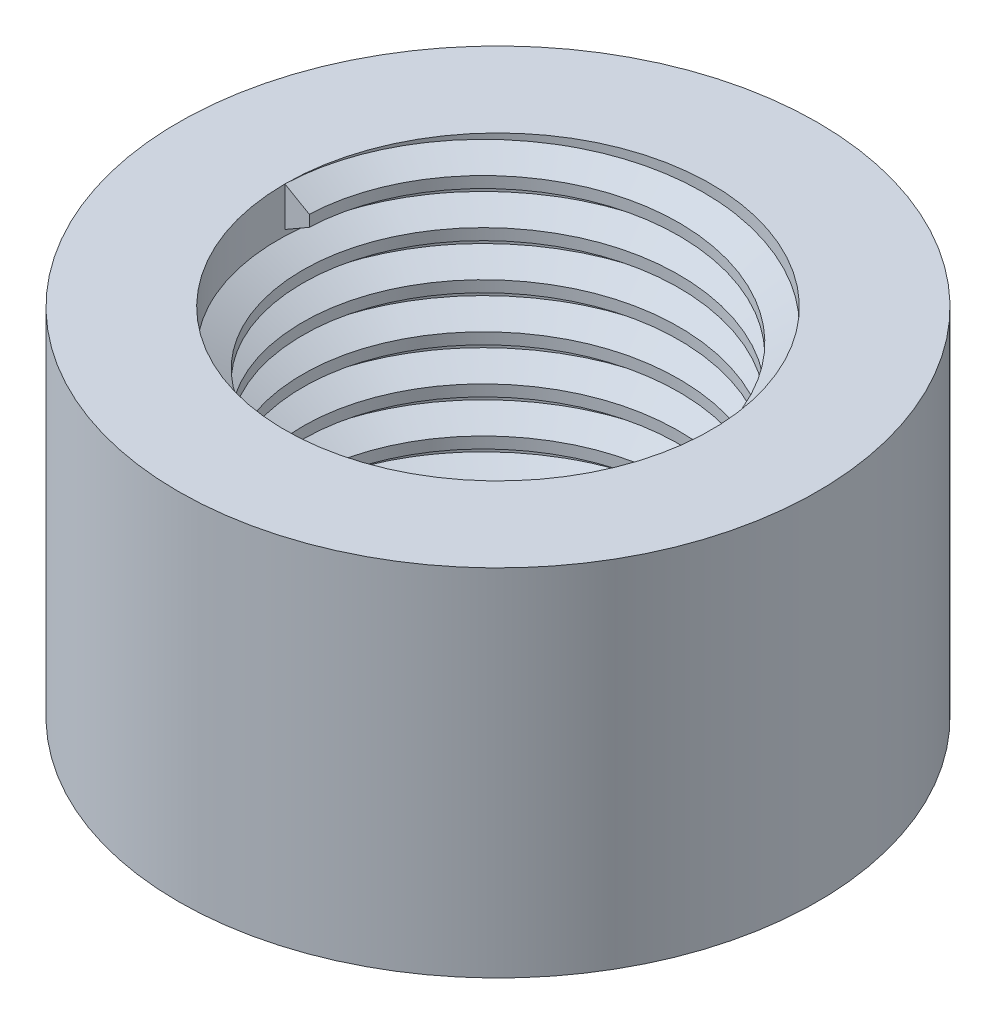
ISO-10303-21;
HEADER;
FILE_DESCRIPTION(('STEP AP214'),'2;1');
FILE_NAME('part.step','',(''),(''),'','','');
FILE_SCHEMA(('AUTOMOTIVE_DESIGN { 1 0 10303 214 1 1 1 1 }'));
ENDSEC;
DATA;
#1=APPLICATION_CONTEXT('core data for automotive mechanical design processes');
#2=APPLICATION_PROTOCOL_DEFINITION('international standard','automotive_design',2000,#1);
#3=PRODUCT_CONTEXT('',#1,'mechanical');
#4=PRODUCT('Part','Part','',(#3));
#5=PRODUCT_RELATED_PRODUCT_CATEGORY('part','',(#4));
#6=PRODUCT_DEFINITION_FORMATION('','',#4);
#7=PRODUCT_DEFINITION_CONTEXT('part definition',#1,'design');
#8=PRODUCT_DEFINITION('design','',#6,#7);
#9=PRODUCT_DEFINITION_SHAPE('','',#8);
#10=(LENGTH_UNIT() NAMED_UNIT(*) SI_UNIT(.MILLI.,.METRE.));
#11=(NAMED_UNIT(*) PLANE_ANGLE_UNIT() SI_UNIT($,.RADIAN.));
#12=(NAMED_UNIT(*) SI_UNIT($,.STERADIAN.) SOLID_ANGLE_UNIT());
#13=UNCERTAINTY_MEASURE_WITH_UNIT(LENGTH_MEASURE(1.E-05),#10,'distance_accuracy_value','');
#14=(GEOMETRIC_REPRESENTATION_CONTEXT(3) GLOBAL_UNCERTAINTY_ASSIGNED_CONTEXT((#13)) GLOBAL_UNIT_ASSIGNED_CONTEXT((#10,
#11,#12)) REPRESENTATION_CONTEXT('',''));
#15=CARTESIAN_POINT('',(0.,0.,0.));
#16=DIRECTION('',(0.,0.,1.));
#17=DIRECTION('',(1.,0.,0.));
#18=AXIS2_PLACEMENT_3D('',#15,#16,#17);
#19=CARTESIAN_POINT('',(0.,2.5,0.));
#20=DIRECTION('',(0.,1.,0.));
#21=DIRECTION('',(0.,0.,1.));
#22=AXIS2_PLACEMENT_3D('',#19,#20,#21);
#23=PLANE('',#22);
#24=CARTESIAN_POINT('',(0.,2.5,0.));
#25=DIRECTION('',(0.,1.,0.));
#26=DIRECTION('',(0.,0.,1.));
#27=AXIS2_PLACEMENT_3D('',#24,#25,#26);
#28=CIRCLE('',#27,2.25);
#29=CARTESIAN_POINT('',(0.,2.5,2.25));
#30=VERTEX_POINT('',#29);
#31=EDGE_CURVE('E12',#30,#30,#28,.T.);
#32=ORIENTED_EDGE('',*,*,#31,.T.);
#33=EDGE_LOOP('',(#32));
#34=FACE_BOUND('',#33,.T.);
#35=CARTESIAN_POINT('',(0.,2.5,0.));
#36=DIRECTION('',(0.,1.,0.));
#37=DIRECTION('',(0.,0.,1.));
#38=AXIS2_PLACEMENT_3D('',#35,#36,#37);
#39=CIRCLE('',#38,1.5);
#40=CARTESIAN_POINT('',(-1.5,2.5,0.));
#41=VERTEX_POINT('',#40);
#42=EDGE_CURVE('E169',#41,#41,#39,.T.);
#43=ORIENTED_EDGE('',*,*,#42,.F.);
#44=EDGE_LOOP('',(#43));
#45=FACE_BOUND('',#44,.T.);
#46=ADVANCED_FACE('F54',(#34,#45),#23,.T.);
#47=CARTESIAN_POINT('',(0.,0.,0.));
#48=DIRECTION('',(0.,1.,0.));
#49=DIRECTION('',(0.,0.,1.));
#50=AXIS2_PLACEMENT_3D('',#47,#48,#49);
#51=PLANE('',#50);
#52=CARTESIAN_POINT('',(0.,0.,0.));
#53=DIRECTION('',(0.,1.,0.));
#54=DIRECTION('',(0.,0.,1.));
#55=AXIS2_PLACEMENT_3D('',#52,#53,#54);
#56=CIRCLE('',#55,2.25);
#57=CARTESIAN_POINT('',(0.,0.,2.25));
#58=VERTEX_POINT('',#57);
#59=EDGE_CURVE('E70',#58,#58,#56,.T.);
#60=ORIENTED_EDGE('',*,*,#59,.F.);
#61=EDGE_LOOP('',(#60));
#62=FACE_BOUND('',#61,.T.);
#63=CARTESIAN_POINT('',(-1.49838807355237,0.,-0.0180885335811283));
#64=CARTESIAN_POINT('',(-1.49869638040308,0.,-0.0133724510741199));
#65=CARTESIAN_POINT('',(-1.49898202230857,0.,-0.00865510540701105));
#66=CARTESIAN_POINT('',(-1.49950797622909,0.,0.000782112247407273));
#67=CARTESIAN_POINT('',(-1.49974828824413,0.,0.00550198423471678));
#68=CARTESIAN_POINT('',(-1.49996593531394,0.,0.0102231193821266));
#69=B_SPLINE_CURVE_WITH_KNOTS('',3,(#63,#64,#65,#66,#67,#68),.UNSPECIFIED.,.F.,.F.,(4,2,4),(0.,
0.0141779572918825,0.028355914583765),.UNSPECIFIED.);
#70=CARTESIAN_POINT('',(-1.49988907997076,-0.0004414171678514,-0.0181867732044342));
#71=VERTEX_POINT('',#70);
#72=CARTESIAN_POINT('',(-1.49996645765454,-4.758296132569E-08,0.0102230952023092));
#73=VERTEX_POINT('',#72);
#74=EDGE_CURVE('E180',#71,#73,#69,.T.);
#75=ORIENTED_EDGE('',*,*,#74,.T.);
#76=CARTESIAN_POINT('',(-1.49997022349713,0.,0.0102407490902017));
#77=CARTESIAN_POINT('',(-1.49986820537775,0.,0.0267039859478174));
#78=CARTESIAN_POINT('',(-1.49950218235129,0.,0.0431658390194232));
#79=CARTESIAN_POINT('',(-1.49823871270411,0.,0.0759899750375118));
#80=CARTESIAN_POINT('',(-1.4973438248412,0.,0.092352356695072));
#81=CARTESIAN_POINT('',(-1.49502271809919,0.,0.124977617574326));
#82=CARTESIAN_POINT('',(-1.49359851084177,0.,0.141240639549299));
#83=CARTESIAN_POINT('',(-1.49021944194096,0.,0.17366710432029));
#84=CARTESIAN_POINT('',(-1.48826602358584,0.,0.189830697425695));
#85=CARTESIAN_POINT('',(-1.48382907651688,0.,0.222058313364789));
#86=CARTESIAN_POINT('',(-1.48134641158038,0.,0.238122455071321));
#87=CARTESIAN_POINT('',(-1.47585156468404,0.,0.27015120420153));
#88=CARTESIAN_POINT('',(-1.47283966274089,0.,0.286115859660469));
#89=CARTESIAN_POINT('',(-1.46628692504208,0.,0.317945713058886));
#90=CARTESIAN_POINT('',(-1.46274578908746,0.,0.333810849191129));
#91=CARTESIAN_POINT('',(-1.45513516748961,0.,0.365441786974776));
#92=CARTESIAN_POINT('',(-1.45106481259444,0.,0.381207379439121));
#93=CARTESIAN_POINT('',(-1.44239630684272,0.,0.412639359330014));
#94=CARTESIAN_POINT('',(-1.43779673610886,0.,0.428305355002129));
#95=CARTESIAN_POINT('',(-1.42807039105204,0.,0.459538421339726));
#96=CARTESIAN_POINT('',(-1.42294167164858,0.,0.475104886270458));
#97=CARTESIAN_POINT('',(-1.41269054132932,0.,0.504604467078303));
#98=CARTESIAN_POINT('',(-1.40761310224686,0.,0.51855323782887));
#99=CARTESIAN_POINT('',(-1.39703097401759,0.,0.546370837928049));
#100=CARTESIAN_POINT('',(-1.39152419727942,0.,0.560238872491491));
#101=CARTESIAN_POINT('',(-1.37889881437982,0.,0.590748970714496));
#102=CARTESIAN_POINT('',(-1.37168678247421,0.,0.607352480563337));
#103=CARTESIAN_POINT('',(-1.35671459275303,0.,0.640202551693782));
#104=CARTESIAN_POINT('',(-1.34895759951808,0.,0.656450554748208));
#105=CARTESIAN_POINT('',(-1.33361424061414,0.,0.687155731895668));
#106=CARTESIAN_POINT('',(-1.32607937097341,0.,0.701638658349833));
#107=CARTESIAN_POINT('',(-1.3105573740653,0.,0.730309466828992));
#108=CARTESIAN_POINT('',(-1.30257152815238,0.,0.744498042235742));
#109=CARTESIAN_POINT('',(-1.28614820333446,0.,0.772580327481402));
#110=CARTESIAN_POINT('',(-1.27771148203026,0.,0.786474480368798));
#111=CARTESIAN_POINT('',(-1.26038690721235,0.,0.813968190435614));
#112=CARTESIAN_POINT('',(-1.25149929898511,0.,0.827567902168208));
#113=CARTESIAN_POINT('',(-1.23327346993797,0.,0.854473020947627));
#114=CARTESIAN_POINT('',(-1.22393500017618,0.,0.867778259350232));
#115=CARTESIAN_POINT('',(-1.2048079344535,0.,0.894094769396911));
#116=CARTESIAN_POINT('',(-1.19501861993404,0.,0.907105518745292));
#117=CARTESIAN_POINT('',(-1.17499034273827,0.,0.932833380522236));
#118=CARTESIAN_POINT('',(-1.16475022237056,0.,0.94554959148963));
#119=CARTESIAN_POINT('',(-1.14382071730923,0.,0.970688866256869));
#120=CARTESIAN_POINT('',(-1.13312977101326,0.,0.983110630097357));
#121=CARTESIAN_POINT('',(-1.11232451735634,0.,1.00650793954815));
#122=CARTESIAN_POINT('',(-1.10224398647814,0.,1.01751356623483));
#123=CARTESIAN_POINT('',(-1.0817142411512,0.,1.03928493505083));
#124=CARTESIAN_POINT('',(-1.07126337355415,0.,1.05004912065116));
#125=CARTESIAN_POINT('',(-1.05847695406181,0.,1.06284500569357));
#126=CARTESIAN_POINT('',(-1.056287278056,0.,1.06502334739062));
#127=CARTESIAN_POINT('',(-1.0540912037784,0.,1.06719516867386));
#128=B_SPLINE_CURVE_WITH_KNOTS('',3,(#76,#77,#78,#79,#80,#81,#82,#83,#84,#85,#86,#87,#88,#89,
#90,#91,#92,#93,#94,#95,#96,#97,#98,#99,#100,#101,#102,#103,#104,#105,#106,#107,#108,#109,#110,
#111,#112,#113,#114,#115,#116,#117,#118,#119,#120,#121,#122,#123,#124,#125,#126,#127),
.UNSPECIFIED.,.F.,.F.,(4,2,2,2,2,2,2,2,2,2,2,2,2,2,2,2,2,2,2,2,2,2,2,2,2,4),(0.,
0.0493889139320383,0.0985408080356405,0.147507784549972,0.196342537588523,0.245098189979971,
0.293828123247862,0.342585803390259,0.39142460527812,0.440397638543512,0.489557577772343,
0.534083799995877,0.578841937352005,0.633137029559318,0.687139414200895,0.736107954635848,
0.784943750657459,0.83369992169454,0.882429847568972,0.931186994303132,0.980024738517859,
1.02899619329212,1.07815403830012,1.12292151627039,1.167923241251,1.17718917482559),.UNSPECIFIED.);
#129=CARTESIAN_POINT('',(-1.05408907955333,0.000133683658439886,1.06719311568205));
#130=VERTEX_POINT('',#129);
#131=EDGE_CURVE('E135',#73,#130,#128,.T.);
#132=ORIENTED_EDGE('',*,*,#131,.T.);
#133=CARTESIAN_POINT('',(-1.49988974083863,0.,-0.0181869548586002));
#134=CARTESIAN_POINT('',(-1.49955654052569,0.000119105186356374,-0.0457353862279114));
#135=CARTESIAN_POINT('',(-1.498462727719,0.000218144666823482,-0.0732746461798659));
#136=CARTESIAN_POINT('',(-1.49473685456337,0.000381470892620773,-0.128607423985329));
#137=CARTESIAN_POINT('',(-1.49208505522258,0.000445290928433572,-0.156399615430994));
#138=CARTESIAN_POINT('',(-1.48519570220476,0.000541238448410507,-0.212110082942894));
#139=CARTESIAN_POINT('',(-1.48094033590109,0.000572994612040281,-0.240026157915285));
#140=CARTESIAN_POINT('',(-1.47081136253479,0.00060834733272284,-0.295848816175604));
#141=CARTESIAN_POINT('',(-1.46492215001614,0.000611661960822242,-0.323752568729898));
#142=CARTESIAN_POINT('',(-1.45150775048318,0.000594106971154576,-0.379409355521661));
#143=CARTESIAN_POINT('',(-1.44396938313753,0.000573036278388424,-0.407159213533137));
#144=CARTESIAN_POINT('',(-1.42725514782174,0.000511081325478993,-0.462363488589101));
#145=CARTESIAN_POINT('',(-1.41806869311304,0.000470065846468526,-0.489814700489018));
#146=CARTESIAN_POINT('',(-1.39807350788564,0.000372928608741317,-0.544275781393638));
#147=CARTESIAN_POINT('',(-1.38725688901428,0.000316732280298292,-0.571282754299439));
#148=CARTESIAN_POINT('',(-1.36403364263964,0.000194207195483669,-0.624710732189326));
#149=CARTESIAN_POINT('',(-1.35162186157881,0.000127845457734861,-0.651129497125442));
#150=CARTESIAN_POINT('',(-1.32525742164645,-9.84922881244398E-06,-0.70324021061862));
#151=CARTESIAN_POINT('',(-1.31130230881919,-8.1190026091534E-05,-0.72893091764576));
#152=CARTESIAN_POINT('',(-1.28191659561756,-0.000223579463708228,-0.779450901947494));
#153=CARTESIAN_POINT('',(-1.26648613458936,-0.000294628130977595,-0.8042802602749));
#154=CARTESIAN_POINT('',(-1.23423034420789,-0.000431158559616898,-0.852951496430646));
#155=CARTESIAN_POINT('',(-1.21740757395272,-0.00049665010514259,-0.876795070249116));
#156=CARTESIAN_POINT('',(-1.18246159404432,-0.000616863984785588,-0.92337936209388));
#157=CARTESIAN_POINT('',(-1.16434312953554,-0.000671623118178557,-0.946123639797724));
#158=CARTESIAN_POINT('',(-1.12691224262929,-0.000765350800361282,-0.990406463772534));
#159=CARTESIAN_POINT('',(-1.10760646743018,-0.000804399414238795,-1.01195062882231));
#160=CARTESIAN_POINT('',(-1.06791746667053,-0.000861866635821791,-1.05374432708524));
#161=CARTESIAN_POINT('',(-1.04754246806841,-0.000880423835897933,-1.07400167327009));
#162=CARTESIAN_POINT('',(-1.00583933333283,-0.000892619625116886,-1.11314789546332));
#163=CARTESIAN_POINT('',(-0.984520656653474,-0.000886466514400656,-1.13204684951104));
#164=CARTESIAN_POINT('',(-0.941059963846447,-0.000844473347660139,-1.16841818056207));
#165=CARTESIAN_POINT('',(-0.918928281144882,-0.000808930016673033,-1.18590290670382));
#166=CARTESIAN_POINT('',(-0.873974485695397,-0.000706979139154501,-1.21940367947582));
#167=CARTESIAN_POINT('',(-0.851163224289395,-0.000640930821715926,-1.23543428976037));
#168=CARTESIAN_POINT('',(-0.804984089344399,-0.000465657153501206,-1.26600053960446));
#169=CARTESIAN_POINT('',(-0.781627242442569,-0.000357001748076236,-1.28055284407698));
#170=CARTESIAN_POINT('',(-0.734217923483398,-0.000125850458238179,-1.3083105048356));
#171=CARTESIAN_POINT('',(-0.710167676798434,-3.3958274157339E-06,-1.32151966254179));
#172=CARTESIAN_POINT('',(-0.661055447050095,0.000191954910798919,-1.34676579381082));
#173=CARTESIAN_POINT('',(-0.635984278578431,0.000264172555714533,-1.35878490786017));
#174=CARTESIAN_POINT('',(-0.584909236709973,0.000379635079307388,-1.38154703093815));
#175=CARTESIAN_POINT('',(-0.558897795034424,0.000422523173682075,-1.39227306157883));
#176=CARTESIAN_POINT('',(-0.506038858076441,0.000477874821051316,-1.41234990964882));
#177=CARTESIAN_POINT('',(-0.479185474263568,0.000490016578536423,-1.42168522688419));
#178=CARTESIAN_POINT('',(-0.424752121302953,0.000489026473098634,-1.43889109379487));
#179=CARTESIAN_POINT('',(-0.397167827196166,0.000475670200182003,-1.44674796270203));
#180=CARTESIAN_POINT('',(-0.341393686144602,0.000427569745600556,-1.46091896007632));
#181=CARTESIAN_POINT('',(-0.313200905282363,0.000392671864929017,-1.4672215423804));
#182=CARTESIAN_POINT('',(-0.256340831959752,0.000306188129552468,-1.47821938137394));
#183=CARTESIAN_POINT('',(-0.227671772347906,0.000254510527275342,-1.48290550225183));
#184=CARTESIAN_POINT('',(-0.169998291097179,0.000139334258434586,-1.49062077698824));
#185=CARTESIAN_POINT('',(-0.140992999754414,7.57904945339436E-05,-1.49364342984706));
#186=CARTESIAN_POINT('',(-0.0827921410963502,-5.80028858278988E-05,-1.49799829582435));
#187=CARTESIAN_POINT('',(-0.0535962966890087,-0.000128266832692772,-1.4993268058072));
#188=CARTESIAN_POINT('',(0.0048370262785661,-0.000270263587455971,-1.50027692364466));
#189=CARTESIAN_POINT('',(0.0340745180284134,-0.000341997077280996,-1.49989772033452));
#190=CARTESIAN_POINT('',(0.0924414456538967,-0.000481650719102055,-1.49743337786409));
#191=CARTESIAN_POINT('',(0.121570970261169,-0.000549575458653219,-1.49535034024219));
#192=CARTESIAN_POINT('',(0.179573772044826,-0.00067637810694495,-1.48949669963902));
#193=CARTESIAN_POINT('',(0.20844754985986,-0.000735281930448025,-1.48573105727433));
#194=CARTESIAN_POINT('',(0.265794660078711,-0.000838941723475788,-1.47654751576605));
#195=CARTESIAN_POINT('',(0.294269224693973,-0.000883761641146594,-1.47113731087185));
#196=CARTESIAN_POINT('',(0.350680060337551,-0.000954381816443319,-1.45871600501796));
#197=CARTESIAN_POINT('',(0.378618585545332,-0.000980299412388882,-1.4517151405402));
#198=CARTESIAN_POINT('',(0.433827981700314,-0.00100849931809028,-1.43617866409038));
#199=CARTESIAN_POINT('',(0.461102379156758,-0.0010109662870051,-1.42765558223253));
#200=CARTESIAN_POINT('',(0.514864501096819,-0.000988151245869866,-1.40915402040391));
#201=CARTESIAN_POINT('',(0.541357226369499,-0.000963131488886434,-1.39919006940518));
#202=CARTESIAN_POINT('',(0.593448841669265,-0.000881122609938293,-1.37789748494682));
#203=CARTESIAN_POINT('',(0.619054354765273,-0.000824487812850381,-1.36658505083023));
#204=CARTESIAN_POINT('',(0.669277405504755,-0.000677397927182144,-1.3426955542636));
#205=CARTESIAN_POINT('',(0.693903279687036,-0.000587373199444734,-1.33013601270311));
#206=CARTESIAN_POINT('',(0.742194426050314,-0.000364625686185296,-1.30380085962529));
#207=CARTESIAN_POINT('',(0.765866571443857,-0.000232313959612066,-1.29003784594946));
#208=CARTESIAN_POINT('',(0.812678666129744,-1.46320962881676E-05,-1.26107858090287));
#209=CARTESIAN_POINT('',(0.83580989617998,7.02056374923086E-05,-1.24586822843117));
#210=CARTESIAN_POINT('',(0.881478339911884,0.000208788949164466,-1.21399380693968));
#211=CARTESIAN_POINT('',(0.904004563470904,0.000262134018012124,-1.19731398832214));
#212=CARTESIAN_POINT('',(0.948328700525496,0.000337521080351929,-1.16252956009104));
#213=CARTESIAN_POINT('',(0.970115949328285,0.000359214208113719,-1.14441135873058));
#214=CARTESIAN_POINT('',(1.01282895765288,0.000375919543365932,-1.10679488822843));
#215=CARTESIAN_POINT('',(1.03374472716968,0.00037067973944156,-1.08728527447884));
#216=CARTESIAN_POINT('',(1.0745850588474,0.000337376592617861,-1.04694656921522));
#217=CARTESIAN_POINT('',(1.09450066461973,0.000309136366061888,-1.02610840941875));
#218=CARTESIAN_POINT('',(1.13321675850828,0.000234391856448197,-0.983188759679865));
#219=CARTESIAN_POINT('',(1.152009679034,0.000187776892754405,-0.961100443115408));
#220=CARTESIAN_POINT('',(1.18836462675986,8.10684448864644E-05,-0.915771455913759));
#221=CARTESIAN_POINT('',(1.20592081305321,2.09159858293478E-05,-0.892526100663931));
#222=CARTESIAN_POINT('',(1.23969685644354,-0.000107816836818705,-0.844987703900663));
#223=CARTESIAN_POINT('',(1.25591290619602,-0.000176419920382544,-0.820691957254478));
#224=CARTESIAN_POINT('',(1.28691558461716,-0.000316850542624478,-0.771169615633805));
#225=CARTESIAN_POINT('',(1.30170070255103,-0.000388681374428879,-0.745942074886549));
#226=CARTESIAN_POINT('',(1.32976249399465,-0.000530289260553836,-0.69468329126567));
#227=CARTESIAN_POINT('',(1.3430401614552,-0.000600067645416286,-0.668652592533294));
#228=CARTESIAN_POINT('',(1.36802347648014,-0.000732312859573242,-0.615922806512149));
#229=CARTESIAN_POINT('',(1.37973276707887,-0.000794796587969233,-0.589225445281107));
#230=CARTESIAN_POINT('',(1.40153218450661,-0.000907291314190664,-0.535303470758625));
#231=CARTESIAN_POINT('',(1.41162867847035,-0.000957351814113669,-0.508081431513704));
#232=CARTESIAN_POINT('',(1.43017234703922,-0.00104006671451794,-0.453254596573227));
#233=CARTESIAN_POINT('',(1.43862861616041,-0.00107281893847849,-0.425652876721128));
#234=CARTESIAN_POINT('',(1.45387878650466,-0.00111612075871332,-0.370212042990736));
#235=CARTESIAN_POINT('',(1.46068444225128,-0.00112683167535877,-0.342376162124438));
#236=CARTESIAN_POINT('',(1.47263713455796,-0.00112208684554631,-0.286610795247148));
#237=CARTESIAN_POINT('',(1.47779845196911,-0.00110686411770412,-0.258684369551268));
#238=CARTESIAN_POINT('',(1.48648230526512,-0.00104487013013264,-0.202877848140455));
#239=CARTESIAN_POINT('',(1.49002145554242,-0.000998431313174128,-0.175000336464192));
#240=CARTESIAN_POINT('',(1.49549583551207,-0.000875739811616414,-0.119425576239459));
#241=CARTESIAN_POINT('',(1.49744977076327,-0.000799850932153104,-0.0917301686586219));
#242=CARTESIAN_POINT('',(1.49980309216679,-0.000595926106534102,-0.0366263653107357));
#243=CARTESIAN_POINT('',(1.50022192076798,-0.0004685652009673,-0.00921879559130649));
#244=CARTESIAN_POINT('',(1.49955591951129,-0.000239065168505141,0.0457281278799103));
#245=CARTESIAN_POINT('',(1.498462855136,-0.000137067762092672,0.0732673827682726));
#246=CARTESIAN_POINT('',(1.49473771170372,2.84606468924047E-05,0.128600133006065));
#247=CARTESIAN_POINT('',(1.49208588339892,9.14763412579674E-05,0.156392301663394));
#248=CARTESIAN_POINT('',(1.48519668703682,0.000186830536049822,0.212102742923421));
#249=CARTESIAN_POINT('',(1.48094150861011,0.000218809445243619,0.240018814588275));
#250=CARTESIAN_POINT('',(1.47081285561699,0.000254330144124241,0.295841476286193));
#251=CARTESIAN_POINT('',(1.46492377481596,0.000257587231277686,0.323745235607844));
#252=CARTESIAN_POINT('',(1.45150965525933,0.000239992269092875,0.379402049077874));
#253=CARTESIAN_POINT('',(1.4439714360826,0.000218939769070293,0.40715192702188));
#254=CARTESIAN_POINT('',(1.42725749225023,0.000157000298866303,0.462356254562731));
#255=CARTESIAN_POINT('',(1.41807118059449,0.000115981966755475,0.489807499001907));
#256=CARTESIAN_POINT('',(1.39807628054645,1.88441540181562E-05,0.544268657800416));
#257=CARTESIAN_POINT('',(1.38725980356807,-3.73498727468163E-05,0.57127567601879));
#258=CARTESIAN_POINT('',(1.36403683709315,-0.000159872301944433,0.624703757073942));
#259=CARTESIAN_POINT('',(1.35162519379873,-0.000226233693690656,0.65112257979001));
#260=CARTESIAN_POINT('',(1.32526102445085,-0.000363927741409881,0.70323342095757));
#261=CARTESIAN_POINT('',(1.31130604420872,-0.000435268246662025,0.728924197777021));
#262=CARTESIAN_POINT('',(1.28192058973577,-0.000577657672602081,0.779444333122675));
#263=CARTESIAN_POINT('',(1.26649025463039,-0.000648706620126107,0.804273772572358));
#264=CARTESIAN_POINT('',(1.23423470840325,-0.000785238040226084,0.85294518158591));
#265=CARTESIAN_POINT('',(1.21741205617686,-0.000850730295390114,0.876788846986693));
#266=CARTESIAN_POINT('',(1.18246630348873,-0.000970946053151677,0.923373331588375));
#267=CARTESIAN_POINT('',(1.16434794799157,-0.00102570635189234,0.946117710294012));
#268=CARTESIAN_POINT('',(1.12691726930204,-0.00111943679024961,0.990400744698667));
#269=CARTESIAN_POINT('',(1.10761159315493,-0.00115848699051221,1.01194501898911));
#270=CARTESIAN_POINT('',(1.0679227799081,-0.00121595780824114,1.0537389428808));
#271=CARTESIAN_POINT('',(1.04754786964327,-0.00123451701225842,1.07399640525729));
#272=CARTESIAN_POINT('',(1.00584490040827,-0.00124671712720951,1.11314286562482));
#273=CARTESIAN_POINT('',(0.984526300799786,-0.00124056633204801,1.1320419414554));
#274=CARTESIAN_POINT('',(0.941065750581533,-0.00119857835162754,1.16841352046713));
#275=CARTESIAN_POINT('',(0.918934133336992,-0.00116303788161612,1.18589837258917));
#276=CARTESIAN_POINT('',(0.873980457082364,-0.00106109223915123,1.2193994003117));
#277=CARTESIAN_POINT('',(0.851169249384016,-0.000995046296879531,1.23543013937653));
#278=CARTESIAN_POINT('',(0.804990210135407,-0.000819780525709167,1.2659966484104));
#279=CARTESIAN_POINT('',(0.781633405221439,-0.000711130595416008,1.28054908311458));
#280=CARTESIAN_POINT('',(0.734224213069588,-0.000479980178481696,1.30830697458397));
#281=CARTESIAN_POINT('',(0.710174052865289,-0.000357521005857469,1.32151623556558));
#282=CARTESIAN_POINT('',(0.661061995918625,-0.000162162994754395,1.346762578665));
#283=CARTESIAN_POINT('',(0.635990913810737,-8.99426350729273E-05,1.35878180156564));
#284=CARTESIAN_POINT('',(0.584916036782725,2.55254596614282E-05,1.38154415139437));
#285=CARTESIAN_POINT('',(0.558904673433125,6.84164076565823E-05,1.39227029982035));
#286=CARTESIAN_POINT('',(0.506045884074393,0.000123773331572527,1.41234739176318));
#287=CARTESIAN_POINT('',(0.479192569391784,0.000135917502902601,1.42168283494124));
#288=CARTESIAN_POINT('',(0.424759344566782,0.000134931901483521,1.43888896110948));
#289=CARTESIAN_POINT('',(0.397175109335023,0.000121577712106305,1.44674596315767));
#290=CARTESIAN_POINT('',(0.34140107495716,7.34810273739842E-05,1.46091723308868));
#291=CARTESIAN_POINT('',(0.313208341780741,3.85848269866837E-05,1.46721995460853));
#292=CARTESIAN_POINT('',(0.256348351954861,-4.78959628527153E-05,1.47821807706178));
#293=CARTESIAN_POINT('',(0.227679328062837,-9.95723046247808E-05,1.48290434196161));
#294=CARTESIAN_POINT('',(0.170005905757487,-0.000214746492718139,1.49061990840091));
#295=CARTESIAN_POINT('',(0.141000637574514,-0.000278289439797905,1.49364270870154));
#296=CARTESIAN_POINT('',(0.0827998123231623,-0.000412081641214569,1.49799787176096));
#297=CARTESIAN_POINT('',(0.0536039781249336,-0.000482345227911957,1.49932653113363));
#298=CARTESIAN_POINT('',(-0.00482933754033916,-0.000624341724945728,1.50027694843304));
#299=CARTESIAN_POINT('',(-0.0340668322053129,-0.000696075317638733,1.49989789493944));
#300=CARTESIAN_POINT('',(-0.0924337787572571,-0.000835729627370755,1.49743385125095));
#301=CARTESIAN_POINT('',(-0.12156331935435,-0.000903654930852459,1.49535096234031));
#302=CARTESIAN_POINT('',(-0.179566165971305,-0.00103045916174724,1.48949761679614));
#303=CARTESIAN_POINT('',(-0.208439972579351,-0.00108936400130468,1.48573212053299));
#304=CARTESIAN_POINT('',(-0.265787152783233,-0.00119302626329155,1.47654886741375));
#305=CARTESIAN_POINT('',(-0.294261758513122,-0.00123784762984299,1.47113880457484));
#306=CARTESIAN_POINT('',(-0.350672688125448,-0.00130847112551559,1.45871777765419));
#307=CARTESIAN_POINT('',(-0.378611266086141,-0.00133439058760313,1.45171704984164));
#308=CARTESIAN_POINT('',(-0.433820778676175,-0.0013625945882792,1.4361808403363));
#309=CARTESIAN_POINT('',(-0.46109523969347,-0.00136506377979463,1.4276578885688));
#310=CARTESIAN_POINT('',(-0.514857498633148,-0.00134225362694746,1.40915657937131));
#311=CARTESIAN_POINT('',(-0.541350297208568,-0.00131723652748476,1.39919275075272));
#312=CARTESIAN_POINT('',(-0.593442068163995,-0.00123523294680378,1.37790040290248));
#313=CARTESIAN_POINT('',(-0.619047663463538,-0.00117860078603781,1.36658808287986));
#314=CARTESIAN_POINT('',(-0.669270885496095,-0.00103151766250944,1.34269880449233));
#315=CARTESIAN_POINT('',(-0.693896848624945,-0.000941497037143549,1.33013936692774));
#316=CARTESIAN_POINT('',(-0.742188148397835,-0.000718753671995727,1.30380443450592));
#317=CARTESIAN_POINT('',(-0.765860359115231,-0.000586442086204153,1.29004153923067));
#318=CARTESIAN_POINT('',(-0.812672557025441,-0.000368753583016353,1.26108251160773));
#319=CARTESIAN_POINT('',(-0.835803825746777,-0.000283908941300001,1.24587227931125));
#320=CARTESIAN_POINT('',(-0.881472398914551,-0.000145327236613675,1.21399814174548));
#321=CARTESIAN_POINT('',(-0.903998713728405,-9.19908802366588E-05,1.19731848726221));
#322=CARTESIAN_POINT('',(-0.948322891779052,-1.65674225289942E-05,1.16253421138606));
#323=CARTESIAN_POINT('',(-0.970110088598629,5.17139856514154E-06,1.14441599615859));
#324=CARTESIAN_POINT('',(-1.01282358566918,2.176351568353E-05,1.1068001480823));
#325=CARTESIAN_POINT('',(-1.03373990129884,1.63628745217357E-05,1.08729117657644));
#326=CARTESIAN_POINT('',(-1.0540805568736,0.,1.06719922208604));
#327=B_SPLINE_CURVE_WITH_KNOTS('',3,(#133,#134,#135,#136,#137,#138,#139,#140,#141,#142,#143,
#144,#145,#146,#147,#148,#149,#150,#151,#152,#153,#154,#155,#156,#157,#158,#159,#160,#161,#162,
#163,#164,#165,#166,#167,#168,#169,#170,#171,#172,#173,#174,#175,#176,#177,#178,#179,#180,#181,
#182,#183,#184,#185,#186,#187,#188,#189,#190,#191,#192,#193,#194,#195,#196,#197,#198,#199,#200,
#201,#202,#203,#204,#205,#206,#207,#208,#209,#210,#211,#212,#213,#214,#215,#216,#217,#218,#219,
#220,#221,#222,#223,#224,#225,#226,#227,#228,#229,#230,#231,#232,#233,#234,#235,#236,#237,#238,
#239,#240,#241,#242,#243,#244,#245,#246,#247,#248,#249,#250,#251,#252,#253,#254,#255,#256,#257,
#258,#259,#260,#261,#262,#263,#264,#265,#266,#267,#268,#269,#270,#271,#272,#273,#274,#275,#276,
#277,#278,#279,#280,#281,#282,#283,#284,#285,#286,#287,#288,#289,#290,#291,#292,#293,#294,#295,
#296,#297,#298,#299,#300,#301,#302,#303,#304,#305,#306,#307,#308,#309,#310,#311,#312,#313,#314,
#315,#316,#317,#318,#319,#320,#321,#322,#323,#324,#325,#326),.UNSPECIFIED.,.F.,.F.,(4,2,2,2,2,2,
2,2,2,2,2,2,2,2,2,2,2,2,2,2,2,2,2,2,2,2,2,2,2,2,2,2,2,2,2,2,2,2,2,2,2,2,2,2,2,2,2,2,2,2,2,2,2,2,
2,2,2,2,2,2,2,2,2,2,2,2,2,2,2,2,2,2,2,2,2,2,2,2,2,2,2,2,2,2,2,2,2,2,2,2,2,2,2,2,2,2,4),(0.,
0.082641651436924,0.166353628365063,0.251024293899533,0.336533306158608,0.422752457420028,
0.509546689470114,0.596775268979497,0.684293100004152,0.771952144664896,0.859602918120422,
0.947096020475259,1.03428366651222,1.12102117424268,1.20716837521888,1.29259091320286,
1.37716140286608,1.46076042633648,1.54327735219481,1.62555382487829,1.70892094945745,
1.79328498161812,1.87852839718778,1.96452550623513,2.05114341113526,2.13824313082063,
2.22568087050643,2.3133094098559,2.40097957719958,2.48854177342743,2.57584750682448,
2.66275089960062,2.74911012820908,2.83478876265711,2.91965697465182,3.00359259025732,
3.08648196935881,3.16858893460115,3.25159913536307,3.33564346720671,3.42060731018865,
3.50636759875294,3.59279372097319,3.67974858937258,3.76708986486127,3.85467130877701,
3.94234423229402,4.02995900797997,4.11736660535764,4.20442011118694,4.29097619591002,
4.37689649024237,4.46204884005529,4.5463084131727,4.62955863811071,4.71175076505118,
4.79439231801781,4.87810420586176,4.9627747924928,5.04828373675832,5.13450283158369,
5.22129701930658,5.30852556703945,5.39604337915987,5.48370241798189,5.57135319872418,
5.65884632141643,5.74603400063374,5.83277155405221,5.91891881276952,6.00434141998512,
6.08891198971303,6.17251110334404,6.25502812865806,6.33730452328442,6.42067155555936,
6.50503550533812,6.59027884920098,6.67627589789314,6.76289375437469,6.84999343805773,
6.93743115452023,7.02505968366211,7.11272985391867,7.20029206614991,7.28759782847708,
7.37450126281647,7.46086054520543,7.54653924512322,7.63140753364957,7.71534323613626,
7.79823271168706,7.88033966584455,7.96334977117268,8.04739401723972,8.13235778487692,
8.21811800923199),.UNSPECIFIED.);
#328=EDGE_CURVE('E179',#130,#71,#327,.F.);
#329=ORIENTED_EDGE('',*,*,#328,.T.);
#330=EDGE_LOOP('',(#75,#132,#329));
#331=FACE_BOUND('',#330,.T.);
#332=ADVANCED_FACE('F177',(#62,#331),#51,.F.);
#333=CARTESIAN_POINT('',(0.,2.5,0.));
#334=DIRECTION('',(0.,-1.,0.));
#335=DIRECTION('',(0.,0.,-1.));
#336=AXIS2_PLACEMENT_3D('',#333,#334,#335);
#337=CYLINDRICAL_SURFACE('',#336,2.25);
#338=ORIENTED_EDGE('',*,*,#31,.F.);
#339=EDGE_LOOP('',(#338));
#340=FACE_BOUND('',#339,.T.);
#341=ORIENTED_EDGE('',*,*,#59,.T.);
#342=EDGE_LOOP('',(#341));
#343=FACE_BOUND('',#342,.T.);
#344=ADVANCED_FACE('F56',(#340,#343),#337,.T.);
#345=CARTESIAN_POINT('',(0.,2.5,0.));
#346=DIRECTION('',(0.,-1.,0.));
#347=DIRECTION('',(0.,0.,-1.));
#348=AXIS2_PLACEMENT_3D('',#345,#346,#347);
#349=CYLINDRICAL_SURFACE('',#348,1.5);
#350=CARTESIAN_POINT('',(-1.5,2.22218750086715,0.));
#351=CARTESIAN_POINT('',(-1.5,2.19572916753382,-0.866025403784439));
#352=CARTESIAN_POINT('',(-0.75,2.16927083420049,-1.29903810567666));
#353=CARTESIAN_POINT('',(0.,2.14281250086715,-1.73205080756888));
#354=CARTESIAN_POINT('',(0.75,2.11635416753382,-1.29903810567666));
#355=CARTESIAN_POINT('',(1.5,2.08989583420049,-0.866025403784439));
#356=CARTESIAN_POINT('',(1.5,2.06343750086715,0.));
#357=CARTESIAN_POINT('',(1.5,2.03697916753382,0.866025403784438));
#358=CARTESIAN_POINT('',(0.750000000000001,2.01052083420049,1.29903810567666));
#359=CARTESIAN_POINT('',(0.,1.98406250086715,1.73205080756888));
#360=CARTESIAN_POINT('',(-0.749999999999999,1.95760416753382,1.29903810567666));
#361=CARTESIAN_POINT('',(-1.5,1.93114583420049,0.86602540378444));
#362=CARTESIAN_POINT('',(-1.5,1.90468750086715,0.));
#363=CARTESIAN_POINT('',(-1.5,1.87822916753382,-0.866025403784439));
#364=CARTESIAN_POINT('',(-0.75,1.85177083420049,-1.29903810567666));
#365=CARTESIAN_POINT('',(0.,1.82531250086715,-1.73205080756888));
#366=CARTESIAN_POINT('',(0.75,1.79885416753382,-1.29903810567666));
#367=CARTESIAN_POINT('',(1.5,1.77239583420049,-0.866025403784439));
#368=CARTESIAN_POINT('',(1.5,1.74593750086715,0.));
#369=CARTESIAN_POINT('',(1.5,1.71947916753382,0.866025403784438));
#370=CARTESIAN_POINT('',(0.750000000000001,1.69302083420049,1.29903810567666));
#371=CARTESIAN_POINT('',(0.,1.66656250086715,1.73205080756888));
#372=CARTESIAN_POINT('',(-0.749999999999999,1.64010416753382,1.29903810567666));
#373=CARTESIAN_POINT('',(-1.5,1.61364583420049,0.86602540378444));
#374=CARTESIAN_POINT('',(-1.5,1.58718750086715,0.));
#375=CARTESIAN_POINT('',(-1.5,1.56072916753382,-0.866025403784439));
#376=CARTESIAN_POINT('',(-0.75,1.53427083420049,-1.29903810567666));
#377=CARTESIAN_POINT('',(0.,1.50781250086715,-1.73205080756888));
#378=CARTESIAN_POINT('',(0.75,1.48135416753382,-1.29903810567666));
#379=CARTESIAN_POINT('',(1.5,1.45489583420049,-0.866025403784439));
#380=CARTESIAN_POINT('',(1.5,1.42843750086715,0.));
#381=CARTESIAN_POINT('',(1.5,1.40197916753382,0.866025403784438));
#382=CARTESIAN_POINT('',(0.750000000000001,1.37552083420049,1.29903810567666));
#383=CARTESIAN_POINT('',(0.,1.34906250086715,1.73205080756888));
#384=CARTESIAN_POINT('',(-0.749999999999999,1.32260416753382,1.29903810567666));
#385=CARTESIAN_POINT('',(-1.5,1.29614583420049,0.86602540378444));
#386=CARTESIAN_POINT('',(-1.5,1.26968750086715,0.));
#387=CARTESIAN_POINT('',(-1.5,1.24322916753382,-0.866025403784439));
#388=CARTESIAN_POINT('',(-0.75,1.21677083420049,-1.29903810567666));
#389=CARTESIAN_POINT('',(0.,1.19031250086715,-1.73205080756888));
#390=CARTESIAN_POINT('',(0.75,1.16385416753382,-1.29903810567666));
#391=CARTESIAN_POINT('',(1.5,1.13739583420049,-0.866025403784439));
#392=CARTESIAN_POINT('',(1.5,1.11093750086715,0.));
#393=CARTESIAN_POINT('',(1.5,1.08447916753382,0.866025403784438));
#394=CARTESIAN_POINT('',(0.750000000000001,1.05802083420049,1.29903810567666));
#395=CARTESIAN_POINT('',(0.,1.03156250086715,1.73205080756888));
#396=CARTESIAN_POINT('',(-0.749999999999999,1.00510416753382,1.29903810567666));
#397=CARTESIAN_POINT('',(-1.5,0.978645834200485,0.86602540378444));
#398=CARTESIAN_POINT('',(-1.5,0.952187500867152,0.));
#399=CARTESIAN_POINT('',(-1.5,0.925729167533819,-0.866025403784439));
#400=CARTESIAN_POINT('',(-0.75,0.899270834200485,-1.29903810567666));
#401=CARTESIAN_POINT('',(0.,0.872812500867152,-1.73205080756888));
#402=CARTESIAN_POINT('',(0.75,0.846354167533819,-1.29903810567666));
#403=CARTESIAN_POINT('',(1.5,0.819895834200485,-0.866025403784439));
#404=CARTESIAN_POINT('',(1.5,0.793437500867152,0.));
#405=CARTESIAN_POINT('',(1.5,0.766979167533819,0.866025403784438));
#406=CARTESIAN_POINT('',(0.750000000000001,0.740520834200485,1.29903810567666));
#407=CARTESIAN_POINT('',(0.,0.714062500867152,1.73205080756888));
#408=CARTESIAN_POINT('',(-0.749999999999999,0.687604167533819,1.29903810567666));
#409=CARTESIAN_POINT('',(-1.5,0.661145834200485,0.86602540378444));
#410=CARTESIAN_POINT('',(-1.5,0.634687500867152,0.));
#411=CARTESIAN_POINT('',(-1.5,0.608229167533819,-0.866025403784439));
#412=CARTESIAN_POINT('',(-0.75,0.581770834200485,-1.29903810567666));
#413=CARTESIAN_POINT('',(0.,0.555312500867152,-1.73205080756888));
#414=CARTESIAN_POINT('',(0.75,0.528854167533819,-1.29903810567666));
#415=CARTESIAN_POINT('',(1.5,0.502395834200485,-0.866025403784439));
#416=CARTESIAN_POINT('',(1.5,0.475937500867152,0.));
#417=CARTESIAN_POINT('',(1.5,0.449479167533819,0.866025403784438));
#418=CARTESIAN_POINT('',(0.750000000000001,0.423020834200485,1.29903810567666));
#419=CARTESIAN_POINT('',(0.,0.396562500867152,1.73205080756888));
#420=CARTESIAN_POINT('',(-0.749999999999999,0.370104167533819,1.29903810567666));
#421=CARTESIAN_POINT('',(-1.5,0.343645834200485,0.86602540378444));
#422=CARTESIAN_POINT('',(-1.5,0.317187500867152,0.));
#423=CARTESIAN_POINT('',(-1.5,0.290729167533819,-0.866025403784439));
#424=CARTESIAN_POINT('',(-0.75,0.264270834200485,-1.29903810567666));
#425=CARTESIAN_POINT('',(0.,0.237812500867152,-1.73205080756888));
#426=CARTESIAN_POINT('',(0.75,0.211354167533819,-1.29903810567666));
#427=CARTESIAN_POINT('',(1.5,0.184895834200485,-0.866025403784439));
#428=CARTESIAN_POINT('',(1.5,0.158437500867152,0.));
#429=CARTESIAN_POINT('',(1.5,0.131979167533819,0.866025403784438));
#430=CARTESIAN_POINT('',(0.750000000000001,0.105520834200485,1.29903810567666));
#431=CARTESIAN_POINT('',(0.,0.079062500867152,1.73205080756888));
#432=CARTESIAN_POINT('',(-0.749999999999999,0.0526041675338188,1.29903810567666));
#433=CARTESIAN_POINT('',(-1.5,0.0261458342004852,0.86602540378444));
#434=CARTESIAN_POINT('',(-1.5,-0.000312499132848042,0.));
#435=CARTESIAN_POINT('',(-1.5,-0.0267708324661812,-0.866025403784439));
#436=CARTESIAN_POINT('',(-0.75,-0.0532291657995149,-1.29903810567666));
#437=CARTESIAN_POINT('',(0.,-0.0796874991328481,-1.73205080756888));
#438=CARTESIAN_POINT('',(0.75,-0.106145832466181,-1.29903810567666));
#439=CARTESIAN_POINT('',(1.5,-0.132604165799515,-0.866025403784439));
#440=CARTESIAN_POINT('',(1.5,-0.159062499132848,0.));
#441=CARTESIAN_POINT('',(1.5,-0.185520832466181,0.866025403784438));
#442=CARTESIAN_POINT('',(0.750000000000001,-0.211979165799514,1.29903810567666));
#443=CARTESIAN_POINT('',(0.,-0.238437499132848,1.73205080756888));
#444=CARTESIAN_POINT('',(-0.749999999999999,-0.264895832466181,1.29903810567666));
#445=CARTESIAN_POINT('',(-0.916943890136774,-0.270785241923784,1.20265300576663));
#446=CARTESIAN_POINT('',(-1.05409191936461,-0.27734303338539,1.06718799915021));
#447=(BOUNDED_CURVE() B_SPLINE_CURVE(2,(#350,#351,#352,#353,#354,#355,#356,#357,#358,#359,#360,
#361,#362,#363,#364,#365,#366,#367,#368,#369,#370,#371,#372,#373,#374,#375,#376,#377,#378,#379,
#380,#381,#382,#383,#384,#385,#386,#387,#388,#389,#390,#391,#392,#393,#394,#395,#396,#397,#398,
#399,#400,#401,#402,#403,#404,#405,#406,#407,#408,#409,#410,#411,#412,#413,#414,#415,#416,#417,
#418,#419,#420,#421,#422,#423,#424,#425,#426,#427,#428,#429,#430,#431,#432,#433,#434,#435,#436,
#437,#438,#439,#440,#441,#442,#443,#444,#445,#446),.UNSPECIFIED.,.F.,
.F.) B_SPLINE_CURVE_WITH_KNOTS((3,2,2,2,2,2,2,2,2,2,2,2,2,2,2,2,2,2,2,2,2,2,2,2,2,2,2,2,2,2,2,2,
2,2,2,2,2,2,2,2,2,2,2,2,2,2,2,2,3),(0.,0.0208333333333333,0.0416666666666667,0.0625,
0.0833333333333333,0.104166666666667,0.125,0.145833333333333,0.166666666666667,0.1875,
0.208333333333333,0.229166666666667,0.25,0.270833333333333,0.291666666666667,0.3125,
0.333333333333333,0.354166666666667,0.375,0.395833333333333,0.416666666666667,0.4375,
0.458333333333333,0.479166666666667,0.5,0.520833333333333,0.541666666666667,0.5625,
0.583333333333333,0.604166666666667,0.625,0.645833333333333,0.666666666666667,0.6875,
0.708333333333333,0.729166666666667,0.75,0.770833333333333,0.791666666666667,0.8125,
0.833333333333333,0.854166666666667,0.875,0.895833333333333,0.916666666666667,0.9375,
0.958333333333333,0.979166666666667,0.984343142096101),
.UNSPECIFIED.) CURVE() GEOMETRIC_REPRESENTATION_ITEM() RATIONAL_B_SPLINE_CURVE((1.,
0.866025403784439,1.,0.866025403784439,1.,0.866025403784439,1.,0.866025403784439,1.,
0.866025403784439,1.,0.866025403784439,1.,0.866025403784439,1.,0.866025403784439,1.,
0.866025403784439,1.,0.866025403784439,1.,0.866025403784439,1.,0.866025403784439,1.,
0.866025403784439,1.,0.866025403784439,1.,0.866025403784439,1.,0.866025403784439,1.,
0.866025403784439,1.,0.866025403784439,1.,0.866025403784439,1.,0.866025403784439,1.,
0.866025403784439,1.,0.866025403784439,1.,0.866025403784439,1.,0.866025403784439,1.,
0.866025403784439,1.,0.866025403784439,1.,0.866025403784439,1.,0.866025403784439,1.,
0.866025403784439,1.,0.866025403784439,1.,0.866025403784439,1.,0.866025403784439,1.,
0.866025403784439,1.,0.866025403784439,1.,0.866025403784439,1.,0.866025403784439,1.,
0.866025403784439,1.,0.866025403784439,1.,0.866025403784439,1.,0.866025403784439,1.,
0.866025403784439,1.,0.866025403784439,1.,0.866025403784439,1.,0.866025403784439,1.,
0.866025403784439,1.,0.866025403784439,1.,0.866025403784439,1.,0.966711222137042,0.949965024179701)) REPRESENTATION_ITEM(''));
#448=CARTESIAN_POINT('',(-1.5,2.22218750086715,0.));
#449=VERTEX_POINT('',#448);
#450=EDGE_CURVE('E122',#449,#73,#447,.T.);
#451=ORIENTED_EDGE('',*,*,#450,.F.);
#452=DIRECTION('',(0.,1.,0.));
#453=VECTOR('',#452,1.);
#454=CARTESIAN_POINT('',(-1.5,2.45039062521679,0.));
#455=LINE('',#454,#453);
#456=EDGE_CURVE('E106',#41,#449,#455,.F.);
#457=ORIENTED_EDGE('',*,*,#456,.F.);
#458=ORIENTED_EDGE('',*,*,#42,.T.);
#459=CARTESIAN_POINT('',(-1.5,2.5,0.));
#460=CARTESIAN_POINT('',(-1.5,2.47354166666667,-0.866025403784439));
#461=CARTESIAN_POINT('',(-0.75,2.44708333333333,-1.29903810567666));
#462=CARTESIAN_POINT('',(0.,2.420625,-1.73205080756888));
#463=CARTESIAN_POINT('',(0.75,2.39416666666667,-1.29903810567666));
#464=CARTESIAN_POINT('',(1.5,2.36770833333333,-0.866025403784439));
#465=CARTESIAN_POINT('',(1.5,2.34125,0.));
#466=CARTESIAN_POINT('',(1.5,2.31479166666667,0.866025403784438));
#467=CARTESIAN_POINT('',(0.750000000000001,2.28833333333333,1.29903810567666));
#468=CARTESIAN_POINT('',(0.,2.261875,1.73205080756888));
#469=CARTESIAN_POINT('',(-0.749999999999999,2.23541666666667,1.29903810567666));
#470=CARTESIAN_POINT('',(-1.5,2.20895833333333,0.86602540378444));
#471=CARTESIAN_POINT('',(-1.5,2.1825,0.));
#472=CARTESIAN_POINT('',(-1.5,2.15604166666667,-0.866025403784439));
#473=CARTESIAN_POINT('',(-0.75,2.12958333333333,-1.29903810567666));
#474=CARTESIAN_POINT('',(0.,2.103125,-1.73205080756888));
#475=CARTESIAN_POINT('',(0.75,2.07666666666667,-1.29903810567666));
#476=CARTESIAN_POINT('',(1.5,2.05020833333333,-0.866025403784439));
#477=CARTESIAN_POINT('',(1.5,2.02375,0.));
#478=CARTESIAN_POINT('',(1.5,1.99729166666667,0.866025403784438));
#479=CARTESIAN_POINT('',(0.750000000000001,1.97083333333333,1.29903810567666));
#480=CARTESIAN_POINT('',(0.,1.944375,1.73205080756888));
#481=CARTESIAN_POINT('',(-0.749999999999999,1.91791666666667,1.29903810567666));
#482=CARTESIAN_POINT('',(-1.5,1.89145833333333,0.86602540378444));
#483=CARTESIAN_POINT('',(-1.5,1.865,0.));
#484=CARTESIAN_POINT('',(-1.5,1.83854166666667,-0.866025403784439));
#485=CARTESIAN_POINT('',(-0.75,1.81208333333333,-1.29903810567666));
#486=CARTESIAN_POINT('',(0.,1.785625,-1.73205080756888));
#487=CARTESIAN_POINT('',(0.75,1.75916666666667,-1.29903810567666));
#488=CARTESIAN_POINT('',(1.5,1.73270833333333,-0.866025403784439));
#489=CARTESIAN_POINT('',(1.5,1.70625,0.));
#490=CARTESIAN_POINT('',(1.5,1.67979166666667,0.866025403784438));
#491=CARTESIAN_POINT('',(0.750000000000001,1.65333333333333,1.29903810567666));
#492=CARTESIAN_POINT('',(0.,1.626875,1.73205080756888));
#493=CARTESIAN_POINT('',(-0.749999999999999,1.60041666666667,1.29903810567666));
#494=CARTESIAN_POINT('',(-1.5,1.57395833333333,0.86602540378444));
#495=CARTESIAN_POINT('',(-1.5,1.5475,0.));
#496=CARTESIAN_POINT('',(-1.5,1.52104166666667,-0.866025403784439));
#497=CARTESIAN_POINT('',(-0.75,1.49458333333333,-1.29903810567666));
#498=CARTESIAN_POINT('',(0.,1.468125,-1.73205080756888));
#499=CARTESIAN_POINT('',(0.75,1.44166666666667,-1.29903810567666));
#500=CARTESIAN_POINT('',(1.5,1.41520833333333,-0.866025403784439));
#501=CARTESIAN_POINT('',(1.5,1.38875,0.));
#502=CARTESIAN_POINT('',(1.5,1.36229166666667,0.866025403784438));
#503=CARTESIAN_POINT('',(0.750000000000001,1.33583333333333,1.29903810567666));
#504=CARTESIAN_POINT('',(0.,1.309375,1.73205080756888));
#505=CARTESIAN_POINT('',(-0.749999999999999,1.28291666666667,1.29903810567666));
#506=CARTESIAN_POINT('',(-1.5,1.25645833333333,0.86602540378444));
#507=CARTESIAN_POINT('',(-1.5,1.23,0.));
#508=CARTESIAN_POINT('',(-1.5,1.20354166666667,-0.866025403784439));
#509=CARTESIAN_POINT('',(-0.75,1.17708333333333,-1.29903810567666));
#510=CARTESIAN_POINT('',(0.,1.150625,-1.73205080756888));
#511=CARTESIAN_POINT('',(0.75,1.12416666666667,-1.29903810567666));
#512=CARTESIAN_POINT('',(1.5,1.09770833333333,-0.866025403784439));
#513=CARTESIAN_POINT('',(1.5,1.07125,0.));
#514=CARTESIAN_POINT('',(1.5,1.04479166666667,0.866025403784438));
#515=CARTESIAN_POINT('',(0.750000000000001,1.01833333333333,1.29903810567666));
#516=CARTESIAN_POINT('',(0.,0.991875,1.73205080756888));
#517=CARTESIAN_POINT('',(-0.749999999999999,0.965416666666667,1.29903810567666));
#518=CARTESIAN_POINT('',(-1.5,0.938958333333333,0.86602540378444));
#519=CARTESIAN_POINT('',(-1.5,0.9125,0.));
#520=CARTESIAN_POINT('',(-1.5,0.886041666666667,-0.866025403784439));
#521=CARTESIAN_POINT('',(-0.75,0.859583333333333,-1.29903810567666));
#522=CARTESIAN_POINT('',(0.,0.833125,-1.73205080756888));
#523=CARTESIAN_POINT('',(0.75,0.806666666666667,-1.29903810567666));
#524=CARTESIAN_POINT('',(1.5,0.780208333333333,-0.866025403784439));
#525=CARTESIAN_POINT('',(1.5,0.75375,0.));
#526=CARTESIAN_POINT('',(1.5,0.727291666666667,0.866025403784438));
#527=CARTESIAN_POINT('',(0.750000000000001,0.700833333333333,1.29903810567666));
#528=CARTESIAN_POINT('',(0.,0.674375,1.73205080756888));
#529=CARTESIAN_POINT('',(-0.749999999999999,0.647916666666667,1.29903810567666));
#530=CARTESIAN_POINT('',(-1.5,0.621458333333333,0.86602540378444));
#531=CARTESIAN_POINT('',(-1.5,0.595,0.));
#532=CARTESIAN_POINT('',(-1.5,0.568541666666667,-0.866025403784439));
#533=CARTESIAN_POINT('',(-0.75,0.542083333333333,-1.29903810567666));
#534=CARTESIAN_POINT('',(0.,0.515625,-1.73205080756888));
#535=CARTESIAN_POINT('',(0.75,0.489166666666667,-1.29903810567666));
#536=CARTESIAN_POINT('',(1.5,0.462708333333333,-0.866025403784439));
#537=CARTESIAN_POINT('',(1.5,0.43625,0.));
#538=CARTESIAN_POINT('',(1.5,0.409791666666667,0.866025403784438));
#539=CARTESIAN_POINT('',(0.750000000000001,0.383333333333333,1.29903810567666));
#540=CARTESIAN_POINT('',(0.,0.356875,1.73205080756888));
#541=CARTESIAN_POINT('',(-0.749999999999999,0.330416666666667,1.29903810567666));
#542=CARTESIAN_POINT('',(-1.5,0.303958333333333,0.86602540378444));
#543=CARTESIAN_POINT('',(-1.5,0.2775,0.));
#544=CARTESIAN_POINT('',(-1.5,0.251041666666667,-0.866025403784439));
#545=CARTESIAN_POINT('',(-0.75,0.224583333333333,-1.29903810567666));
#546=CARTESIAN_POINT('',(0.,0.198125,-1.73205080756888));
#547=CARTESIAN_POINT('',(0.75,0.171666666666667,-1.29903810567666));
#548=CARTESIAN_POINT('',(1.5,0.145208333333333,-0.866025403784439));
#549=CARTESIAN_POINT('',(1.5,0.11875,0.));
#550=CARTESIAN_POINT('',(1.5,0.0922916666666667,0.866025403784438));
#551=CARTESIAN_POINT('',(0.750000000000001,0.0658333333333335,1.29903810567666));
#552=CARTESIAN_POINT('',(0.,0.0393749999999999,1.73205080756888));
#553=CARTESIAN_POINT('',(-0.749999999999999,0.0129166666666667,1.29903810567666));
#554=CARTESIAN_POINT('',(-0.916945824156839,0.00702718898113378,1.20265188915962));
#555=CARTESIAN_POINT('',(-1.05409504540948,0.000469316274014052,1.06718491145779));
#556=(BOUNDED_CURVE() B_SPLINE_CURVE(2,(#459,#460,#461,#462,#463,#464,#465,#466,#467,#468,#469,
#470,#471,#472,#473,#474,#475,#476,#477,#478,#479,#480,#481,#482,#483,#484,#485,#486,#487,#488,
#489,#490,#491,#492,#493,#494,#495,#496,#497,#498,#499,#500,#501,#502,#503,#504,#505,#506,#507,
#508,#509,#510,#511,#512,#513,#514,#515,#516,#517,#518,#519,#520,#521,#522,#523,#524,#525,#526,
#527,#528,#529,#530,#531,#532,#533,#534,#535,#536,#537,#538,#539,#540,#541,#542,#543,#544,#545,
#546,#547,#548,#549,#550,#551,#552,#553,#554,#555),.UNSPECIFIED.,.F.,
.F.) B_SPLINE_CURVE_WITH_KNOTS((3,2,2,2,2,2,2,2,2,2,2,2,2,2,2,2,2,2,2,2,2,2,2,2,2,2,2,2,2,2,2,2,
2,2,2,2,2,2,2,2,2,2,2,2,2,2,2,2,3),(0.,0.0208333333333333,0.0416666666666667,0.0625,
0.0833333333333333,0.104166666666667,0.125,0.145833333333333,0.166666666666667,0.1875,
0.208333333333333,0.229166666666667,0.25,0.270833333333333,0.291666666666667,0.3125,
0.333333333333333,0.354166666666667,0.375,0.395833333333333,0.416666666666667,0.4375,
0.458333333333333,0.479166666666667,0.5,0.520833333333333,0.541666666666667,0.5625,
0.583333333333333,0.604166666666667,0.625,0.645833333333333,0.666666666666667,0.6875,
0.708333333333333,0.729166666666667,0.75,0.770833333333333,0.791666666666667,0.8125,
0.833333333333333,0.854166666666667,0.875,0.895833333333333,0.916666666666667,0.9375,
0.958333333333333,0.979166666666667,0.98434320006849),
.UNSPECIFIED.) CURVE() GEOMETRIC_REPRESENTATION_ITEM() RATIONAL_B_SPLINE_CURVE((1.,
0.866025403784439,1.,0.866025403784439,1.,0.866025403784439,1.,0.866025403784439,1.,
0.866025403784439,1.,0.866025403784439,1.,0.866025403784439,1.,0.866025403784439,1.,
0.866025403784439,1.,0.866025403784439,1.,0.866025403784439,1.,0.866025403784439,1.,
0.866025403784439,1.,0.866025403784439,1.,0.866025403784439,1.,0.866025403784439,1.,
0.866025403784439,1.,0.866025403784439,1.,0.866025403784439,1.,0.866025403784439,1.,
0.866025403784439,1.,0.866025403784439,1.,0.866025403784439,1.,0.866025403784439,1.,
0.866025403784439,1.,0.866025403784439,1.,0.866025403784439,1.,0.866025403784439,1.,
0.866025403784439,1.,0.866025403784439,1.,0.866025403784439,1.,0.866025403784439,1.,
0.866025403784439,1.,0.866025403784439,1.,0.866025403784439,1.,0.866025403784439,1.,
0.866025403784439,1.,0.866025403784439,1.,0.866025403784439,1.,0.866025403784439,1.,
0.866025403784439,1.,0.866025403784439,1.,0.866025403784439,1.,0.866025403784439,1.,
0.866025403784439,1.,0.866025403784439,1.,0.866025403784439,1.,0.966710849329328,0.949964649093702)) REPRESENTATION_ITEM(''));
#557=EDGE_CURVE('E129',#41,#130,#556,.T.);
#558=ORIENTED_EDGE('',*,*,#557,.T.);
#559=ORIENTED_EDGE('',*,*,#131,.F.);
#560=EDGE_LOOP('',(#451,#457,#458,#558,#559));
#561=FACE_BOUND('',#560,.T.);
#562=ADVANCED_FACE('F132',(#561),#349,.F.);
#563=CARTESIAN_POINT('',(-1.5,2.52514265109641,0.715814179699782));
#564=CARTESIAN_POINT('',(-1.5,2.51420806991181,0.357907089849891));
#565=CARTESIAN_POINT('',(-1.5,2.5032734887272,0.));
#566=CARTESIAN_POINT('',(-1.5,2.47681515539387,-0.866025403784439));
#567=CARTESIAN_POINT('',(-0.75,2.45035682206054,-1.29903810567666));
#568=CARTESIAN_POINT('',(0.,2.4238984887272,-1.73205080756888));
#569=CARTESIAN_POINT('',(0.75,2.39744015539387,-1.29903810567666));
#570=CARTESIAN_POINT('',(1.5,2.37098182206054,-0.866025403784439));
#571=CARTESIAN_POINT('',(1.5,2.3445234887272,0.));
#572=CARTESIAN_POINT('',(1.5,2.31806515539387,0.866025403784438));
#573=CARTESIAN_POINT('',(0.750000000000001,2.29160682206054,1.29903810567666));
#574=CARTESIAN_POINT('',(0.,2.2651484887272,1.73205080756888));
#575=CARTESIAN_POINT('',(-0.749999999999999,2.23869015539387,1.29903810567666));
#576=CARTESIAN_POINT('',(-1.5,2.21223182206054,0.86602540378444));
#577=CARTESIAN_POINT('',(-1.5,2.1857734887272,0.));
#578=CARTESIAN_POINT('',(-1.5,2.15931515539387,-0.866025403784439));
#579=CARTESIAN_POINT('',(-0.75,2.13285682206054,-1.29903810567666));
#580=CARTESIAN_POINT('',(0.,2.1063984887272,-1.73205080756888));
#581=CARTESIAN_POINT('',(0.75,2.07994015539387,-1.29903810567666));
#582=CARTESIAN_POINT('',(1.5,2.05348182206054,-0.866025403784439));
#583=CARTESIAN_POINT('',(1.5,2.0270234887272,0.));
#584=CARTESIAN_POINT('',(1.5,2.00056515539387,0.866025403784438));
#585=CARTESIAN_POINT('',(0.750000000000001,1.97410682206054,1.29903810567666));
#586=CARTESIAN_POINT('',(0.,1.9476484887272,1.73205080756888));
#587=CARTESIAN_POINT('',(-0.749999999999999,1.92119015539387,1.29903810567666));
#588=CARTESIAN_POINT('',(-1.5,1.89473182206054,0.86602540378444));
#589=CARTESIAN_POINT('',(-1.5,1.8682734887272,0.));
#590=CARTESIAN_POINT('',(-1.5,1.84181515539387,-0.866025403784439));
#591=CARTESIAN_POINT('',(-0.75,1.81535682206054,-1.29903810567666));
#592=CARTESIAN_POINT('',(0.,1.7888984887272,-1.73205080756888));
#593=CARTESIAN_POINT('',(0.75,1.76244015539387,-1.29903810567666));
#594=CARTESIAN_POINT('',(1.5,1.73598182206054,-0.866025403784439));
#595=CARTESIAN_POINT('',(1.5,1.7095234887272,0.));
#596=CARTESIAN_POINT('',(1.5,1.68306515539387,0.866025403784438));
#597=CARTESIAN_POINT('',(0.750000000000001,1.65660682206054,1.29903810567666));
#598=CARTESIAN_POINT('',(0.,1.6301484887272,1.73205080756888));
#599=CARTESIAN_POINT('',(-0.749999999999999,1.60369015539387,1.29903810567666));
#600=CARTESIAN_POINT('',(-1.5,1.57723182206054,0.86602540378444));
#601=CARTESIAN_POINT('',(-1.5,1.5507734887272,0.));
#602=CARTESIAN_POINT('',(-1.5,1.52431515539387,-0.866025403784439));
#603=CARTESIAN_POINT('',(-0.75,1.49785682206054,-1.29903810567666));
#604=CARTESIAN_POINT('',(0.,1.4713984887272,-1.73205080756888));
#605=CARTESIAN_POINT('',(0.75,1.44494015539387,-1.29903810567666));
#606=CARTESIAN_POINT('',(1.5,1.41848182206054,-0.866025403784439));
#607=CARTESIAN_POINT('',(1.5,1.3920234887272,0.));
#608=CARTESIAN_POINT('',(1.5,1.36556515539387,0.866025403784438));
#609=CARTESIAN_POINT('',(0.750000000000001,1.33910682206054,1.29903810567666));
#610=CARTESIAN_POINT('',(0.,1.3126484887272,1.73205080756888));
#611=CARTESIAN_POINT('',(-0.749999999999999,1.28619015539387,1.29903810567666));
#612=CARTESIAN_POINT('',(-1.5,1.25973182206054,0.86602540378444));
#613=CARTESIAN_POINT('',(-1.5,1.2332734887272,0.));
#614=CARTESIAN_POINT('',(-1.5,1.20681515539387,-0.866025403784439));
#615=CARTESIAN_POINT('',(-0.75,1.18035682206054,-1.29903810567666));
#616=CARTESIAN_POINT('',(0.,1.1538984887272,-1.73205080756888));
#617=CARTESIAN_POINT('',(0.75,1.12744015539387,-1.29903810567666));
#618=CARTESIAN_POINT('',(1.5,1.10098182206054,-0.866025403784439));
#619=CARTESIAN_POINT('',(1.5,1.0745234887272,0.));
#620=CARTESIAN_POINT('',(1.5,1.04806515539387,0.866025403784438));
#621=CARTESIAN_POINT('',(0.750000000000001,1.02160682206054,1.29903810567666));
#622=CARTESIAN_POINT('',(0.,0.995148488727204,1.73205080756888));
#623=CARTESIAN_POINT('',(-0.749999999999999,0.96869015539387,1.29903810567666));
#624=CARTESIAN_POINT('',(-1.5,0.942231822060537,0.86602540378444));
#625=CARTESIAN_POINT('',(-1.5,0.915773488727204,0.));
#626=CARTESIAN_POINT('',(-1.5,0.88931515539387,-0.866025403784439));
#627=CARTESIAN_POINT('',(-0.75,0.862856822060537,-1.29903810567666));
#628=CARTESIAN_POINT('',(0.,0.836398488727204,-1.73205080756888));
#629=CARTESIAN_POINT('',(0.75,0.80994015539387,-1.29903810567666));
#630=CARTESIAN_POINT('',(1.5,0.783481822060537,-0.866025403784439));
#631=CARTESIAN_POINT('',(1.5,0.757023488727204,0.));
#632=CARTESIAN_POINT('',(1.5,0.73056515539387,0.866025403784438));
#633=CARTESIAN_POINT('',(0.750000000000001,0.704106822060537,1.29903810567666));
#634=CARTESIAN_POINT('',(0.,0.677648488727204,1.73205080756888));
#635=CARTESIAN_POINT('',(-0.749999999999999,0.65119015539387,1.29903810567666));
#636=CARTESIAN_POINT('',(-1.5,0.624731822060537,0.86602540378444));
#637=CARTESIAN_POINT('',(-1.5,0.598273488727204,0.));
#638=CARTESIAN_POINT('',(-1.5,0.57181515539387,-0.866025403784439));
#639=CARTESIAN_POINT('',(-0.75,0.545356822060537,-1.29903810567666));
#640=CARTESIAN_POINT('',(0.,0.518898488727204,-1.73205080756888));
#641=CARTESIAN_POINT('',(0.75,0.492440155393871,-1.29903810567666));
#642=CARTESIAN_POINT('',(1.5,0.465981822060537,-0.866025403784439));
#643=CARTESIAN_POINT('',(1.5,0.439523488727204,0.));
#644=CARTESIAN_POINT('',(1.5,0.413065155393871,0.866025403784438));
#645=CARTESIAN_POINT('',(0.750000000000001,0.386606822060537,1.29903810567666));
#646=CARTESIAN_POINT('',(0.,0.360148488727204,1.73205080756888));
#647=CARTESIAN_POINT('',(-0.749999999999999,0.33369015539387,1.29903810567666));
#648=CARTESIAN_POINT('',(-1.5,0.307231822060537,0.86602540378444));
#649=CARTESIAN_POINT('',(-1.5,0.280773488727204,0.));
#650=CARTESIAN_POINT('',(-1.5,0.254315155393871,-0.866025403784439));
#651=CARTESIAN_POINT('',(-0.75,0.227856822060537,-1.29903810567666));
#652=CARTESIAN_POINT('',(0.,0.201398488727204,-1.73205080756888));
#653=CARTESIAN_POINT('',(0.75,0.17494015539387,-1.29903810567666));
#654=CARTESIAN_POINT('',(1.5,0.148481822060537,-0.866025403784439));
#655=CARTESIAN_POINT('',(1.5,0.122023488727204,0.));
#656=CARTESIAN_POINT('',(1.5,0.0955651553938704,0.866025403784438));
#657=CARTESIAN_POINT('',(0.750000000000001,0.0691068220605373,1.29903810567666));
#658=CARTESIAN_POINT('',(0.,0.0426484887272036,1.73205080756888));
#659=CARTESIAN_POINT('',(-0.749999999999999,0.0161901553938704,1.29903810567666));
#660=CARTESIAN_POINT('',(-0.916936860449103,0.0103009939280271,1.2026570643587));
#661=CARTESIAN_POINT('',(-1.0540805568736,0.00374349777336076,1.06719922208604));
#662=CARTESIAN_POINT('',(-1.31947689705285,-0.00894637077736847,0.80506529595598));
#663=CARTESIAN_POINT('',(-1.5848732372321,-0.0216362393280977,0.54293136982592));
#664=CARTESIAN_POINT('',(-1.5,2.52186916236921,0.715814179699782));
#665=CARTESIAN_POINT('',(-1.5,2.51093458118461,0.357907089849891));
#666=CARTESIAN_POINT('',(-1.5,2.5,0.));
#667=CARTESIAN_POINT('',(-1.5,2.47354166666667,-0.866025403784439));
#668=CARTESIAN_POINT('',(-0.75,2.44708333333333,-1.29903810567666));
#669=CARTESIAN_POINT('',(0.,2.420625,-1.73205080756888));
#670=CARTESIAN_POINT('',(0.75,2.39416666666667,-1.29903810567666));
#671=CARTESIAN_POINT('',(1.5,2.36770833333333,-0.866025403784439));
#672=CARTESIAN_POINT('',(1.5,2.34125,0.));
#673=CARTESIAN_POINT('',(1.5,2.31479166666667,0.866025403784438));
#674=CARTESIAN_POINT('',(0.750000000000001,2.28833333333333,1.29903810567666));
#675=CARTESIAN_POINT('',(0.,2.261875,1.73205080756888));
#676=CARTESIAN_POINT('',(-0.749999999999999,2.23541666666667,1.29903810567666));
#677=CARTESIAN_POINT('',(-1.5,2.20895833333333,0.86602540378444));
#678=CARTESIAN_POINT('',(-1.5,2.1825,0.));
#679=CARTESIAN_POINT('',(-1.5,2.15604166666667,-0.866025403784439));
#680=CARTESIAN_POINT('',(-0.75,2.12958333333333,-1.29903810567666));
#681=CARTESIAN_POINT('',(0.,2.103125,-1.73205080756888));
#682=CARTESIAN_POINT('',(0.75,2.07666666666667,-1.29903810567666));
#683=CARTESIAN_POINT('',(1.5,2.05020833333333,-0.866025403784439));
#684=CARTESIAN_POINT('',(1.5,2.02375,0.));
#685=CARTESIAN_POINT('',(1.5,1.99729166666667,0.866025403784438));
#686=CARTESIAN_POINT('',(0.750000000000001,1.97083333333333,1.29903810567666));
#687=CARTESIAN_POINT('',(0.,1.944375,1.73205080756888));
#688=CARTESIAN_POINT('',(-0.749999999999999,1.91791666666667,1.29903810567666));
#689=CARTESIAN_POINT('',(-1.5,1.89145833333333,0.86602540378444));
#690=CARTESIAN_POINT('',(-1.5,1.865,0.));
#691=CARTESIAN_POINT('',(-1.5,1.83854166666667,-0.866025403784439));
#692=CARTESIAN_POINT('',(-0.75,1.81208333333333,-1.29903810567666));
#693=CARTESIAN_POINT('',(0.,1.785625,-1.73205080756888));
#694=CARTESIAN_POINT('',(0.75,1.75916666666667,-1.29903810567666));
#695=CARTESIAN_POINT('',(1.5,1.73270833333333,-0.866025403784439));
#696=CARTESIAN_POINT('',(1.5,1.70625,0.));
#697=CARTESIAN_POINT('',(1.5,1.67979166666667,0.866025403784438));
#698=CARTESIAN_POINT('',(0.750000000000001,1.65333333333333,1.29903810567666));
#699=CARTESIAN_POINT('',(0.,1.626875,1.73205080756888));
#700=CARTESIAN_POINT('',(-0.749999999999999,1.60041666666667,1.29903810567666));
#701=CARTESIAN_POINT('',(-1.5,1.57395833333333,0.86602540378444));
#702=CARTESIAN_POINT('',(-1.5,1.5475,0.));
#703=CARTESIAN_POINT('',(-1.5,1.52104166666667,-0.866025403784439));
#704=CARTESIAN_POINT('',(-0.75,1.49458333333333,-1.29903810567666));
#705=CARTESIAN_POINT('',(0.,1.468125,-1.73205080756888));
#706=CARTESIAN_POINT('',(0.75,1.44166666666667,-1.29903810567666));
#707=CARTESIAN_POINT('',(1.5,1.41520833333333,-0.866025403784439));
#708=CARTESIAN_POINT('',(1.5,1.38875,0.));
#709=CARTESIAN_POINT('',(1.5,1.36229166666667,0.866025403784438));
#710=CARTESIAN_POINT('',(0.750000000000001,1.33583333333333,1.29903810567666));
#711=CARTESIAN_POINT('',(0.,1.309375,1.73205080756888));
#712=CARTESIAN_POINT('',(-0.749999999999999,1.28291666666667,1.29903810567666));
#713=CARTESIAN_POINT('',(-1.5,1.25645833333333,0.86602540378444));
#714=CARTESIAN_POINT('',(-1.5,1.23,0.));
#715=CARTESIAN_POINT('',(-1.5,1.20354166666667,-0.866025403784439));
#716=CARTESIAN_POINT('',(-0.75,1.17708333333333,-1.29903810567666));
#717=CARTESIAN_POINT('',(0.,1.150625,-1.73205080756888));
#718=CARTESIAN_POINT('',(0.75,1.12416666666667,-1.29903810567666));
#719=CARTESIAN_POINT('',(1.5,1.09770833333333,-0.866025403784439));
#720=CARTESIAN_POINT('',(1.5,1.07125,0.));
#721=CARTESIAN_POINT('',(1.5,1.04479166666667,0.866025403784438));
#722=CARTESIAN_POINT('',(0.750000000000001,1.01833333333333,1.29903810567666));
#723=CARTESIAN_POINT('',(0.,0.991875,1.73205080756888));
#724=CARTESIAN_POINT('',(-0.749999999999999,0.965416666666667,1.29903810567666));
#725=CARTESIAN_POINT('',(-1.5,0.938958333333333,0.86602540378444));
#726=CARTESIAN_POINT('',(-1.5,0.9125,0.));
#727=CARTESIAN_POINT('',(-1.5,0.886041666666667,-0.866025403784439));
#728=CARTESIAN_POINT('',(-0.75,0.859583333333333,-1.29903810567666));
#729=CARTESIAN_POINT('',(0.,0.833125,-1.73205080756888));
#730=CARTESIAN_POINT('',(0.75,0.806666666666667,-1.29903810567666));
#731=CARTESIAN_POINT('',(1.5,0.780208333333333,-0.866025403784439));
#732=CARTESIAN_POINT('',(1.5,0.75375,0.));
#733=CARTESIAN_POINT('',(1.5,0.727291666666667,0.866025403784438));
#734=CARTESIAN_POINT('',(0.750000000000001,0.700833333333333,1.29903810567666));
#735=CARTESIAN_POINT('',(0.,0.674375,1.73205080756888));
#736=CARTESIAN_POINT('',(-0.749999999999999,0.647916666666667,1.29903810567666));
#737=CARTESIAN_POINT('',(-1.5,0.621458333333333,0.86602540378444));
#738=CARTESIAN_POINT('',(-1.5,0.595,0.));
#739=CARTESIAN_POINT('',(-1.5,0.568541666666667,-0.866025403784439));
#740=CARTESIAN_POINT('',(-0.75,0.542083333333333,-1.29903810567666));
#741=CARTESIAN_POINT('',(0.,0.515625,-1.73205080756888));
#742=CARTESIAN_POINT('',(0.75,0.489166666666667,-1.29903810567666));
#743=CARTESIAN_POINT('',(1.5,0.462708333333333,-0.866025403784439));
#744=CARTESIAN_POINT('',(1.5,0.43625,0.));
#745=CARTESIAN_POINT('',(1.5,0.409791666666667,0.866025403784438));
#746=CARTESIAN_POINT('',(0.750000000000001,0.383333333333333,1.29903810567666));
#747=CARTESIAN_POINT('',(0.,0.356875,1.73205080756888));
#748=CARTESIAN_POINT('',(-0.749999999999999,0.330416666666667,1.29903810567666));
#749=CARTESIAN_POINT('',(-1.5,0.303958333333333,0.86602540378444));
#750=CARTESIAN_POINT('',(-1.5,0.2775,0.));
#751=CARTESIAN_POINT('',(-1.5,0.251041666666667,-0.866025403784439));
#752=CARTESIAN_POINT('',(-0.75,0.224583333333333,-1.29903810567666));
#753=CARTESIAN_POINT('',(0.,0.198125,-1.73205080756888));
#754=CARTESIAN_POINT('',(0.75,0.171666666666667,-1.29903810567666));
#755=CARTESIAN_POINT('',(1.5,0.145208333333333,-0.866025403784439));
#756=CARTESIAN_POINT('',(1.5,0.11875,0.));
#757=CARTESIAN_POINT('',(1.5,0.0922916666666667,0.866025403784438));
#758=CARTESIAN_POINT('',(0.750000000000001,0.0658333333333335,1.29903810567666));
#759=CARTESIAN_POINT('',(0.,0.0393749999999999,1.73205080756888));
#760=CARTESIAN_POINT('',(-0.749999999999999,0.0129166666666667,1.29903810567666));
#761=CARTESIAN_POINT('',(-0.916936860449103,0.00702750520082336,1.2026570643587));
#762=CARTESIAN_POINT('',(-1.0540805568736,0.000470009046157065,1.06719922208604));
#763=CARTESIAN_POINT('',(-1.31947689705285,-0.0122198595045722,0.80506529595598));
#764=CARTESIAN_POINT('',(-1.5848732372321,-0.0249097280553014,0.54293136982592));
#765=CARTESIAN_POINT('',(-1.5,2.24405666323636,0.715814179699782));
#766=CARTESIAN_POINT('',(-1.5,2.23312208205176,0.357907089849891));
#767=CARTESIAN_POINT('',(-1.5,2.22218750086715,0.));
#768=CARTESIAN_POINT('',(-1.5,2.19572916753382,-0.866025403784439));
#769=CARTESIAN_POINT('',(-0.75,2.16927083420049,-1.29903810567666));
#770=CARTESIAN_POINT('',(0.,2.14281250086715,-1.73205080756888));
#771=CARTESIAN_POINT('',(0.75,2.11635416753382,-1.29903810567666));
#772=CARTESIAN_POINT('',(1.5,2.08989583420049,-0.866025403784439));
#773=CARTESIAN_POINT('',(1.5,2.06343750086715,0.));
#774=CARTESIAN_POINT('',(1.5,2.03697916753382,0.866025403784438));
#775=CARTESIAN_POINT('',(0.750000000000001,2.01052083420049,1.29903810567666));
#776=CARTESIAN_POINT('',(0.,1.98406250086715,1.73205080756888));
#777=CARTESIAN_POINT('',(-0.749999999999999,1.95760416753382,1.29903810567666));
#778=CARTESIAN_POINT('',(-1.5,1.93114583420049,0.86602540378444));
#779=CARTESIAN_POINT('',(-1.5,1.90468750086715,0.));
#780=CARTESIAN_POINT('',(-1.5,1.87822916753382,-0.866025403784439));
#781=CARTESIAN_POINT('',(-0.75,1.85177083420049,-1.29903810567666));
#782=CARTESIAN_POINT('',(0.,1.82531250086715,-1.73205080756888));
#783=CARTESIAN_POINT('',(0.75,1.79885416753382,-1.29903810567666));
#784=CARTESIAN_POINT('',(1.5,1.77239583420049,-0.866025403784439));
#785=CARTESIAN_POINT('',(1.5,1.74593750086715,0.));
#786=CARTESIAN_POINT('',(1.5,1.71947916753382,0.866025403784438));
#787=CARTESIAN_POINT('',(0.750000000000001,1.69302083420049,1.29903810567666));
#788=CARTESIAN_POINT('',(0.,1.66656250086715,1.73205080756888));
#789=CARTESIAN_POINT('',(-0.749999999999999,1.64010416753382,1.29903810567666));
#790=CARTESIAN_POINT('',(-1.5,1.61364583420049,0.86602540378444));
#791=CARTESIAN_POINT('',(-1.5,1.58718750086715,0.));
#792=CARTESIAN_POINT('',(-1.5,1.56072916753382,-0.866025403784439));
#793=CARTESIAN_POINT('',(-0.75,1.53427083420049,-1.29903810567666));
#794=CARTESIAN_POINT('',(0.,1.50781250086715,-1.73205080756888));
#795=CARTESIAN_POINT('',(0.75,1.48135416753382,-1.29903810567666));
#796=CARTESIAN_POINT('',(1.5,1.45489583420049,-0.866025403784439));
#797=CARTESIAN_POINT('',(1.5,1.42843750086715,0.));
#798=CARTESIAN_POINT('',(1.5,1.40197916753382,0.866025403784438));
#799=CARTESIAN_POINT('',(0.750000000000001,1.37552083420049,1.29903810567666));
#800=CARTESIAN_POINT('',(0.,1.34906250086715,1.73205080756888));
#801=CARTESIAN_POINT('',(-0.749999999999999,1.32260416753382,1.29903810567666));
#802=CARTESIAN_POINT('',(-1.5,1.29614583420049,0.86602540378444));
#803=CARTESIAN_POINT('',(-1.5,1.26968750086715,0.));
#804=CARTESIAN_POINT('',(-1.5,1.24322916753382,-0.866025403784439));
#805=CARTESIAN_POINT('',(-0.75,1.21677083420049,-1.29903810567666));
#806=CARTESIAN_POINT('',(0.,1.19031250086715,-1.73205080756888));
#807=CARTESIAN_POINT('',(0.75,1.16385416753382,-1.29903810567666));
#808=CARTESIAN_POINT('',(1.5,1.13739583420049,-0.866025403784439));
#809=CARTESIAN_POINT('',(1.5,1.11093750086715,0.));
#810=CARTESIAN_POINT('',(1.5,1.08447916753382,0.866025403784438));
#811=CARTESIAN_POINT('',(0.750000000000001,1.05802083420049,1.29903810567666));
#812=CARTESIAN_POINT('',(0.,1.03156250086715,1.73205080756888));
#813=CARTESIAN_POINT('',(-0.749999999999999,1.00510416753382,1.29903810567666));
#814=CARTESIAN_POINT('',(-1.5,0.978645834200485,0.86602540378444));
#815=CARTESIAN_POINT('',(-1.5,0.952187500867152,0.));
#816=CARTESIAN_POINT('',(-1.5,0.925729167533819,-0.866025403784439));
#817=CARTESIAN_POINT('',(-0.75,0.899270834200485,-1.29903810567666));
#818=CARTESIAN_POINT('',(0.,0.872812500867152,-1.73205080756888));
#819=CARTESIAN_POINT('',(0.75,0.846354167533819,-1.29903810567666));
#820=CARTESIAN_POINT('',(1.5,0.819895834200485,-0.866025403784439));
#821=CARTESIAN_POINT('',(1.5,0.793437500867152,0.));
#822=CARTESIAN_POINT('',(1.5,0.766979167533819,0.866025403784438));
#823=CARTESIAN_POINT('',(0.750000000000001,0.740520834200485,1.29903810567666));
#824=CARTESIAN_POINT('',(0.,0.714062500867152,1.73205080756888));
#825=CARTESIAN_POINT('',(-0.749999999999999,0.687604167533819,1.29903810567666));
#826=CARTESIAN_POINT('',(-1.5,0.661145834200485,0.86602540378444));
#827=CARTESIAN_POINT('',(-1.5,0.634687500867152,0.));
#828=CARTESIAN_POINT('',(-1.5,0.608229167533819,-0.866025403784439));
#829=CARTESIAN_POINT('',(-0.75,0.581770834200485,-1.29903810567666));
#830=CARTESIAN_POINT('',(0.,0.555312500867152,-1.73205080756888));
#831=CARTESIAN_POINT('',(0.75,0.528854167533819,-1.29903810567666));
#832=CARTESIAN_POINT('',(1.5,0.502395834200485,-0.866025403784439));
#833=CARTESIAN_POINT('',(1.5,0.475937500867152,0.));
#834=CARTESIAN_POINT('',(1.5,0.449479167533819,0.866025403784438));
#835=CARTESIAN_POINT('',(0.750000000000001,0.423020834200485,1.29903810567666));
#836=CARTESIAN_POINT('',(0.,0.396562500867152,1.73205080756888));
#837=CARTESIAN_POINT('',(-0.749999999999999,0.370104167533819,1.29903810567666));
#838=CARTESIAN_POINT('',(-1.5,0.343645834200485,0.86602540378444));
#839=CARTESIAN_POINT('',(-1.5,0.317187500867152,0.));
#840=CARTESIAN_POINT('',(-1.5,0.290729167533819,-0.866025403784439));
#841=CARTESIAN_POINT('',(-0.75,0.264270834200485,-1.29903810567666));
#842=CARTESIAN_POINT('',(0.,0.237812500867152,-1.73205080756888));
#843=CARTESIAN_POINT('',(0.75,0.211354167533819,-1.29903810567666));
#844=CARTESIAN_POINT('',(1.5,0.184895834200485,-0.866025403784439));
#845=CARTESIAN_POINT('',(1.5,0.158437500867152,0.));
#846=CARTESIAN_POINT('',(1.5,0.131979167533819,0.866025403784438));
#847=CARTESIAN_POINT('',(0.750000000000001,0.105520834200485,1.29903810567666));
#848=CARTESIAN_POINT('',(0.,0.079062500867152,1.73205080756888));
#849=CARTESIAN_POINT('',(-0.749999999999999,0.0526041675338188,1.29903810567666));
#850=CARTESIAN_POINT('',(-1.5,0.0261458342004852,0.86602540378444));
#851=CARTESIAN_POINT('',(-1.5,-0.000312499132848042,0.));
#852=CARTESIAN_POINT('',(-1.5,-0.0267708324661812,-0.866025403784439));
#853=CARTESIAN_POINT('',(-0.75,-0.0532291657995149,-1.29903810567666));
#854=CARTESIAN_POINT('',(0.,-0.0796874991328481,-1.73205080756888));
#855=CARTESIAN_POINT('',(0.75,-0.106145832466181,-1.29903810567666));
#856=CARTESIAN_POINT('',(1.5,-0.132604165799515,-0.866025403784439));
#857=CARTESIAN_POINT('',(1.5,-0.159062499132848,0.));
#858=CARTESIAN_POINT('',(1.5,-0.185520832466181,0.866025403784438));
#859=CARTESIAN_POINT('',(0.750000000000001,-0.211979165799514,1.29903810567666));
#860=CARTESIAN_POINT('',(0.,-0.238437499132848,1.73205080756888));
#861=CARTESIAN_POINT('',(-0.749999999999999,-0.264895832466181,1.29903810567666));
#862=CARTESIAN_POINT('',(-0.916936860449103,-0.270784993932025,1.2026570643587));
#863=CARTESIAN_POINT('',(-1.0540805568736,-0.277342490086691,1.06719922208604));
#864=CARTESIAN_POINT('',(-1.31947689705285,-0.29003235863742,0.80506529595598));
#865=CARTESIAN_POINT('',(-1.5848732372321,-0.302722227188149,0.54293136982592));
#866=(BOUNDED_SURFACE() B_SPLINE_SURFACE(1,2,((#563,#564,#565,#566,#567,#568,#569,#570,#571,
#572,#573,#574,#575,#576,#577,#578,#579,#580,#581,#582,#583,#584,#585,#586,#587,#588,#589,#590,
#591,#592,#593,#594,#595,#596,#597,#598,#599,#600,#601,#602,#603,#604,#605,#606,#607,#608,#609,
#610,#611,#612,#613,#614,#615,#616,#617,#618,#619,#620,#621,#622,#623,#624,#625,#626,#627,#628,
#629,#630,#631,#632,#633,#634,#635,#636,#637,#638,#639,#640,#641,#642,#643,#644,#645,#646,#647,
#648,#649,#650,#651,#652,#653,#654,#655,#656,#657,#658,#659,#660,#661,#662,#663),(#664,#665,
#666,#667,#668,#669,#670,#671,#672,#673,#674,#675,#676,#677,#678,#679,#680,#681,#682,#683,#684,
#685,#686,#687,#688,#689,#690,#691,#692,#693,#694,#695,#696,#697,#698,#699,#700,#701,#702,#703,
#704,#705,#706,#707,#708,#709,#710,#711,#712,#713,#714,#715,#716,#717,#718,#719,#720,#721,#722,
#723,#724,#725,#726,#727,#728,#729,#730,#731,#732,#733,#734,#735,#736,#737,#738,#739,#740,#741,
#742,#743,#744,#745,#746,#747,#748,#749,#750,#751,#752,#753,#754,#755,#756,#757,#758,#759,#760,
#761,#762,#763,#764),(#765,#766,#767,#768,#769,#770,#771,#772,#773,#774,#775,#776,#777,#778,
#779,#780,#781,#782,#783,#784,#785,#786,#787,#788,#789,#790,#791,#792,#793,#794,#795,#796,#797,
#798,#799,#800,#801,#802,#803,#804,#805,#806,#807,#808,#809,#810,#811,#812,#813,#814,#815,#816,
#817,#818,#819,#820,#821,#822,#823,#824,#825,#826,#827,#828,#829,#830,#831,#832,#833,#834,#835,
#836,#837,#838,#839,#840,#841,#842,#843,#844,#845,#846,#847,#848,#849,#850,#851,#852,#853,#854,
#855,#856,#857,#858,#859,#860,#861,#862,#863,#864,#865)),.UNSPECIFIED.,.F.,.F.,
.F.) B_SPLINE_SURFACE_WITH_KNOTS((2,1,2),(3,2,2,2,2,2,2,2,2,2,2,2,2,2,2,2,2,2,2,2,2,2,2,2,2,2,2,
2,2,2,2,2,2,2,2,2,2,2,2,2,2,2,2,2,2,2,2,2,2,2,3),(-0.011783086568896,0.,1.),
(-0.00994186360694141,0.,0.0208333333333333,0.0416666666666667,0.0625,0.0833333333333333,
0.104166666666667,0.125,0.145833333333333,0.166666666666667,0.1875,0.208333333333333,
0.229166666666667,0.25,0.270833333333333,0.291666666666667,0.3125,0.333333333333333,
0.354166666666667,0.375,0.395833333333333,0.416666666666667,0.4375,0.458333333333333,
0.479166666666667,0.5,0.520833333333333,0.541666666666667,0.5625,0.583333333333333,
0.604166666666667,0.625,0.645833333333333,0.666666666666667,0.6875,0.708333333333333,
0.729166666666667,0.75,0.770833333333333,0.791666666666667,0.8125,0.833333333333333,
0.854166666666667,0.875,0.895833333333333,0.916666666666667,0.9375,0.958333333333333,
0.979166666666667,0.984342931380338,0.994186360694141),
.UNSPECIFIED.) GEOMETRIC_REPRESENTATION_ITEM() RATIONAL_B_SPLINE_SURFACE(((1.,1.,1.,
0.866025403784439,1.,0.866025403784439,1.,0.866025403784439,1.,0.866025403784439,1.,
0.866025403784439,1.,0.866025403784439,1.,0.866025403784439,1.,0.866025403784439,1.,
0.866025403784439,1.,0.866025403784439,1.,0.866025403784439,1.,0.866025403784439,1.,
0.866025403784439,1.,0.866025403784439,1.,0.866025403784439,1.,0.866025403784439,1.,
0.866025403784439,1.,0.866025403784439,1.,0.866025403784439,1.,0.866025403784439,1.,
0.866025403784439,1.,0.866025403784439,1.,0.866025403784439,1.,0.866025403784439,1.,
0.866025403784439,1.,0.866025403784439,1.,0.866025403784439,1.,0.866025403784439,1.,
0.866025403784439,1.,0.866025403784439,1.,0.866025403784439,1.,0.866025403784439,1.,
0.866025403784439,1.,0.866025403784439,1.,0.866025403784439,1.,0.866025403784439,1.,
0.866025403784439,1.,0.866025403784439,1.,0.866025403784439,1.,0.866025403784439,1.,
0.866025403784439,1.,0.866025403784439,1.,0.866025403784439,1.,0.866025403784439,1.,
0.866025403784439,1.,0.866025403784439,1.,0.866025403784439,1.,0.96671257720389,
0.949966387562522,0.949966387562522,0.949966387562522),(1.,1.,1.,0.866025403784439,1.,
0.866025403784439,1.,0.866025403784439,1.,0.866025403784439,1.,0.866025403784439,1.,
0.866025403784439,1.,0.866025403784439,1.,0.866025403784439,1.,0.866025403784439,1.,
0.866025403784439,1.,0.866025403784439,1.,0.866025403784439,1.,0.866025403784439,1.,
0.866025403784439,1.,0.866025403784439,1.,0.866025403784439,1.,0.866025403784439,1.,
0.866025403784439,1.,0.866025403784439,1.,0.866025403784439,1.,0.866025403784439,1.,
0.866025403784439,1.,0.866025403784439,1.,0.866025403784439,1.,0.866025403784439,1.,
0.866025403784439,1.,0.866025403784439,1.,0.866025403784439,1.,0.866025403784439,1.,
0.866025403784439,1.,0.866025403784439,1.,0.866025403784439,1.,0.866025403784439,1.,
0.866025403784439,1.,0.866025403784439,1.,0.866025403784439,1.,0.866025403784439,1.,
0.866025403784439,1.,0.866025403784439,1.,0.866025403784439,1.,0.866025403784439,1.,
0.866025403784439,1.,0.866025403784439,1.,0.866025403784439,1.,0.866025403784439,1.,
0.866025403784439,1.,0.866025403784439,1.,0.96671257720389,0.949966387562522,0.949966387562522,
0.949966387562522),(1.,1.,1.,0.866025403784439,1.,0.866025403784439,1.,0.866025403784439,1.,
0.866025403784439,1.,0.866025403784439,1.,0.866025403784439,1.,0.866025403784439,1.,
0.866025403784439,1.,0.866025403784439,1.,0.866025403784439,1.,0.866025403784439,1.,
0.866025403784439,1.,0.866025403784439,1.,0.866025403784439,1.,0.866025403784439,1.,
0.866025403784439,1.,0.866025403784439,1.,0.866025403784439,1.,0.866025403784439,1.,
0.866025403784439,1.,0.866025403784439,1.,0.866025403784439,1.,0.866025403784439,1.,
0.866025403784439,1.,0.866025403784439,1.,0.866025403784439,1.,0.866025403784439,1.,
0.866025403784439,1.,0.866025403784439,1.,0.866025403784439,1.,0.866025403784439,1.,
0.866025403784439,1.,0.866025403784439,1.,0.866025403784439,1.,0.866025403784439,1.,
0.866025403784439,1.,0.866025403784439,1.,0.866025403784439,1.,0.866025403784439,1.,
0.866025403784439,1.,0.866025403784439,1.,0.866025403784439,1.,0.866025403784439,1.,
0.866025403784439,1.,0.866025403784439,1.,0.866025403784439,1.,0.866025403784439,1.,
0.96671257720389,0.949966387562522,0.949966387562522,0.949966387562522))) REPRESENTATION_ITEM('') SURFACE());
#867=CARTESIAN_POINT('',(-1.5,2.22218750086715,0.));
#868=CARTESIAN_POINT('',(-1.5,2.19572916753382,-0.866025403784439));
#869=CARTESIAN_POINT('',(-0.75,2.16927083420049,-1.29903810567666));
#870=CARTESIAN_POINT('',(0.,2.14281250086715,-1.73205080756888));
#871=CARTESIAN_POINT('',(0.75,2.11635416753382,-1.29903810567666));
#872=CARTESIAN_POINT('',(1.5,2.08989583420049,-0.866025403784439));
#873=CARTESIAN_POINT('',(1.5,2.06343750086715,0.));
#874=CARTESIAN_POINT('',(1.5,2.03697916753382,0.866025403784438));
#875=CARTESIAN_POINT('',(0.750000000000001,2.01052083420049,1.29903810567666));
#876=CARTESIAN_POINT('',(0.,1.98406250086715,1.73205080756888));
#877=CARTESIAN_POINT('',(-0.749999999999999,1.95760416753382,1.29903810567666));
#878=CARTESIAN_POINT('',(-1.5,1.93114583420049,0.86602540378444));
#879=CARTESIAN_POINT('',(-1.5,1.90468750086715,0.));
#880=CARTESIAN_POINT('',(-1.5,1.87822916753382,-0.866025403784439));
#881=CARTESIAN_POINT('',(-0.75,1.85177083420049,-1.29903810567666));
#882=CARTESIAN_POINT('',(0.,1.82531250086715,-1.73205080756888));
#883=CARTESIAN_POINT('',(0.75,1.79885416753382,-1.29903810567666));
#884=CARTESIAN_POINT('',(1.5,1.77239583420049,-0.866025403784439));
#885=CARTESIAN_POINT('',(1.5,1.74593750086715,0.));
#886=CARTESIAN_POINT('',(1.5,1.71947916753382,0.866025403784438));
#887=CARTESIAN_POINT('',(0.750000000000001,1.69302083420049,1.29903810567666));
#888=CARTESIAN_POINT('',(0.,1.66656250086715,1.73205080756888));
#889=CARTESIAN_POINT('',(-0.749999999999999,1.64010416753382,1.29903810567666));
#890=CARTESIAN_POINT('',(-1.5,1.61364583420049,0.86602540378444));
#891=CARTESIAN_POINT('',(-1.5,1.58718750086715,0.));
#892=CARTESIAN_POINT('',(-1.5,1.56072916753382,-0.866025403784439));
#893=CARTESIAN_POINT('',(-0.75,1.53427083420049,-1.29903810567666));
#894=CARTESIAN_POINT('',(0.,1.50781250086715,-1.73205080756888));
#895=CARTESIAN_POINT('',(0.75,1.48135416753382,-1.29903810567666));
#896=CARTESIAN_POINT('',(1.5,1.45489583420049,-0.866025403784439));
#897=CARTESIAN_POINT('',(1.5,1.42843750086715,0.));
#898=CARTESIAN_POINT('',(1.5,1.40197916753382,0.866025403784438));
#899=CARTESIAN_POINT('',(0.750000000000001,1.37552083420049,1.29903810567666));
#900=CARTESIAN_POINT('',(0.,1.34906250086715,1.73205080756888));
#901=CARTESIAN_POINT('',(-0.749999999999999,1.32260416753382,1.29903810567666));
#902=CARTESIAN_POINT('',(-1.5,1.29614583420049,0.86602540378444));
#903=CARTESIAN_POINT('',(-1.5,1.26968750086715,0.));
#904=CARTESIAN_POINT('',(-1.5,1.24322916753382,-0.866025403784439));
#905=CARTESIAN_POINT('',(-0.75,1.21677083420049,-1.29903810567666));
#906=CARTESIAN_POINT('',(0.,1.19031250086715,-1.73205080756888));
#907=CARTESIAN_POINT('',(0.75,1.16385416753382,-1.29903810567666));
#908=CARTESIAN_POINT('',(1.5,1.13739583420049,-0.866025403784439));
#909=CARTESIAN_POINT('',(1.5,1.11093750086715,0.));
#910=CARTESIAN_POINT('',(1.5,1.08447916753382,0.866025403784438));
#911=CARTESIAN_POINT('',(0.750000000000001,1.05802083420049,1.29903810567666));
#912=CARTESIAN_POINT('',(0.,1.03156250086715,1.73205080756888));
#913=CARTESIAN_POINT('',(-0.749999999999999,1.00510416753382,1.29903810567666));
#914=CARTESIAN_POINT('',(-1.5,0.978645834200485,0.86602540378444));
#915=CARTESIAN_POINT('',(-1.5,0.952187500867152,0.));
#916=CARTESIAN_POINT('',(-1.5,0.925729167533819,-0.866025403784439));
#917=CARTESIAN_POINT('',(-0.75,0.899270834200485,-1.29903810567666));
#918=CARTESIAN_POINT('',(0.,0.872812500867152,-1.73205080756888));
#919=CARTESIAN_POINT('',(0.75,0.846354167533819,-1.29903810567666));
#920=CARTESIAN_POINT('',(1.5,0.819895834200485,-0.866025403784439));
#921=CARTESIAN_POINT('',(1.5,0.793437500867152,0.));
#922=CARTESIAN_POINT('',(1.5,0.766979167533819,0.866025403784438));
#923=CARTESIAN_POINT('',(0.750000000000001,0.740520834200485,1.29903810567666));
#924=CARTESIAN_POINT('',(0.,0.714062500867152,1.73205080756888));
#925=CARTESIAN_POINT('',(-0.749999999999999,0.687604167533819,1.29903810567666));
#926=CARTESIAN_POINT('',(-1.5,0.661145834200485,0.86602540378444));
#927=CARTESIAN_POINT('',(-1.5,0.634687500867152,0.));
#928=CARTESIAN_POINT('',(-1.5,0.608229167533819,-0.866025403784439));
#929=CARTESIAN_POINT('',(-0.75,0.581770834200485,-1.29903810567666));
#930=CARTESIAN_POINT('',(0.,0.555312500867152,-1.73205080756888));
#931=CARTESIAN_POINT('',(0.75,0.528854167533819,-1.29903810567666));
#932=CARTESIAN_POINT('',(1.5,0.502395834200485,-0.866025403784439));
#933=CARTESIAN_POINT('',(1.5,0.475937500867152,0.));
#934=CARTESIAN_POINT('',(1.5,0.449479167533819,0.866025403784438));
#935=CARTESIAN_POINT('',(0.750000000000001,0.423020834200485,1.29903810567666));
#936=CARTESIAN_POINT('',(0.,0.396562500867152,1.73205080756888));
#937=CARTESIAN_POINT('',(-0.749999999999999,0.370104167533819,1.29903810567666));
#938=CARTESIAN_POINT('',(-1.5,0.343645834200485,0.86602540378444));
#939=CARTESIAN_POINT('',(-1.5,0.317187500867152,0.));
#940=CARTESIAN_POINT('',(-1.5,0.290729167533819,-0.866025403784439));
#941=CARTESIAN_POINT('',(-0.75,0.264270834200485,-1.29903810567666));
#942=CARTESIAN_POINT('',(0.,0.237812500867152,-1.73205080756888));
#943=CARTESIAN_POINT('',(0.75,0.211354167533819,-1.29903810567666));
#944=CARTESIAN_POINT('',(1.5,0.184895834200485,-0.866025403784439));
#945=CARTESIAN_POINT('',(1.5,0.158437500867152,0.));
#946=CARTESIAN_POINT('',(1.5,0.131979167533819,0.866025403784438));
#947=CARTESIAN_POINT('',(0.750000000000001,0.105520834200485,1.29903810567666));
#948=CARTESIAN_POINT('',(0.,0.079062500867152,1.73205080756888));
#949=CARTESIAN_POINT('',(-0.749999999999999,0.0526041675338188,1.29903810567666));
#950=CARTESIAN_POINT('',(-1.5,0.0261458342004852,0.86602540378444));
#951=CARTESIAN_POINT('',(-1.5,-0.000312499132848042,0.));
#952=CARTESIAN_POINT('',(-1.5,-0.0267708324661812,-0.866025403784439));
#953=CARTESIAN_POINT('',(-0.75,-0.0532291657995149,-1.29903810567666));
#954=CARTESIAN_POINT('',(0.,-0.0796874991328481,-1.73205080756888));
#955=CARTESIAN_POINT('',(0.75,-0.106145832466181,-1.29903810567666));
#956=CARTESIAN_POINT('',(1.5,-0.132604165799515,-0.866025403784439));
#957=CARTESIAN_POINT('',(1.5,-0.159062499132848,0.));
#958=CARTESIAN_POINT('',(1.5,-0.185520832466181,0.866025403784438));
#959=CARTESIAN_POINT('',(0.750000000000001,-0.211979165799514,1.29903810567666));
#960=CARTESIAN_POINT('',(0.,-0.238437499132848,1.73205080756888));
#961=CARTESIAN_POINT('',(-0.749999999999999,-0.264895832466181,1.29903810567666));
#962=CARTESIAN_POINT('',(-0.916943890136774,-0.270785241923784,1.20265300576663));
#963=CARTESIAN_POINT('',(-1.05409191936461,-0.27734303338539,1.06718799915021));
#964=(BOUNDED_CURVE() B_SPLINE_CURVE(2,(#867,#868,#869,#870,#871,#872,#873,#874,#875,#876,#877,
#878,#879,#880,#881,#882,#883,#884,#885,#886,#887,#888,#889,#890,#891,#892,#893,#894,#895,#896,
#897,#898,#899,#900,#901,#902,#903,#904,#905,#906,#907,#908,#909,#910,#911,#912,#913,#914,#915,
#916,#917,#918,#919,#920,#921,#922,#923,#924,#925,#926,#927,#928,#929,#930,#931,#932,#933,#934,
#935,#936,#937,#938,#939,#940,#941,#942,#943,#944,#945,#946,#947,#948,#949,#950,#951,#952,#953,
#954,#955,#956,#957,#958,#959,#960,#961,#962,#963),.UNSPECIFIED.,.F.,
.F.) B_SPLINE_CURVE_WITH_KNOTS((3,2,2,2,2,2,2,2,2,2,2,2,2,2,2,2,2,2,2,2,2,2,2,2,2,2,2,2,2,2,2,2,
2,2,2,2,2,2,2,2,2,2,2,2,2,2,2,2,3),(0.,0.0208333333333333,0.0416666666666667,0.0625,
0.0833333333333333,0.104166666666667,0.125,0.145833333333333,0.166666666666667,0.1875,
0.208333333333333,0.229166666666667,0.25,0.270833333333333,0.291666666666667,0.3125,
0.333333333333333,0.354166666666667,0.375,0.395833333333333,0.416666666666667,0.4375,
0.458333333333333,0.479166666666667,0.5,0.520833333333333,0.541666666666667,0.5625,
0.583333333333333,0.604166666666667,0.625,0.645833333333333,0.666666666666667,0.6875,
0.708333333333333,0.729166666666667,0.75,0.770833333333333,0.791666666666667,0.8125,
0.833333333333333,0.854166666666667,0.875,0.895833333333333,0.916666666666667,0.9375,
0.958333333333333,0.979166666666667,0.984343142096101),
.UNSPECIFIED.) CURVE() GEOMETRIC_REPRESENTATION_ITEM() RATIONAL_B_SPLINE_CURVE((1.,
0.866025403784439,1.,0.866025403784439,1.,0.866025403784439,1.,0.866025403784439,1.,
0.866025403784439,1.,0.866025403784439,1.,0.866025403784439,1.,0.866025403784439,1.,
0.866025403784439,1.,0.866025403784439,1.,0.866025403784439,1.,0.866025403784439,1.,
0.866025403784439,1.,0.866025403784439,1.,0.866025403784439,1.,0.866025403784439,1.,
0.866025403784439,1.,0.866025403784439,1.,0.866025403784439,1.,0.866025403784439,1.,
0.866025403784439,1.,0.866025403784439,1.,0.866025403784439,1.,0.866025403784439,1.,
0.866025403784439,1.,0.866025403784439,1.,0.866025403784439,1.,0.866025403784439,1.,
0.866025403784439,1.,0.866025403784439,1.,0.866025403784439,1.,0.866025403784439,1.,
0.866025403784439,1.,0.866025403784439,1.,0.866025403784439,1.,0.866025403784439,1.,
0.866025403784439,1.,0.866025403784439,1.,0.866025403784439,1.,0.866025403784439,1.,
0.866025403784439,1.,0.866025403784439,1.,0.866025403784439,1.,0.866025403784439,1.,
0.866025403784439,1.,0.866025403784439,1.,0.866025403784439,1.,0.966711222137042,0.949965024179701)) REPRESENTATION_ITEM(''));
#965=CARTESIAN_POINT('',(-1.0540862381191,-0.27734276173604,1.06719361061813));
#966=VERTEX_POINT('',#965);
#967=EDGE_CURVE('E139',#71,#966,#964,.T.);
#968=DIRECTION('',(-1.8048228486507E-06,0.999999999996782,-1.78268004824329E-06));
#969=VECTOR('',#968,1.);
#970=CARTESIAN_POINT('',(-1.05409059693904,-0.13843672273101,1.06718930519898));
#971=LINE('',#970,#969);
#972=EDGE_CURVE('E117',#966,#130,#971,.T.);
#973=ORIENTED_EDGE('',*,*,#967,.F.);
#974=ORIENTED_EDGE('',*,*,#328,.F.);
#975=ORIENTED_EDGE('',*,*,#972,.F.);
#976=EDGE_LOOP('',(#973,#974,#975));
#977=FACE_BOUND('',#976,.T.);
#978=ADVANCED_FACE('F157',(#977),#866,.F.);
#979=CARTESIAN_POINT('',(-1.41407404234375,2.45039062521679,0.));
#980=DIRECTION('',(0.,0.,1.));
#981=DIRECTION('',(1.,0.,0.));
#982=AXIS2_PLACEMENT_3D('',#979,#980,#981);
#983=PLANE('',#982);
#984=CARTESIAN_POINT('',(-1.3281480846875,2.40078125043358,0.));
#985=CARTESIAN_POINT('',(-1.5,2.5,0.));
#986=(BOUNDED_CURVE() B_SPLINE_CURVE(1,(#984,#985),.UNSPECIFIED.,.F.,
.F.) B_SPLINE_CURVE_WITH_KNOTS((2,2),(0.,1.),
.UNSPECIFIED.) CURVE() GEOMETRIC_REPRESENTATION_ITEM() RATIONAL_B_SPLINE_CURVE((1.,1.)) REPRESENTATION_ITEM(''));
#987=CARTESIAN_POINT('',(-1.3281480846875,2.40078125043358,0.));
#988=VERTEX_POINT('',#987);
#989=EDGE_CURVE('E112',#988,#41,#986,.T.);
#990=ORIENTED_EDGE('',*,*,#989,.T.);
#991=ORIENTED_EDGE('',*,*,#456,.T.);
#992=CARTESIAN_POINT('',(-1.5,2.22218750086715,0.));
#993=CARTESIAN_POINT('',(-1.3281480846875,2.32140625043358,0.));
#994=(BOUNDED_CURVE() B_SPLINE_CURVE(1,(#992,#993),.UNSPECIFIED.,.F.,
.F.) B_SPLINE_CURVE_WITH_KNOTS((2,2),(0.,1.),
.UNSPECIFIED.) CURVE() GEOMETRIC_REPRESENTATION_ITEM() RATIONAL_B_SPLINE_CURVE((1.,1.)) REPRESENTATION_ITEM(''));
#995=CARTESIAN_POINT('',(-1.3281480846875,2.32140625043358,0.));
#996=VERTEX_POINT('',#995);
#997=EDGE_CURVE('E109',#449,#996,#994,.T.);
#998=ORIENTED_EDGE('',*,*,#997,.T.);
#999=DIRECTION('',(0.,1.,0.));
#1000=VECTOR('',#999,1.);
#1001=CARTESIAN_POINT('',(-1.3281480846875,2.36109375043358,0.));
#1002=LINE('',#1001,#1000);
#1003=EDGE_CURVE('E232',#996,#988,#1002,.T.);
#1004=ORIENTED_EDGE('',*,*,#1003,.T.);
#1005=EDGE_LOOP('',(#990,#991,#998,#1004));
#1006=FACE_BOUND('',#1005,.T.);
#1007=ADVANCED_FACE('F108',(#1006),#983,.T.);
#1008=CARTESIAN_POINT('',(-0.993707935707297,-0.13843672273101,1.00605662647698));
#1009=DIRECTION('',(-0.711457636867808,-2.53679594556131E-06,-0.702728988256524));
#1010=DIRECTION('',(-0.702728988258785,0.,0.711457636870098));
#1011=AXIS2_PLACEMENT_3D('',#1008,#1009,#1010);
#1012=PLANE('',#1011);
#1013=CARTESIAN_POINT('',(-0.933329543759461,-0.0987494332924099,0.944919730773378));
#1014=CARTESIAN_POINT('',(-1.05409504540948,0.000469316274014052,1.06718491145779));
#1015=(BOUNDED_CURVE() B_SPLINE_CURVE(1,(#1013,#1014),.UNSPECIFIED.,.F.,
.F.) B_SPLINE_CURVE_WITH_KNOTS((2,2),(0.,1.),
.UNSPECIFIED.) CURVE() GEOMETRIC_REPRESENTATION_ITEM() RATIONAL_B_SPLINE_CURVE((0.949964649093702,0.949964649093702)) REPRESENTATION_ITEM(''));
#1016=CARTESIAN_POINT('',(-0.933329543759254,-0.0987494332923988,0.944919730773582));
#1017=VERTEX_POINT('',#1016);
#1018=EDGE_CURVE('E78',#130,#1017,#1015,.F.);
#1019=ORIENTED_EDGE('',*,*,#1018,.T.);
#1020=CARTESIAN_POINT('',(-0.933329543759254,-0.178124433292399,0.944919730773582));
#1021=CARTESIAN_POINT('',(-0.933329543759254,-0.0987494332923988,0.944919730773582));
#1022=(BOUNDED_CURVE() B_SPLINE_CURVE(1,(#1020,#1021),.UNSPECIFIED.,.F.,
.F.) B_SPLINE_CURVE_WITH_KNOTS((2,2),(0.,1.),
.UNSPECIFIED.) CURVE() GEOMETRIC_REPRESENTATION_ITEM() RATIONAL_B_SPLINE_CURVE((0.94996464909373,0.94996464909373)) REPRESENTATION_ITEM(''));
#1023=CARTESIAN_POINT('',(-0.933326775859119,-0.178124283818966,0.944922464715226));
#1024=VERTEX_POINT('',#1023);
#1025=EDGE_CURVE('E192',#1017,#1024,#1022,.F.);
#1026=ORIENTED_EDGE('',*,*,#1025,.T.);
#1027=CARTESIAN_POINT('',(-1.05529957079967,-0.278335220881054,1.06841065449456));
#1028=CARTESIAN_POINT('',(-1.05409191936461,-0.27734303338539,1.06718799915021));
#1029=CARTESIAN_POINT('',(-0.933326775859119,-0.178124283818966,0.944922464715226));
#1030=(BOUNDED_CURVE() B_SPLINE_CURVE(1,(#1027,#1028,#1029),.UNSPECIFIED.,.F.,
.F.) B_SPLINE_CURVE_WITH_KNOTS((2,1,2),(-0.01,0.,1.),
.UNSPECIFIED.) CURVE() GEOMETRIC_REPRESENTATION_ITEM() RATIONAL_B_SPLINE_CURVE((0.949965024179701,
0.949965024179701,0.949965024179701)) REPRESENTATION_ITEM(''));
#1031=EDGE_CURVE('E218',#1024,#966,#1030,.F.);
#1032=ORIENTED_EDGE('',*,*,#1031,.T.);
#1033=ORIENTED_EDGE('',*,*,#972,.T.);
#1034=EDGE_LOOP('',(#1019,#1026,#1032,#1033));
#1035=FACE_BOUND('',#1034,.T.);
#1036=ADVANCED_FACE('F158',(#1035),#1012,.T.);
#1037=CARTESIAN_POINT('',(-1.3281480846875,2.40078125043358,0.));
#1038=CARTESIAN_POINT('',(-1.3281480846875,2.37432291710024,-0.766806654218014));
#1039=CARTESIAN_POINT('',(-0.66407404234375,2.34786458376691,-1.15020998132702));
#1040=CARTESIAN_POINT('',(0.,2.32140625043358,-1.53361330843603));
#1041=CARTESIAN_POINT('',(0.66407404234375,2.29494791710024,-1.15020998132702));
#1042=CARTESIAN_POINT('',(1.3281480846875,2.26848958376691,-0.766806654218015));
#1043=CARTESIAN_POINT('',(1.3281480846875,2.24203125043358,0.));
#1044=CARTESIAN_POINT('',(1.3281480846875,2.21557291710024,0.766806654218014));
#1045=CARTESIAN_POINT('',(0.664074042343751,2.18911458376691,1.15020998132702));
#1046=CARTESIAN_POINT('',(0.,2.16265625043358,1.53361330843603));
#1047=CARTESIAN_POINT('',(-0.664074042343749,2.13619791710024,1.15020998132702));
#1048=CARTESIAN_POINT('',(-1.3281480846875,2.10973958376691,0.766806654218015));
#1049=CARTESIAN_POINT('',(-1.3281480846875,2.08328125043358,0.));
#1050=CARTESIAN_POINT('',(-1.3281480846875,2.05682291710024,-0.766806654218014));
#1051=CARTESIAN_POINT('',(-0.66407404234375,2.03036458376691,-1.15020998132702));
#1052=CARTESIAN_POINT('',(0.,2.00390625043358,-1.53361330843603));
#1053=CARTESIAN_POINT('',(0.66407404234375,1.97744791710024,-1.15020998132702));
#1054=CARTESIAN_POINT('',(1.3281480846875,1.95098958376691,-0.766806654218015));
#1055=CARTESIAN_POINT('',(1.3281480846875,1.92453125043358,0.));
#1056=CARTESIAN_POINT('',(1.3281480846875,1.89807291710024,0.766806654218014));
#1057=CARTESIAN_POINT('',(0.664074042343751,1.87161458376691,1.15020998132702));
#1058=CARTESIAN_POINT('',(0.,1.84515625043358,1.53361330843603));
#1059=CARTESIAN_POINT('',(-0.664074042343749,1.81869791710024,1.15020998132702));
#1060=CARTESIAN_POINT('',(-1.3281480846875,1.79223958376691,0.766806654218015));
#1061=CARTESIAN_POINT('',(-1.3281480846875,1.76578125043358,0.));
#1062=CARTESIAN_POINT('',(-1.3281480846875,1.73932291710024,-0.766806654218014));
#1063=CARTESIAN_POINT('',(-0.66407404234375,1.71286458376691,-1.15020998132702));
#1064=CARTESIAN_POINT('',(0.,1.68640625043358,-1.53361330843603));
#1065=CARTESIAN_POINT('',(0.66407404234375,1.65994791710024,-1.15020998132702));
#1066=CARTESIAN_POINT('',(1.3281480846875,1.63348958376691,-0.766806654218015));
#1067=CARTESIAN_POINT('',(1.3281480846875,1.60703125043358,0.));
#1068=CARTESIAN_POINT('',(1.3281480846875,1.58057291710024,0.766806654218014));
#1069=CARTESIAN_POINT('',(0.664074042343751,1.55411458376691,1.15020998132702));
#1070=CARTESIAN_POINT('',(0.,1.52765625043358,1.53361330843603));
#1071=CARTESIAN_POINT('',(-0.664074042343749,1.50119791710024,1.15020998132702));
#1072=CARTESIAN_POINT('',(-1.3281480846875,1.47473958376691,0.766806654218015));
#1073=CARTESIAN_POINT('',(-1.3281480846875,1.44828125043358,0.));
#1074=CARTESIAN_POINT('',(-1.3281480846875,1.42182291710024,-0.766806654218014));
#1075=CARTESIAN_POINT('',(-0.66407404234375,1.39536458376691,-1.15020998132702));
#1076=CARTESIAN_POINT('',(0.,1.36890625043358,-1.53361330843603));
#1077=CARTESIAN_POINT('',(0.66407404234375,1.34244791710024,-1.15020998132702));
#1078=CARTESIAN_POINT('',(1.3281480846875,1.31598958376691,-0.766806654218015));
#1079=CARTESIAN_POINT('',(1.3281480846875,1.28953125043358,0.));
#1080=CARTESIAN_POINT('',(1.3281480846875,1.26307291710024,0.766806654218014));
#1081=CARTESIAN_POINT('',(0.664074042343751,1.23661458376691,1.15020998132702));
#1082=CARTESIAN_POINT('',(0.,1.21015625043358,1.53361330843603));
#1083=CARTESIAN_POINT('',(-0.664074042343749,1.18369791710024,1.15020998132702));
#1084=CARTESIAN_POINT('',(-1.3281480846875,1.15723958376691,0.766806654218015));
#1085=CARTESIAN_POINT('',(-1.3281480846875,1.13078125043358,0.));
#1086=CARTESIAN_POINT('',(-1.3281480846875,1.10432291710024,-0.766806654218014));
#1087=CARTESIAN_POINT('',(-0.66407404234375,1.07786458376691,-1.15020998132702));
#1088=CARTESIAN_POINT('',(0.,1.05140625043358,-1.53361330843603));
#1089=CARTESIAN_POINT('',(0.66407404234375,1.02494791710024,-1.15020998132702));
#1090=CARTESIAN_POINT('',(1.3281480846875,0.998489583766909,-0.766806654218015));
#1091=CARTESIAN_POINT('',(1.3281480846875,0.972031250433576,0.));
#1092=CARTESIAN_POINT('',(1.3281480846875,0.945572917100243,0.766806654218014));
#1093=CARTESIAN_POINT('',(0.664074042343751,0.919114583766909,1.15020998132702));
#1094=CARTESIAN_POINT('',(0.,0.892656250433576,1.53361330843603));
#1095=CARTESIAN_POINT('',(-0.664074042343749,0.866197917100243,1.15020998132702));
#1096=CARTESIAN_POINT('',(-1.3281480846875,0.839739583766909,0.766806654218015));
#1097=CARTESIAN_POINT('',(-1.3281480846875,0.813281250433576,0.));
#1098=CARTESIAN_POINT('',(-1.3281480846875,0.786822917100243,-0.766806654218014));
#1099=CARTESIAN_POINT('',(-0.66407404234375,0.760364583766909,-1.15020998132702));
#1100=CARTESIAN_POINT('',(0.,0.733906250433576,-1.53361330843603));
#1101=CARTESIAN_POINT('',(0.66407404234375,0.707447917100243,-1.15020998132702));
#1102=CARTESIAN_POINT('',(1.3281480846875,0.680989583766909,-0.766806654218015));
#1103=CARTESIAN_POINT('',(1.3281480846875,0.654531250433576,0.));
#1104=CARTESIAN_POINT('',(1.3281480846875,0.628072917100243,0.766806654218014));
#1105=CARTESIAN_POINT('',(0.664074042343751,0.601614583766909,1.15020998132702));
#1106=CARTESIAN_POINT('',(0.,0.575156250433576,1.53361330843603));
#1107=CARTESIAN_POINT('',(-0.664074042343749,0.548697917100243,1.15020998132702));
#1108=CARTESIAN_POINT('',(-1.3281480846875,0.522239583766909,0.766806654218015));
#1109=CARTESIAN_POINT('',(-1.3281480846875,0.495781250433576,0.));
#1110=CARTESIAN_POINT('',(-1.3281480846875,0.469322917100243,-0.766806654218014));
#1111=CARTESIAN_POINT('',(-0.66407404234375,0.442864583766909,-1.15020998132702));
#1112=CARTESIAN_POINT('',(0.,0.416406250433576,-1.53361330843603));
#1113=CARTESIAN_POINT('',(0.66407404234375,0.389947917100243,-1.15020998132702));
#1114=CARTESIAN_POINT('',(1.3281480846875,0.363489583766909,-0.766806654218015));
#1115=CARTESIAN_POINT('',(1.3281480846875,0.337031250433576,0.));
#1116=CARTESIAN_POINT('',(1.3281480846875,0.310572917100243,0.766806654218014));
#1117=CARTESIAN_POINT('',(0.664074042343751,0.284114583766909,1.15020998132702));
#1118=CARTESIAN_POINT('',(0.,0.257656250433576,1.53361330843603));
#1119=CARTESIAN_POINT('',(-0.664074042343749,0.231197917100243,1.15020998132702));
#1120=CARTESIAN_POINT('',(-1.3281480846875,0.204739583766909,0.766806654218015));
#1121=CARTESIAN_POINT('',(-1.3281480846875,0.178281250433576,0.));
#1122=CARTESIAN_POINT('',(-1.3281480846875,0.151822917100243,-0.766806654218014));
#1123=CARTESIAN_POINT('',(-0.66407404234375,0.125364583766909,-1.15020998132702));
#1124=CARTESIAN_POINT('',(0.,0.098906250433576,-1.53361330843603));
#1125=CARTESIAN_POINT('',(0.66407404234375,0.0724479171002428,-1.15020998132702));
#1126=CARTESIAN_POINT('',(1.3281480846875,0.0459895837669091,-0.766806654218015));
#1127=CARTESIAN_POINT('',(1.3281480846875,0.0195312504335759,0.));
#1128=CARTESIAN_POINT('',(1.3281480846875,-0.00692708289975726,0.766806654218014));
#1129=CARTESIAN_POINT('',(0.664074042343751,-0.0333854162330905,1.15020998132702));
#1130=CARTESIAN_POINT('',(0.,-0.0598437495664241,1.53361330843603));
#1131=CARTESIAN_POINT('',(-0.664074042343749,-0.0863020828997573,1.15020998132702));
#1132=CARTESIAN_POINT('',(-0.811893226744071,-0.0921915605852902,1.0648665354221));
#1133=CARTESIAN_POINT('',(-0.933329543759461,-0.0987494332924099,0.944919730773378));
#1134=CARTESIAN_POINT('',(-1.5,2.5,0.));
#1135=CARTESIAN_POINT('',(-1.5,2.47354166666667,-0.866025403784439));
#1136=CARTESIAN_POINT('',(-0.75,2.44708333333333,-1.29903810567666));
#1137=CARTESIAN_POINT('',(0.,2.420625,-1.73205080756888));
#1138=CARTESIAN_POINT('',(0.75,2.39416666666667,-1.29903810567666));
#1139=CARTESIAN_POINT('',(1.5,2.36770833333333,-0.866025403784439));
#1140=CARTESIAN_POINT('',(1.5,2.34125,0.));
#1141=CARTESIAN_POINT('',(1.5,2.31479166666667,0.866025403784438));
#1142=CARTESIAN_POINT('',(0.750000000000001,2.28833333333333,1.29903810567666));
#1143=CARTESIAN_POINT('',(0.,2.261875,1.73205080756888));
#1144=CARTESIAN_POINT('',(-0.749999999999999,2.23541666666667,1.29903810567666));
#1145=CARTESIAN_POINT('',(-1.5,2.20895833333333,0.86602540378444));
#1146=CARTESIAN_POINT('',(-1.5,2.1825,0.));
#1147=CARTESIAN_POINT('',(-1.5,2.15604166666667,-0.866025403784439));
#1148=CARTESIAN_POINT('',(-0.75,2.12958333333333,-1.29903810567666));
#1149=CARTESIAN_POINT('',(0.,2.103125,-1.73205080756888));
#1150=CARTESIAN_POINT('',(0.75,2.07666666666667,-1.29903810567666));
#1151=CARTESIAN_POINT('',(1.5,2.05020833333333,-0.866025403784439));
#1152=CARTESIAN_POINT('',(1.5,2.02375,0.));
#1153=CARTESIAN_POINT('',(1.5,1.99729166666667,0.866025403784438));
#1154=CARTESIAN_POINT('',(0.750000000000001,1.97083333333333,1.29903810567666));
#1155=CARTESIAN_POINT('',(0.,1.944375,1.73205080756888));
#1156=CARTESIAN_POINT('',(-0.749999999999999,1.91791666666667,1.29903810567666));
#1157=CARTESIAN_POINT('',(-1.5,1.89145833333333,0.86602540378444));
#1158=CARTESIAN_POINT('',(-1.5,1.865,0.));
#1159=CARTESIAN_POINT('',(-1.5,1.83854166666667,-0.866025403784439));
#1160=CARTESIAN_POINT('',(-0.75,1.81208333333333,-1.29903810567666));
#1161=CARTESIAN_POINT('',(0.,1.785625,-1.73205080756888));
#1162=CARTESIAN_POINT('',(0.75,1.75916666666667,-1.29903810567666));
#1163=CARTESIAN_POINT('',(1.5,1.73270833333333,-0.866025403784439));
#1164=CARTESIAN_POINT('',(1.5,1.70625,0.));
#1165=CARTESIAN_POINT('',(1.5,1.67979166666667,0.866025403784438));
#1166=CARTESIAN_POINT('',(0.750000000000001,1.65333333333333,1.29903810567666));
#1167=CARTESIAN_POINT('',(0.,1.626875,1.73205080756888));
#1168=CARTESIAN_POINT('',(-0.749999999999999,1.60041666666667,1.29903810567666));
#1169=CARTESIAN_POINT('',(-1.5,1.57395833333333,0.86602540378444));
#1170=CARTESIAN_POINT('',(-1.5,1.5475,0.));
#1171=CARTESIAN_POINT('',(-1.5,1.52104166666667,-0.866025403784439));
#1172=CARTESIAN_POINT('',(-0.75,1.49458333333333,-1.29903810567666));
#1173=CARTESIAN_POINT('',(0.,1.468125,-1.73205080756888));
#1174=CARTESIAN_POINT('',(0.75,1.44166666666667,-1.29903810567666));
#1175=CARTESIAN_POINT('',(1.5,1.41520833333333,-0.866025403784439));
#1176=CARTESIAN_POINT('',(1.5,1.38875,0.));
#1177=CARTESIAN_POINT('',(1.5,1.36229166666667,0.866025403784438));
#1178=CARTESIAN_POINT('',(0.750000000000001,1.33583333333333,1.29903810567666));
#1179=CARTESIAN_POINT('',(0.,1.309375,1.73205080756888));
#1180=CARTESIAN_POINT('',(-0.749999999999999,1.28291666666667,1.29903810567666));
#1181=CARTESIAN_POINT('',(-1.5,1.25645833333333,0.86602540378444));
#1182=CARTESIAN_POINT('',(-1.5,1.23,0.));
#1183=CARTESIAN_POINT('',(-1.5,1.20354166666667,-0.866025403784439));
#1184=CARTESIAN_POINT('',(-0.75,1.17708333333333,-1.29903810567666));
#1185=CARTESIAN_POINT('',(0.,1.150625,-1.73205080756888));
#1186=CARTESIAN_POINT('',(0.75,1.12416666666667,-1.29903810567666));
#1187=CARTESIAN_POINT('',(1.5,1.09770833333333,-0.866025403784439));
#1188=CARTESIAN_POINT('',(1.5,1.07125,0.));
#1189=CARTESIAN_POINT('',(1.5,1.04479166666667,0.866025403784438));
#1190=CARTESIAN_POINT('',(0.750000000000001,1.01833333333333,1.29903810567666));
#1191=CARTESIAN_POINT('',(0.,0.991875,1.73205080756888));
#1192=CARTESIAN_POINT('',(-0.749999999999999,0.965416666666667,1.29903810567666));
#1193=CARTESIAN_POINT('',(-1.5,0.938958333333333,0.86602540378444));
#1194=CARTESIAN_POINT('',(-1.5,0.9125,0.));
#1195=CARTESIAN_POINT('',(-1.5,0.886041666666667,-0.866025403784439));
#1196=CARTESIAN_POINT('',(-0.75,0.859583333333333,-1.29903810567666));
#1197=CARTESIAN_POINT('',(0.,0.833125,-1.73205080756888));
#1198=CARTESIAN_POINT('',(0.75,0.806666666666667,-1.29903810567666));
#1199=CARTESIAN_POINT('',(1.5,0.780208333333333,-0.866025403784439));
#1200=CARTESIAN_POINT('',(1.5,0.75375,0.));
#1201=CARTESIAN_POINT('',(1.5,0.727291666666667,0.866025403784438));
#1202=CARTESIAN_POINT('',(0.750000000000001,0.700833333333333,1.29903810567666));
#1203=CARTESIAN_POINT('',(0.,0.674375,1.73205080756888));
#1204=CARTESIAN_POINT('',(-0.749999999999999,0.647916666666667,1.29903810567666));
#1205=CARTESIAN_POINT('',(-1.5,0.621458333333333,0.86602540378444));
#1206=CARTESIAN_POINT('',(-1.5,0.595,0.));
#1207=CARTESIAN_POINT('',(-1.5,0.568541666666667,-0.866025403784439));
#1208=CARTESIAN_POINT('',(-0.75,0.542083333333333,-1.29903810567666));
#1209=CARTESIAN_POINT('',(0.,0.515625,-1.73205080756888));
#1210=CARTESIAN_POINT('',(0.75,0.489166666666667,-1.29903810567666));
#1211=CARTESIAN_POINT('',(1.5,0.462708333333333,-0.866025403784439));
#1212=CARTESIAN_POINT('',(1.5,0.43625,0.));
#1213=CARTESIAN_POINT('',(1.5,0.409791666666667,0.866025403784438));
#1214=CARTESIAN_POINT('',(0.750000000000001,0.383333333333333,1.29903810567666));
#1215=CARTESIAN_POINT('',(0.,0.356875,1.73205080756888));
#1216=CARTESIAN_POINT('',(-0.749999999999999,0.330416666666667,1.29903810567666));
#1217=CARTESIAN_POINT('',(-1.5,0.303958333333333,0.86602540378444));
#1218=CARTESIAN_POINT('',(-1.5,0.2775,0.));
#1219=CARTESIAN_POINT('',(-1.5,0.251041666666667,-0.866025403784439));
#1220=CARTESIAN_POINT('',(-0.75,0.224583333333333,-1.29903810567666));
#1221=CARTESIAN_POINT('',(0.,0.198125,-1.73205080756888));
#1222=CARTESIAN_POINT('',(0.75,0.171666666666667,-1.29903810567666));
#1223=CARTESIAN_POINT('',(1.5,0.145208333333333,-0.866025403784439));
#1224=CARTESIAN_POINT('',(1.5,0.11875,0.));
#1225=CARTESIAN_POINT('',(1.5,0.0922916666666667,0.866025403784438));
#1226=CARTESIAN_POINT('',(0.750000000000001,0.0658333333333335,1.29903810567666));
#1227=CARTESIAN_POINT('',(0.,0.0393749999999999,1.73205080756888));
#1228=CARTESIAN_POINT('',(-0.749999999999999,0.0129166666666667,1.29903810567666));
#1229=CARTESIAN_POINT('',(-0.916945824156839,0.00702718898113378,1.20265188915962));
#1230=CARTESIAN_POINT('',(-1.05409504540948,0.000469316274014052,1.06718491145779));
#1231=(BOUNDED_SURFACE() B_SPLINE_SURFACE(1,2,((#1037,#1038,#1039,#1040,#1041,#1042,#1043,#1044,
#1045,#1046,#1047,#1048,#1049,#1050,#1051,#1052,#1053,#1054,#1055,#1056,#1057,#1058,#1059,#1060,
#1061,#1062,#1063,#1064,#1065,#1066,#1067,#1068,#1069,#1070,#1071,#1072,#1073,#1074,#1075,#1076,
#1077,#1078,#1079,#1080,#1081,#1082,#1083,#1084,#1085,#1086,#1087,#1088,#1089,#1090,#1091,#1092,
#1093,#1094,#1095,#1096,#1097,#1098,#1099,#1100,#1101,#1102,#1103,#1104,#1105,#1106,#1107,#1108,
#1109,#1110,#1111,#1112,#1113,#1114,#1115,#1116,#1117,#1118,#1119,#1120,#1121,#1122,#1123,#1124,
#1125,#1126,#1127,#1128,#1129,#1130,#1131,#1132,#1133),(#1134,#1135,#1136,#1137,#1138,#1139,
#1140,#1141,#1142,#1143,#1144,#1145,#1146,#1147,#1148,#1149,#1150,#1151,#1152,#1153,#1154,#1155,
#1156,#1157,#1158,#1159,#1160,#1161,#1162,#1163,#1164,#1165,#1166,#1167,#1168,#1169,#1170,#1171,
#1172,#1173,#1174,#1175,#1176,#1177,#1178,#1179,#1180,#1181,#1182,#1183,#1184,#1185,#1186,#1187,
#1188,#1189,#1190,#1191,#1192,#1193,#1194,#1195,#1196,#1197,#1198,#1199,#1200,#1201,#1202,#1203,
#1204,#1205,#1206,#1207,#1208,#1209,#1210,#1211,#1212,#1213,#1214,#1215,#1216,#1217,#1218,#1219,
#1220,#1221,#1222,#1223,#1224,#1225,#1226,#1227,#1228,#1229,#1230)),.UNSPECIFIED.,.F.,.F.,
.F.) B_SPLINE_SURFACE_WITH_KNOTS((2,2),(3,2,2,2,2,2,2,2,2,2,2,2,2,2,2,2,2,2,2,2,2,2,2,2,2,2,2,2,
2,2,2,2,2,2,2,2,2,2,2,2,2,2,2,2,2,2,2,2,3),(0.,1.),(0.,0.0208333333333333,0.0416666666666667,
0.0625,0.0833333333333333,0.104166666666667,0.125,0.145833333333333,0.166666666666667,0.1875,
0.208333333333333,0.229166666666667,0.25,0.270833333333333,0.291666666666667,0.3125,
0.333333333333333,0.354166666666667,0.375,0.395833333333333,0.416666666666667,0.4375,
0.458333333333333,0.479166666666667,0.5,0.520833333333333,0.541666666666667,0.5625,
0.583333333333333,0.604166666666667,0.625,0.645833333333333,0.666666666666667,0.6875,
0.708333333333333,0.729166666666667,0.75,0.770833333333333,0.791666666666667,0.8125,
0.833333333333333,0.854166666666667,0.875,0.895833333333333,0.916666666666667,0.9375,
0.958333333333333,0.979166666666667,0.98434320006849),
.UNSPECIFIED.) GEOMETRIC_REPRESENTATION_ITEM() RATIONAL_B_SPLINE_SURFACE(((1.,0.866025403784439,
1.,0.866025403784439,1.,0.866025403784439,1.,0.866025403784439,1.,0.866025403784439,1.,
0.866025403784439,1.,0.866025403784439,1.,0.866025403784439,1.,0.866025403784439,1.,
0.866025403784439,1.,0.866025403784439,1.,0.866025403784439,1.,0.866025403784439,1.,
0.866025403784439,1.,0.866025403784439,1.,0.866025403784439,1.,0.866025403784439,1.,
0.866025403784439,1.,0.866025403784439,1.,0.866025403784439,1.,0.866025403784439,1.,
0.866025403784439,1.,0.866025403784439,1.,0.866025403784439,1.,0.866025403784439,1.,
0.866025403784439,1.,0.866025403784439,1.,0.866025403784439,1.,0.866025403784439,1.,
0.866025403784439,1.,0.866025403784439,1.,0.866025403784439,1.,0.866025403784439,1.,
0.866025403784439,1.,0.866025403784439,1.,0.866025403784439,1.,0.866025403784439,1.,
0.866025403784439,1.,0.866025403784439,1.,0.866025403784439,1.,0.866025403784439,1.,
0.866025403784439,1.,0.866025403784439,1.,0.866025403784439,1.,0.866025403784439,1.,
0.866025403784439,1.,0.866025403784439,1.,0.966710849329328,0.949964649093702),(1.,
0.866025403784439,1.,0.866025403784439,1.,0.866025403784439,1.,0.866025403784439,1.,
0.866025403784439,1.,0.866025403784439,1.,0.866025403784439,1.,0.866025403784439,1.,
0.866025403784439,1.,0.866025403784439,1.,0.866025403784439,1.,0.866025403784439,1.,
0.866025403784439,1.,0.866025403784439,1.,0.866025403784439,1.,0.866025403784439,1.,
0.866025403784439,1.,0.866025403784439,1.,0.866025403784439,1.,0.866025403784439,1.,
0.866025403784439,1.,0.866025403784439,1.,0.866025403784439,1.,0.866025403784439,1.,
0.866025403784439,1.,0.866025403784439,1.,0.866025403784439,1.,0.866025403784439,1.,
0.866025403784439,1.,0.866025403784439,1.,0.866025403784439,1.,0.866025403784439,1.,
0.866025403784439,1.,0.866025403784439,1.,0.866025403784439,1.,0.866025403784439,1.,
0.866025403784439,1.,0.866025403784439,1.,0.866025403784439,1.,0.866025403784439,1.,
0.866025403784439,1.,0.866025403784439,1.,0.866025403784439,1.,0.866025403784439,1.,
0.866025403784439,1.,0.866025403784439,1.,0.866025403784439,1.,0.966710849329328,0.949964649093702))) REPRESENTATION_ITEM('') SURFACE());
#1232=CARTESIAN_POINT('',(-1.3281480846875,2.40078125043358,0.));
#1233=CARTESIAN_POINT('',(-1.3281480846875,2.37432291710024,-0.766806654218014));
#1234=CARTESIAN_POINT('',(-0.66407404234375,2.34786458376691,-1.15020998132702));
#1235=CARTESIAN_POINT('',(0.,2.32140625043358,-1.53361330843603));
#1236=CARTESIAN_POINT('',(0.66407404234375,2.29494791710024,-1.15020998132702));
#1237=CARTESIAN_POINT('',(1.3281480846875,2.26848958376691,-0.766806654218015));
#1238=CARTESIAN_POINT('',(1.3281480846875,2.24203125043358,0.));
#1239=CARTESIAN_POINT('',(1.3281480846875,2.21557291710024,0.766806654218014));
#1240=CARTESIAN_POINT('',(0.664074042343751,2.18911458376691,1.15020998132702));
#1241=CARTESIAN_POINT('',(0.,2.16265625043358,1.53361330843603));
#1242=CARTESIAN_POINT('',(-0.664074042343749,2.13619791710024,1.15020998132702));
#1243=CARTESIAN_POINT('',(-1.3281480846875,2.10973958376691,0.766806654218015));
#1244=CARTESIAN_POINT('',(-1.3281480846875,2.08328125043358,0.));
#1245=CARTESIAN_POINT('',(-1.3281480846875,2.05682291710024,-0.766806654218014));
#1246=CARTESIAN_POINT('',(-0.66407404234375,2.03036458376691,-1.15020998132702));
#1247=CARTESIAN_POINT('',(0.,2.00390625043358,-1.53361330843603));
#1248=CARTESIAN_POINT('',(0.66407404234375,1.97744791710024,-1.15020998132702));
#1249=CARTESIAN_POINT('',(1.3281480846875,1.95098958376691,-0.766806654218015));
#1250=CARTESIAN_POINT('',(1.3281480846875,1.92453125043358,0.));
#1251=CARTESIAN_POINT('',(1.3281480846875,1.89807291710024,0.766806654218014));
#1252=CARTESIAN_POINT('',(0.664074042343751,1.87161458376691,1.15020998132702));
#1253=CARTESIAN_POINT('',(0.,1.84515625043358,1.53361330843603));
#1254=CARTESIAN_POINT('',(-0.664074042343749,1.81869791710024,1.15020998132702));
#1255=CARTESIAN_POINT('',(-1.3281480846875,1.79223958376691,0.766806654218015));
#1256=CARTESIAN_POINT('',(-1.3281480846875,1.76578125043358,0.));
#1257=CARTESIAN_POINT('',(-1.3281480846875,1.73932291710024,-0.766806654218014));
#1258=CARTESIAN_POINT('',(-0.66407404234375,1.71286458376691,-1.15020998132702));
#1259=CARTESIAN_POINT('',(0.,1.68640625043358,-1.53361330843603));
#1260=CARTESIAN_POINT('',(0.66407404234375,1.65994791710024,-1.15020998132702));
#1261=CARTESIAN_POINT('',(1.3281480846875,1.63348958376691,-0.766806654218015));
#1262=CARTESIAN_POINT('',(1.3281480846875,1.60703125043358,0.));
#1263=CARTESIAN_POINT('',(1.3281480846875,1.58057291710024,0.766806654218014));
#1264=CARTESIAN_POINT('',(0.664074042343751,1.55411458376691,1.15020998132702));
#1265=CARTESIAN_POINT('',(0.,1.52765625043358,1.53361330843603));
#1266=CARTESIAN_POINT('',(-0.664074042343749,1.50119791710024,1.15020998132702));
#1267=CARTESIAN_POINT('',(-1.3281480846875,1.47473958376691,0.766806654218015));
#1268=CARTESIAN_POINT('',(-1.3281480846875,1.44828125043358,0.));
#1269=CARTESIAN_POINT('',(-1.3281480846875,1.42182291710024,-0.766806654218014));
#1270=CARTESIAN_POINT('',(-0.66407404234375,1.39536458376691,-1.15020998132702));
#1271=CARTESIAN_POINT('',(0.,1.36890625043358,-1.53361330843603));
#1272=CARTESIAN_POINT('',(0.66407404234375,1.34244791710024,-1.15020998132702));
#1273=CARTESIAN_POINT('',(1.3281480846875,1.31598958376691,-0.766806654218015));
#1274=CARTESIAN_POINT('',(1.3281480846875,1.28953125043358,0.));
#1275=CARTESIAN_POINT('',(1.3281480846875,1.26307291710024,0.766806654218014));
#1276=CARTESIAN_POINT('',(0.664074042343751,1.23661458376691,1.15020998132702));
#1277=CARTESIAN_POINT('',(0.,1.21015625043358,1.53361330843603));
#1278=CARTESIAN_POINT('',(-0.664074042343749,1.18369791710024,1.15020998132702));
#1279=CARTESIAN_POINT('',(-1.3281480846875,1.15723958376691,0.766806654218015));
#1280=CARTESIAN_POINT('',(-1.3281480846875,1.13078125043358,0.));
#1281=CARTESIAN_POINT('',(-1.3281480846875,1.10432291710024,-0.766806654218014));
#1282=CARTESIAN_POINT('',(-0.66407404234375,1.07786458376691,-1.15020998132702));
#1283=CARTESIAN_POINT('',(0.,1.05140625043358,-1.53361330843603));
#1284=CARTESIAN_POINT('',(0.66407404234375,1.02494791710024,-1.15020998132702));
#1285=CARTESIAN_POINT('',(1.3281480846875,0.998489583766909,-0.766806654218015));
#1286=CARTESIAN_POINT('',(1.3281480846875,0.972031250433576,0.));
#1287=CARTESIAN_POINT('',(1.3281480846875,0.945572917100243,0.766806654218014));
#1288=CARTESIAN_POINT('',(0.664074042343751,0.919114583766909,1.15020998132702));
#1289=CARTESIAN_POINT('',(0.,0.892656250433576,1.53361330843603));
#1290=CARTESIAN_POINT('',(-0.664074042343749,0.866197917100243,1.15020998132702));
#1291=CARTESIAN_POINT('',(-1.3281480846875,0.839739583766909,0.766806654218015));
#1292=CARTESIAN_POINT('',(-1.3281480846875,0.813281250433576,0.));
#1293=CARTESIAN_POINT('',(-1.3281480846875,0.786822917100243,-0.766806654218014));
#1294=CARTESIAN_POINT('',(-0.66407404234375,0.760364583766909,-1.15020998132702));
#1295=CARTESIAN_POINT('',(0.,0.733906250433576,-1.53361330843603));
#1296=CARTESIAN_POINT('',(0.66407404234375,0.707447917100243,-1.15020998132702));
#1297=CARTESIAN_POINT('',(1.3281480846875,0.680989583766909,-0.766806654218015));
#1298=CARTESIAN_POINT('',(1.3281480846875,0.654531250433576,0.));
#1299=CARTESIAN_POINT('',(1.3281480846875,0.628072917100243,0.766806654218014));
#1300=CARTESIAN_POINT('',(0.664074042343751,0.601614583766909,1.15020998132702));
#1301=CARTESIAN_POINT('',(0.,0.575156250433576,1.53361330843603));
#1302=CARTESIAN_POINT('',(-0.664074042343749,0.548697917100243,1.15020998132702));
#1303=CARTESIAN_POINT('',(-1.3281480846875,0.522239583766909,0.766806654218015));
#1304=CARTESIAN_POINT('',(-1.3281480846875,0.495781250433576,0.));
#1305=CARTESIAN_POINT('',(-1.3281480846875,0.469322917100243,-0.766806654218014));
#1306=CARTESIAN_POINT('',(-0.66407404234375,0.442864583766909,-1.15020998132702));
#1307=CARTESIAN_POINT('',(0.,0.416406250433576,-1.53361330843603));
#1308=CARTESIAN_POINT('',(0.66407404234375,0.389947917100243,-1.15020998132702));
#1309=CARTESIAN_POINT('',(1.3281480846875,0.363489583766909,-0.766806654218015));
#1310=CARTESIAN_POINT('',(1.3281480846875,0.337031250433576,0.));
#1311=CARTESIAN_POINT('',(1.3281480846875,0.310572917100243,0.766806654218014));
#1312=CARTESIAN_POINT('',(0.664074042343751,0.284114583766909,1.15020998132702));
#1313=CARTESIAN_POINT('',(0.,0.257656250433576,1.53361330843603));
#1314=CARTESIAN_POINT('',(-0.664074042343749,0.231197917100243,1.15020998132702));
#1315=CARTESIAN_POINT('',(-1.3281480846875,0.204739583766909,0.766806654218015));
#1316=CARTESIAN_POINT('',(-1.3281480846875,0.178281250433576,0.));
#1317=CARTESIAN_POINT('',(-1.3281480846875,0.151822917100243,-0.766806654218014));
#1318=CARTESIAN_POINT('',(-0.66407404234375,0.125364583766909,-1.15020998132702));
#1319=CARTESIAN_POINT('',(0.,0.098906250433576,-1.53361330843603));
#1320=CARTESIAN_POINT('',(0.66407404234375,0.0724479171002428,-1.15020998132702));
#1321=CARTESIAN_POINT('',(1.3281480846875,0.0459895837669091,-0.766806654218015));
#1322=CARTESIAN_POINT('',(1.3281480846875,0.0195312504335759,0.));
#1323=CARTESIAN_POINT('',(1.3281480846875,-0.00692708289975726,0.766806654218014));
#1324=CARTESIAN_POINT('',(0.664074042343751,-0.0333854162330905,1.15020998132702));
#1325=CARTESIAN_POINT('',(0.,-0.0598437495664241,1.53361330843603));
#1326=CARTESIAN_POINT('',(-0.664074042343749,-0.0863020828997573,1.15020998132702));
#1327=CARTESIAN_POINT('',(-0.811893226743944,-0.0921915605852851,1.06486653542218));
#1328=CARTESIAN_POINT('',(-0.933329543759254,-0.0987494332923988,0.944919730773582));
#1329=(BOUNDED_CURVE() B_SPLINE_CURVE(2,(#1232,#1233,#1234,#1235,#1236,#1237,#1238,#1239,#1240,
#1241,#1242,#1243,#1244,#1245,#1246,#1247,#1248,#1249,#1250,#1251,#1252,#1253,#1254,#1255,#1256,
#1257,#1258,#1259,#1260,#1261,#1262,#1263,#1264,#1265,#1266,#1267,#1268,#1269,#1270,#1271,#1272,
#1273,#1274,#1275,#1276,#1277,#1278,#1279,#1280,#1281,#1282,#1283,#1284,#1285,#1286,#1287,#1288,
#1289,#1290,#1291,#1292,#1293,#1294,#1295,#1296,#1297,#1298,#1299,#1300,#1301,#1302,#1303,#1304,
#1305,#1306,#1307,#1308,#1309,#1310,#1311,#1312,#1313,#1314,#1315,#1316,#1317,#1318,#1319,#1320,
#1321,#1322,#1323,#1324,#1325,#1326,#1327,#1328),.UNSPECIFIED.,.F.,
.F.) B_SPLINE_CURVE_WITH_KNOTS((3,2,2,2,2,2,2,2,2,2,2,2,2,2,2,2,2,2,2,2,2,2,2,2,2,2,2,2,2,2,2,2,
2,2,2,2,2,2,2,2,2,2,2,2,2,2,2,2,3),(0.,0.0208333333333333,0.0416666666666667,0.0625,
0.0833333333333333,0.104166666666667,0.125,0.145833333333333,0.166666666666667,0.1875,
0.208333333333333,0.229166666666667,0.25,0.270833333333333,0.291666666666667,0.3125,
0.333333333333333,0.354166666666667,0.375,0.395833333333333,0.416666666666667,0.4375,
0.458333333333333,0.479166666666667,0.5,0.520833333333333,0.541666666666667,0.5625,
0.583333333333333,0.604166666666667,0.625,0.645833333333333,0.666666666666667,0.6875,
0.708333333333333,0.729166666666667,0.75,0.770833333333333,0.791666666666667,0.8125,
0.833333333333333,0.854166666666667,0.875,0.895833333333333,0.916666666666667,0.9375,
0.958333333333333,0.979166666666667,0.984343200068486),
.UNSPECIFIED.) CURVE() GEOMETRIC_REPRESENTATION_ITEM() RATIONAL_B_SPLINE_CURVE((1.,
0.866025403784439,1.,0.866025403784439,1.,0.866025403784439,1.,0.866025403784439,1.,
0.866025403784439,1.,0.866025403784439,1.,0.866025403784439,1.,0.866025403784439,1.,
0.866025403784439,1.,0.866025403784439,1.,0.866025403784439,1.,0.866025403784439,1.,
0.866025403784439,1.,0.866025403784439,1.,0.866025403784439,1.,0.866025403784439,1.,
0.866025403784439,1.,0.866025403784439,1.,0.866025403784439,1.,0.866025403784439,1.,
0.866025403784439,1.,0.866025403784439,1.,0.866025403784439,1.,0.866025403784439,1.,
0.866025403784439,1.,0.866025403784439,1.,0.866025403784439,1.,0.866025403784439,1.,
0.866025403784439,1.,0.866025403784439,1.,0.866025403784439,1.,0.866025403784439,1.,
0.866025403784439,1.,0.866025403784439,1.,0.866025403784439,1.,0.866025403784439,1.,
0.866025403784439,1.,0.866025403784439,1.,0.866025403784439,1.,0.866025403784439,1.,
0.866025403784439,1.,0.866025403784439,1.,0.866025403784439,1.,0.866025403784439,1.,
0.866025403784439,1.,0.866025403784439,1.,0.866025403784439,1.,0.966710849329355,0.94996464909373)) REPRESENTATION_ITEM(''));
#1330=EDGE_CURVE('E196',#988,#1017,#1329,.T.);
#1331=ORIENTED_EDGE('',*,*,#989,.F.);
#1332=ORIENTED_EDGE('',*,*,#1330,.T.);
#1333=ORIENTED_EDGE('',*,*,#1018,.F.);
#1334=ORIENTED_EDGE('',*,*,#557,.F.);
#1335=EDGE_LOOP('',(#1331,#1332,#1333,#1334));
#1336=FACE_BOUND('',#1335,.T.);
#1337=ADVANCED_FACE('F314',(#1336),#1231,.F.);
#1338=CARTESIAN_POINT('',(-1.3281480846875,2.32140625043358,0.));
#1339=CARTESIAN_POINT('',(-1.3281480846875,2.29494791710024,-0.766806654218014));
#1340=CARTESIAN_POINT('',(-0.66407404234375,2.26848958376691,-1.15020998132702));
#1341=CARTESIAN_POINT('',(0.,2.24203125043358,-1.53361330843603));
#1342=CARTESIAN_POINT('',(0.66407404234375,2.21557291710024,-1.15020998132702));
#1343=CARTESIAN_POINT('',(1.3281480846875,2.18911458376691,-0.766806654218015));
#1344=CARTESIAN_POINT('',(1.3281480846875,2.16265625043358,0.));
#1345=CARTESIAN_POINT('',(1.3281480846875,2.13619791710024,0.766806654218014));
#1346=CARTESIAN_POINT('',(0.664074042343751,2.10973958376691,1.15020998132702));
#1347=CARTESIAN_POINT('',(0.,2.08328125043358,1.53361330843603));
#1348=CARTESIAN_POINT('',(-0.664074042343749,2.05682291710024,1.15020998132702));
#1349=CARTESIAN_POINT('',(-1.3281480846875,2.03036458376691,0.766806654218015));
#1350=CARTESIAN_POINT('',(-1.3281480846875,2.00390625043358,0.));
#1351=CARTESIAN_POINT('',(-1.3281480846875,1.97744791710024,-0.766806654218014));
#1352=CARTESIAN_POINT('',(-0.66407404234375,1.95098958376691,-1.15020998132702));
#1353=CARTESIAN_POINT('',(0.,1.92453125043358,-1.53361330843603));
#1354=CARTESIAN_POINT('',(0.66407404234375,1.89807291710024,-1.15020998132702));
#1355=CARTESIAN_POINT('',(1.3281480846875,1.87161458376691,-0.766806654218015));
#1356=CARTESIAN_POINT('',(1.3281480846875,1.84515625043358,0.));
#1357=CARTESIAN_POINT('',(1.3281480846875,1.81869791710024,0.766806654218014));
#1358=CARTESIAN_POINT('',(0.664074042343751,1.79223958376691,1.15020998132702));
#1359=CARTESIAN_POINT('',(0.,1.76578125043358,1.53361330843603));
#1360=CARTESIAN_POINT('',(-0.664074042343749,1.73932291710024,1.15020998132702));
#1361=CARTESIAN_POINT('',(-1.3281480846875,1.71286458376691,0.766806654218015));
#1362=CARTESIAN_POINT('',(-1.3281480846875,1.68640625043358,0.));
#1363=CARTESIAN_POINT('',(-1.3281480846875,1.65994791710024,-0.766806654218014));
#1364=CARTESIAN_POINT('',(-0.66407404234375,1.63348958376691,-1.15020998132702));
#1365=CARTESIAN_POINT('',(0.,1.60703125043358,-1.53361330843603));
#1366=CARTESIAN_POINT('',(0.66407404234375,1.58057291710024,-1.15020998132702));
#1367=CARTESIAN_POINT('',(1.3281480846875,1.55411458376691,-0.766806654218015));
#1368=CARTESIAN_POINT('',(1.3281480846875,1.52765625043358,0.));
#1369=CARTESIAN_POINT('',(1.3281480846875,1.50119791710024,0.766806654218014));
#1370=CARTESIAN_POINT('',(0.664074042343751,1.47473958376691,1.15020998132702));
#1371=CARTESIAN_POINT('',(0.,1.44828125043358,1.53361330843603));
#1372=CARTESIAN_POINT('',(-0.664074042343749,1.42182291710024,1.15020998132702));
#1373=CARTESIAN_POINT('',(-1.3281480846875,1.39536458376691,0.766806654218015));
#1374=CARTESIAN_POINT('',(-1.3281480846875,1.36890625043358,0.));
#1375=CARTESIAN_POINT('',(-1.3281480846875,1.34244791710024,-0.766806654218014));
#1376=CARTESIAN_POINT('',(-0.66407404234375,1.31598958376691,-1.15020998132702));
#1377=CARTESIAN_POINT('',(0.,1.28953125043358,-1.53361330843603));
#1378=CARTESIAN_POINT('',(0.66407404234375,1.26307291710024,-1.15020998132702));
#1379=CARTESIAN_POINT('',(1.3281480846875,1.23661458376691,-0.766806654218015));
#1380=CARTESIAN_POINT('',(1.3281480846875,1.21015625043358,0.));
#1381=CARTESIAN_POINT('',(1.3281480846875,1.18369791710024,0.766806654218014));
#1382=CARTESIAN_POINT('',(0.664074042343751,1.15723958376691,1.15020998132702));
#1383=CARTESIAN_POINT('',(0.,1.13078125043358,1.53361330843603));
#1384=CARTESIAN_POINT('',(-0.664074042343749,1.10432291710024,1.15020998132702));
#1385=CARTESIAN_POINT('',(-1.3281480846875,1.07786458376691,0.766806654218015));
#1386=CARTESIAN_POINT('',(-1.3281480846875,1.05140625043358,0.));
#1387=CARTESIAN_POINT('',(-1.3281480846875,1.02494791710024,-0.766806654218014));
#1388=CARTESIAN_POINT('',(-0.66407404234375,0.998489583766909,-1.15020998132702));
#1389=CARTESIAN_POINT('',(0.,0.972031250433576,-1.53361330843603));
#1390=CARTESIAN_POINT('',(0.66407404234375,0.945572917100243,-1.15020998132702));
#1391=CARTESIAN_POINT('',(1.3281480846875,0.919114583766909,-0.766806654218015));
#1392=CARTESIAN_POINT('',(1.3281480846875,0.892656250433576,0.));
#1393=CARTESIAN_POINT('',(1.3281480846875,0.866197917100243,0.766806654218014));
#1394=CARTESIAN_POINT('',(0.664074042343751,0.839739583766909,1.15020998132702));
#1395=CARTESIAN_POINT('',(0.,0.813281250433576,1.53361330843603));
#1396=CARTESIAN_POINT('',(-0.664074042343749,0.786822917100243,1.15020998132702));
#1397=CARTESIAN_POINT('',(-1.3281480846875,0.760364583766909,0.766806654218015));
#1398=CARTESIAN_POINT('',(-1.3281480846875,0.733906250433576,0.));
#1399=CARTESIAN_POINT('',(-1.3281480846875,0.707447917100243,-0.766806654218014));
#1400=CARTESIAN_POINT('',(-0.66407404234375,0.680989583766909,-1.15020998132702));
#1401=CARTESIAN_POINT('',(0.,0.654531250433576,-1.53361330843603));
#1402=CARTESIAN_POINT('',(0.66407404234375,0.628072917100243,-1.15020998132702));
#1403=CARTESIAN_POINT('',(1.3281480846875,0.601614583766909,-0.766806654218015));
#1404=CARTESIAN_POINT('',(1.3281480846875,0.575156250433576,0.));
#1405=CARTESIAN_POINT('',(1.3281480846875,0.548697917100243,0.766806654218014));
#1406=CARTESIAN_POINT('',(0.664074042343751,0.522239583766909,1.15020998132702));
#1407=CARTESIAN_POINT('',(0.,0.495781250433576,1.53361330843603));
#1408=CARTESIAN_POINT('',(-0.664074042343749,0.469322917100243,1.15020998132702));
#1409=CARTESIAN_POINT('',(-1.3281480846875,0.442864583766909,0.766806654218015));
#1410=CARTESIAN_POINT('',(-1.3281480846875,0.416406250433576,0.));
#1411=CARTESIAN_POINT('',(-1.3281480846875,0.389947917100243,-0.766806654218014));
#1412=CARTESIAN_POINT('',(-0.66407404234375,0.363489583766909,-1.15020998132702));
#1413=CARTESIAN_POINT('',(0.,0.337031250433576,-1.53361330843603));
#1414=CARTESIAN_POINT('',(0.66407404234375,0.310572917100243,-1.15020998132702));
#1415=CARTESIAN_POINT('',(1.3281480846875,0.284114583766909,-0.766806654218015));
#1416=CARTESIAN_POINT('',(1.3281480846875,0.257656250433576,0.));
#1417=CARTESIAN_POINT('',(1.3281480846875,0.231197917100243,0.766806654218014));
#1418=CARTESIAN_POINT('',(0.664074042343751,0.204739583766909,1.15020998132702));
#1419=CARTESIAN_POINT('',(0.,0.178281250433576,1.53361330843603));
#1420=CARTESIAN_POINT('',(-0.664074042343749,0.151822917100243,1.15020998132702));
#1421=CARTESIAN_POINT('',(-1.3281480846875,0.125364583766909,0.766806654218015));
#1422=CARTESIAN_POINT('',(-1.3281480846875,0.098906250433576,0.));
#1423=CARTESIAN_POINT('',(-1.3281480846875,0.0724479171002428,-0.766806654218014));
#1424=CARTESIAN_POINT('',(-0.66407404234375,0.0459895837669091,-1.15020998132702));
#1425=CARTESIAN_POINT('',(0.,0.0195312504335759,-1.53361330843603));
#1426=CARTESIAN_POINT('',(0.66407404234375,-0.00692708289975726,-1.15020998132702));
#1427=CARTESIAN_POINT('',(1.3281480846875,-0.0333854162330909,-0.766806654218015));
#1428=CARTESIAN_POINT('',(1.3281480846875,-0.0598437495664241,0.));
#1429=CARTESIAN_POINT('',(1.3281480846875,-0.0863020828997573,0.766806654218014));
#1430=CARTESIAN_POINT('',(0.664074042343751,-0.11276041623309,1.15020998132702));
#1431=CARTESIAN_POINT('',(0.,-0.139218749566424,1.53361330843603));
#1432=CARTESIAN_POINT('',(-0.664074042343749,-0.165677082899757,1.15020998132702));
#1433=CARTESIAN_POINT('',(-0.811893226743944,-0.171566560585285,1.06486653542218));
#1434=CARTESIAN_POINT('',(-0.933329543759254,-0.178124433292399,0.944919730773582));
#1435=CARTESIAN_POINT('',(-1.3281480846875,2.40078125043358,0.));
#1436=CARTESIAN_POINT('',(-1.3281480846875,2.37432291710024,-0.766806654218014));
#1437=CARTESIAN_POINT('',(-0.66407404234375,2.34786458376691,-1.15020998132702));
#1438=CARTESIAN_POINT('',(0.,2.32140625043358,-1.53361330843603));
#1439=CARTESIAN_POINT('',(0.66407404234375,2.29494791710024,-1.15020998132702));
#1440=CARTESIAN_POINT('',(1.3281480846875,2.26848958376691,-0.766806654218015));
#1441=CARTESIAN_POINT('',(1.3281480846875,2.24203125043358,0.));
#1442=CARTESIAN_POINT('',(1.3281480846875,2.21557291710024,0.766806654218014));
#1443=CARTESIAN_POINT('',(0.664074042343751,2.18911458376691,1.15020998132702));
#1444=CARTESIAN_POINT('',(0.,2.16265625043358,1.53361330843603));
#1445=CARTESIAN_POINT('',(-0.664074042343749,2.13619791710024,1.15020998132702));
#1446=CARTESIAN_POINT('',(-1.3281480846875,2.10973958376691,0.766806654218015));
#1447=CARTESIAN_POINT('',(-1.3281480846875,2.08328125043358,0.));
#1448=CARTESIAN_POINT('',(-1.3281480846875,2.05682291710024,-0.766806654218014));
#1449=CARTESIAN_POINT('',(-0.66407404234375,2.03036458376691,-1.15020998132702));
#1450=CARTESIAN_POINT('',(0.,2.00390625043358,-1.53361330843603));
#1451=CARTESIAN_POINT('',(0.66407404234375,1.97744791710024,-1.15020998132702));
#1452=CARTESIAN_POINT('',(1.3281480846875,1.95098958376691,-0.766806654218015));
#1453=CARTESIAN_POINT('',(1.3281480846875,1.92453125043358,0.));
#1454=CARTESIAN_POINT('',(1.3281480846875,1.89807291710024,0.766806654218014));
#1455=CARTESIAN_POINT('',(0.664074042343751,1.87161458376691,1.15020998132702));
#1456=CARTESIAN_POINT('',(0.,1.84515625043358,1.53361330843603));
#1457=CARTESIAN_POINT('',(-0.664074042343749,1.81869791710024,1.15020998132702));
#1458=CARTESIAN_POINT('',(-1.3281480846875,1.79223958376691,0.766806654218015));
#1459=CARTESIAN_POINT('',(-1.3281480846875,1.76578125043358,0.));
#1460=CARTESIAN_POINT('',(-1.3281480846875,1.73932291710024,-0.766806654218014));
#1461=CARTESIAN_POINT('',(-0.66407404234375,1.71286458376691,-1.15020998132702));
#1462=CARTESIAN_POINT('',(0.,1.68640625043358,-1.53361330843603));
#1463=CARTESIAN_POINT('',(0.66407404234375,1.65994791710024,-1.15020998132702));
#1464=CARTESIAN_POINT('',(1.3281480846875,1.63348958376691,-0.766806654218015));
#1465=CARTESIAN_POINT('',(1.3281480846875,1.60703125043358,0.));
#1466=CARTESIAN_POINT('',(1.3281480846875,1.58057291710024,0.766806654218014));
#1467=CARTESIAN_POINT('',(0.664074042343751,1.55411458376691,1.15020998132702));
#1468=CARTESIAN_POINT('',(0.,1.52765625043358,1.53361330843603));
#1469=CARTESIAN_POINT('',(-0.664074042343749,1.50119791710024,1.15020998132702));
#1470=CARTESIAN_POINT('',(-1.3281480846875,1.47473958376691,0.766806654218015));
#1471=CARTESIAN_POINT('',(-1.3281480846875,1.44828125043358,0.));
#1472=CARTESIAN_POINT('',(-1.3281480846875,1.42182291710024,-0.766806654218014));
#1473=CARTESIAN_POINT('',(-0.66407404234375,1.39536458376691,-1.15020998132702));
#1474=CARTESIAN_POINT('',(0.,1.36890625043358,-1.53361330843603));
#1475=CARTESIAN_POINT('',(0.66407404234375,1.34244791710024,-1.15020998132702));
#1476=CARTESIAN_POINT('',(1.3281480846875,1.31598958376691,-0.766806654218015));
#1477=CARTESIAN_POINT('',(1.3281480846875,1.28953125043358,0.));
#1478=CARTESIAN_POINT('',(1.3281480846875,1.26307291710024,0.766806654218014));
#1479=CARTESIAN_POINT('',(0.664074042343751,1.23661458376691,1.15020998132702));
#1480=CARTESIAN_POINT('',(0.,1.21015625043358,1.53361330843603));
#1481=CARTESIAN_POINT('',(-0.664074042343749,1.18369791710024,1.15020998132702));
#1482=CARTESIAN_POINT('',(-1.3281480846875,1.15723958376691,0.766806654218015));
#1483=CARTESIAN_POINT('',(-1.3281480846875,1.13078125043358,0.));
#1484=CARTESIAN_POINT('',(-1.3281480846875,1.10432291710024,-0.766806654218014));
#1485=CARTESIAN_POINT('',(-0.66407404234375,1.07786458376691,-1.15020998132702));
#1486=CARTESIAN_POINT('',(0.,1.05140625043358,-1.53361330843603));
#1487=CARTESIAN_POINT('',(0.66407404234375,1.02494791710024,-1.15020998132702));
#1488=CARTESIAN_POINT('',(1.3281480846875,0.998489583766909,-0.766806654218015));
#1489=CARTESIAN_POINT('',(1.3281480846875,0.972031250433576,0.));
#1490=CARTESIAN_POINT('',(1.3281480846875,0.945572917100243,0.766806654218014));
#1491=CARTESIAN_POINT('',(0.664074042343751,0.919114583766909,1.15020998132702));
#1492=CARTESIAN_POINT('',(0.,0.892656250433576,1.53361330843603));
#1493=CARTESIAN_POINT('',(-0.664074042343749,0.866197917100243,1.15020998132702));
#1494=CARTESIAN_POINT('',(-1.3281480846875,0.839739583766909,0.766806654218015));
#1495=CARTESIAN_POINT('',(-1.3281480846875,0.813281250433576,0.));
#1496=CARTESIAN_POINT('',(-1.3281480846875,0.786822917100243,-0.766806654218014));
#1497=CARTESIAN_POINT('',(-0.66407404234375,0.760364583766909,-1.15020998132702));
#1498=CARTESIAN_POINT('',(0.,0.733906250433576,-1.53361330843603));
#1499=CARTESIAN_POINT('',(0.66407404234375,0.707447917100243,-1.15020998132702));
#1500=CARTESIAN_POINT('',(1.3281480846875,0.680989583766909,-0.766806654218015));
#1501=CARTESIAN_POINT('',(1.3281480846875,0.654531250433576,0.));
#1502=CARTESIAN_POINT('',(1.3281480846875,0.628072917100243,0.766806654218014));
#1503=CARTESIAN_POINT('',(0.664074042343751,0.601614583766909,1.15020998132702));
#1504=CARTESIAN_POINT('',(0.,0.575156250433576,1.53361330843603));
#1505=CARTESIAN_POINT('',(-0.664074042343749,0.548697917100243,1.15020998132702));
#1506=CARTESIAN_POINT('',(-1.3281480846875,0.522239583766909,0.766806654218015));
#1507=CARTESIAN_POINT('',(-1.3281480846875,0.495781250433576,0.));
#1508=CARTESIAN_POINT('',(-1.3281480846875,0.469322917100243,-0.766806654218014));
#1509=CARTESIAN_POINT('',(-0.66407404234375,0.442864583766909,-1.15020998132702));
#1510=CARTESIAN_POINT('',(0.,0.416406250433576,-1.53361330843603));
#1511=CARTESIAN_POINT('',(0.66407404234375,0.389947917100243,-1.15020998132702));
#1512=CARTESIAN_POINT('',(1.3281480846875,0.363489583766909,-0.766806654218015));
#1513=CARTESIAN_POINT('',(1.3281480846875,0.337031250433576,0.));
#1514=CARTESIAN_POINT('',(1.3281480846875,0.310572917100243,0.766806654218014));
#1515=CARTESIAN_POINT('',(0.664074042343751,0.284114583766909,1.15020998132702));
#1516=CARTESIAN_POINT('',(0.,0.257656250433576,1.53361330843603));
#1517=CARTESIAN_POINT('',(-0.664074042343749,0.231197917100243,1.15020998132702));
#1518=CARTESIAN_POINT('',(-1.3281480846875,0.204739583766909,0.766806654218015));
#1519=CARTESIAN_POINT('',(-1.3281480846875,0.178281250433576,0.));
#1520=CARTESIAN_POINT('',(-1.3281480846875,0.151822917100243,-0.766806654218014));
#1521=CARTESIAN_POINT('',(-0.66407404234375,0.125364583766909,-1.15020998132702));
#1522=CARTESIAN_POINT('',(0.,0.098906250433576,-1.53361330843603));
#1523=CARTESIAN_POINT('',(0.66407404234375,0.0724479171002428,-1.15020998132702));
#1524=CARTESIAN_POINT('',(1.3281480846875,0.0459895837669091,-0.766806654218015));
#1525=CARTESIAN_POINT('',(1.3281480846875,0.0195312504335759,0.));
#1526=CARTESIAN_POINT('',(1.3281480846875,-0.00692708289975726,0.766806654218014));
#1527=CARTESIAN_POINT('',(0.664074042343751,-0.0333854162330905,1.15020998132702));
#1528=CARTESIAN_POINT('',(0.,-0.0598437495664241,1.53361330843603));
#1529=CARTESIAN_POINT('',(-0.664074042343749,-0.0863020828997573,1.15020998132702));
#1530=CARTESIAN_POINT('',(-0.811893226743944,-0.0921915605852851,1.06486653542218));
#1531=CARTESIAN_POINT('',(-0.933329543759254,-0.0987494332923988,0.944919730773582));
#1532=(BOUNDED_SURFACE() B_SPLINE_SURFACE(1,2,((#1338,#1339,#1340,#1341,#1342,#1343,#1344,#1345,
#1346,#1347,#1348,#1349,#1350,#1351,#1352,#1353,#1354,#1355,#1356,#1357,#1358,#1359,#1360,#1361,
#1362,#1363,#1364,#1365,#1366,#1367,#1368,#1369,#1370,#1371,#1372,#1373,#1374,#1375,#1376,#1377,
#1378,#1379,#1380,#1381,#1382,#1383,#1384,#1385,#1386,#1387,#1388,#1389,#1390,#1391,#1392,#1393,
#1394,#1395,#1396,#1397,#1398,#1399,#1400,#1401,#1402,#1403,#1404,#1405,#1406,#1407,#1408,#1409,
#1410,#1411,#1412,#1413,#1414,#1415,#1416,#1417,#1418,#1419,#1420,#1421,#1422,#1423,#1424,#1425,
#1426,#1427,#1428,#1429,#1430,#1431,#1432,#1433,#1434),(#1435,#1436,#1437,#1438,#1439,#1440,
#1441,#1442,#1443,#1444,#1445,#1446,#1447,#1448,#1449,#1450,#1451,#1452,#1453,#1454,#1455,#1456,
#1457,#1458,#1459,#1460,#1461,#1462,#1463,#1464,#1465,#1466,#1467,#1468,#1469,#1470,#1471,#1472,
#1473,#1474,#1475,#1476,#1477,#1478,#1479,#1480,#1481,#1482,#1483,#1484,#1485,#1486,#1487,#1488,
#1489,#1490,#1491,#1492,#1493,#1494,#1495,#1496,#1497,#1498,#1499,#1500,#1501,#1502,#1503,#1504,
#1505,#1506,#1507,#1508,#1509,#1510,#1511,#1512,#1513,#1514,#1515,#1516,#1517,#1518,#1519,#1520,
#1521,#1522,#1523,#1524,#1525,#1526,#1527,#1528,#1529,#1530,#1531)),.UNSPECIFIED.,.F.,.F.,
.F.) B_SPLINE_SURFACE_WITH_KNOTS((2,2),(3,2,2,2,2,2,2,2,2,2,2,2,2,2,2,2,2,2,2,2,2,2,2,2,2,2,2,2,
2,2,2,2,2,2,2,2,2,2,2,2,2,2,2,2,2,2,2,2,3),(0.,1.),(0.,0.0208333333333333,0.0416666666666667,
0.0625,0.0833333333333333,0.104166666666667,0.125,0.145833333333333,0.166666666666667,0.1875,
0.208333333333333,0.229166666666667,0.25,0.270833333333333,0.291666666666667,0.3125,
0.333333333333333,0.354166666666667,0.375,0.395833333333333,0.416666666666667,0.4375,
0.458333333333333,0.479166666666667,0.5,0.520833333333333,0.541666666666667,0.5625,
0.583333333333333,0.604166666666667,0.625,0.645833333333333,0.666666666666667,0.6875,
0.708333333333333,0.729166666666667,0.75,0.770833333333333,0.791666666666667,0.8125,
0.833333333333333,0.854166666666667,0.875,0.895833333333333,0.916666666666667,0.9375,
0.958333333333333,0.979166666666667,0.984343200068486),
.UNSPECIFIED.) GEOMETRIC_REPRESENTATION_ITEM() RATIONAL_B_SPLINE_SURFACE(((1.,0.866025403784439,
1.,0.866025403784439,1.,0.866025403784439,1.,0.866025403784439,1.,0.866025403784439,1.,
0.866025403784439,1.,0.866025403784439,1.,0.866025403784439,1.,0.866025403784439,1.,
0.866025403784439,1.,0.866025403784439,1.,0.866025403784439,1.,0.866025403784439,1.,
0.866025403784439,1.,0.866025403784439,1.,0.866025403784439,1.,0.866025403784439,1.,
0.866025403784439,1.,0.866025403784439,1.,0.866025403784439,1.,0.866025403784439,1.,
0.866025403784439,1.,0.866025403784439,1.,0.866025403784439,1.,0.866025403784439,1.,
0.866025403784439,1.,0.866025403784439,1.,0.866025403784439,1.,0.866025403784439,1.,
0.866025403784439,1.,0.866025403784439,1.,0.866025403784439,1.,0.866025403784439,1.,
0.866025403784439,1.,0.866025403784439,1.,0.866025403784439,1.,0.866025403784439,1.,
0.866025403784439,1.,0.866025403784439,1.,0.866025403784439,1.,0.866025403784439,1.,
0.866025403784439,1.,0.866025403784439,1.,0.866025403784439,1.,0.866025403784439,1.,
0.866025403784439,1.,0.866025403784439,1.,0.966710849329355,0.94996464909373),(1.,
0.866025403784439,1.,0.866025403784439,1.,0.866025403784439,1.,0.866025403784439,1.,
0.866025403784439,1.,0.866025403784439,1.,0.866025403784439,1.,0.866025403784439,1.,
0.866025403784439,1.,0.866025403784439,1.,0.866025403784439,1.,0.866025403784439,1.,
0.866025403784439,1.,0.866025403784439,1.,0.866025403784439,1.,0.866025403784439,1.,
0.866025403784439,1.,0.866025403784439,1.,0.866025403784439,1.,0.866025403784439,1.,
0.866025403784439,1.,0.866025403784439,1.,0.866025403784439,1.,0.866025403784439,1.,
0.866025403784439,1.,0.866025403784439,1.,0.866025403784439,1.,0.866025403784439,1.,
0.866025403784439,1.,0.866025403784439,1.,0.866025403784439,1.,0.866025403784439,1.,
0.866025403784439,1.,0.866025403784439,1.,0.866025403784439,1.,0.866025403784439,1.,
0.866025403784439,1.,0.866025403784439,1.,0.866025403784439,1.,0.866025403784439,1.,
0.866025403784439,1.,0.866025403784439,1.,0.866025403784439,1.,0.866025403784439,1.,
0.866025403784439,1.,0.866025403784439,1.,0.866025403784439,1.,0.966710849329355,0.94996464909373))) REPRESENTATION_ITEM('') SURFACE());
#1533=CARTESIAN_POINT('',(-1.3281480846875,2.32140625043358,0.));
#1534=CARTESIAN_POINT('',(-1.3281480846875,2.29494791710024,-0.766806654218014));
#1535=CARTESIAN_POINT('',(-0.66407404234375,2.26848958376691,-1.15020998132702));
#1536=CARTESIAN_POINT('',(0.,2.24203125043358,-1.53361330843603));
#1537=CARTESIAN_POINT('',(0.66407404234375,2.21557291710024,-1.15020998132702));
#1538=CARTESIAN_POINT('',(1.3281480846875,2.18911458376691,-0.766806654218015));
#1539=CARTESIAN_POINT('',(1.3281480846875,2.16265625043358,0.));
#1540=CARTESIAN_POINT('',(1.3281480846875,2.13619791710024,0.766806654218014));
#1541=CARTESIAN_POINT('',(0.664074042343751,2.10973958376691,1.15020998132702));
#1542=CARTESIAN_POINT('',(0.,2.08328125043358,1.53361330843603));
#1543=CARTESIAN_POINT('',(-0.664074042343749,2.05682291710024,1.15020998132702));
#1544=CARTESIAN_POINT('',(-1.3281480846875,2.03036458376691,0.766806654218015));
#1545=CARTESIAN_POINT('',(-1.3281480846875,2.00390625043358,0.));
#1546=CARTESIAN_POINT('',(-1.3281480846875,1.97744791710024,-0.766806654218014));
#1547=CARTESIAN_POINT('',(-0.66407404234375,1.95098958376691,-1.15020998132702));
#1548=CARTESIAN_POINT('',(0.,1.92453125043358,-1.53361330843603));
#1549=CARTESIAN_POINT('',(0.66407404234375,1.89807291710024,-1.15020998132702));
#1550=CARTESIAN_POINT('',(1.3281480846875,1.87161458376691,-0.766806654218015));
#1551=CARTESIAN_POINT('',(1.3281480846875,1.84515625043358,0.));
#1552=CARTESIAN_POINT('',(1.3281480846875,1.81869791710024,0.766806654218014));
#1553=CARTESIAN_POINT('',(0.664074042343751,1.79223958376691,1.15020998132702));
#1554=CARTESIAN_POINT('',(0.,1.76578125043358,1.53361330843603));
#1555=CARTESIAN_POINT('',(-0.664074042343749,1.73932291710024,1.15020998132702));
#1556=CARTESIAN_POINT('',(-1.3281480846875,1.71286458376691,0.766806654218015));
#1557=CARTESIAN_POINT('',(-1.3281480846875,1.68640625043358,0.));
#1558=CARTESIAN_POINT('',(-1.3281480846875,1.65994791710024,-0.766806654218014));
#1559=CARTESIAN_POINT('',(-0.66407404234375,1.63348958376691,-1.15020998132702));
#1560=CARTESIAN_POINT('',(0.,1.60703125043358,-1.53361330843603));
#1561=CARTESIAN_POINT('',(0.66407404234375,1.58057291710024,-1.15020998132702));
#1562=CARTESIAN_POINT('',(1.3281480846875,1.55411458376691,-0.766806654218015));
#1563=CARTESIAN_POINT('',(1.3281480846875,1.52765625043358,0.));
#1564=CARTESIAN_POINT('',(1.3281480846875,1.50119791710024,0.766806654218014));
#1565=CARTESIAN_POINT('',(0.664074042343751,1.47473958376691,1.15020998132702));
#1566=CARTESIAN_POINT('',(0.,1.44828125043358,1.53361330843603));
#1567=CARTESIAN_POINT('',(-0.664074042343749,1.42182291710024,1.15020998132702));
#1568=CARTESIAN_POINT('',(-1.3281480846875,1.39536458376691,0.766806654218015));
#1569=CARTESIAN_POINT('',(-1.3281480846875,1.36890625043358,0.));
#1570=CARTESIAN_POINT('',(-1.3281480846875,1.34244791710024,-0.766806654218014));
#1571=CARTESIAN_POINT('',(-0.66407404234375,1.31598958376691,-1.15020998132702));
#1572=CARTESIAN_POINT('',(0.,1.28953125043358,-1.53361330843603));
#1573=CARTESIAN_POINT('',(0.66407404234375,1.26307291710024,-1.15020998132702));
#1574=CARTESIAN_POINT('',(1.3281480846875,1.23661458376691,-0.766806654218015));
#1575=CARTESIAN_POINT('',(1.3281480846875,1.21015625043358,0.));
#1576=CARTESIAN_POINT('',(1.3281480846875,1.18369791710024,0.766806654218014));
#1577=CARTESIAN_POINT('',(0.664074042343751,1.15723958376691,1.15020998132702));
#1578=CARTESIAN_POINT('',(0.,1.13078125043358,1.53361330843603));
#1579=CARTESIAN_POINT('',(-0.664074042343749,1.10432291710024,1.15020998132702));
#1580=CARTESIAN_POINT('',(-1.3281480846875,1.07786458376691,0.766806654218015));
#1581=CARTESIAN_POINT('',(-1.3281480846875,1.05140625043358,0.));
#1582=CARTESIAN_POINT('',(-1.3281480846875,1.02494791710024,-0.766806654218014));
#1583=CARTESIAN_POINT('',(-0.66407404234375,0.998489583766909,-1.15020998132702));
#1584=CARTESIAN_POINT('',(0.,0.972031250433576,-1.53361330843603));
#1585=CARTESIAN_POINT('',(0.66407404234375,0.945572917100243,-1.15020998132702));
#1586=CARTESIAN_POINT('',(1.3281480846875,0.919114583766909,-0.766806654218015));
#1587=CARTESIAN_POINT('',(1.3281480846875,0.892656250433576,0.));
#1588=CARTESIAN_POINT('',(1.3281480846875,0.866197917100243,0.766806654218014));
#1589=CARTESIAN_POINT('',(0.664074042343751,0.839739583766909,1.15020998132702));
#1590=CARTESIAN_POINT('',(0.,0.813281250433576,1.53361330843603));
#1591=CARTESIAN_POINT('',(-0.664074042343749,0.786822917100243,1.15020998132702));
#1592=CARTESIAN_POINT('',(-1.3281480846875,0.760364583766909,0.766806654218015));
#1593=CARTESIAN_POINT('',(-1.3281480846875,0.733906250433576,0.));
#1594=CARTESIAN_POINT('',(-1.3281480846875,0.707447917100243,-0.766806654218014));
#1595=CARTESIAN_POINT('',(-0.66407404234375,0.680989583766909,-1.15020998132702));
#1596=CARTESIAN_POINT('',(0.,0.654531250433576,-1.53361330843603));
#1597=CARTESIAN_POINT('',(0.66407404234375,0.628072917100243,-1.15020998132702));
#1598=CARTESIAN_POINT('',(1.3281480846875,0.601614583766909,-0.766806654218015));
#1599=CARTESIAN_POINT('',(1.3281480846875,0.575156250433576,0.));
#1600=CARTESIAN_POINT('',(1.3281480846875,0.548697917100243,0.766806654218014));
#1601=CARTESIAN_POINT('',(0.664074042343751,0.522239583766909,1.15020998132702));
#1602=CARTESIAN_POINT('',(0.,0.495781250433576,1.53361330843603));
#1603=CARTESIAN_POINT('',(-0.664074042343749,0.469322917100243,1.15020998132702));
#1604=CARTESIAN_POINT('',(-1.3281480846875,0.442864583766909,0.766806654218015));
#1605=CARTESIAN_POINT('',(-1.3281480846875,0.416406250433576,0.));
#1606=CARTESIAN_POINT('',(-1.3281480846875,0.389947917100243,-0.766806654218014));
#1607=CARTESIAN_POINT('',(-0.66407404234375,0.363489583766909,-1.15020998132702));
#1608=CARTESIAN_POINT('',(0.,0.337031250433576,-1.53361330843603));
#1609=CARTESIAN_POINT('',(0.66407404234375,0.310572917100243,-1.15020998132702));
#1610=CARTESIAN_POINT('',(1.3281480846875,0.284114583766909,-0.766806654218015));
#1611=CARTESIAN_POINT('',(1.3281480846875,0.257656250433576,0.));
#1612=CARTESIAN_POINT('',(1.3281480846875,0.231197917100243,0.766806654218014));
#1613=CARTESIAN_POINT('',(0.664074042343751,0.204739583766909,1.15020998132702));
#1614=CARTESIAN_POINT('',(0.,0.178281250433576,1.53361330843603));
#1615=CARTESIAN_POINT('',(-0.664074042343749,0.151822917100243,1.15020998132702));
#1616=CARTESIAN_POINT('',(-1.3281480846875,0.125364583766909,0.766806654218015));
#1617=CARTESIAN_POINT('',(-1.3281480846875,0.098906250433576,0.));
#1618=CARTESIAN_POINT('',(-1.3281480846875,0.0724479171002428,-0.766806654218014));
#1619=CARTESIAN_POINT('',(-0.66407404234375,0.0459895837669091,-1.15020998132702));
#1620=CARTESIAN_POINT('',(0.,0.0195312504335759,-1.53361330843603));
#1621=CARTESIAN_POINT('',(0.66407404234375,-0.00692708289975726,-1.15020998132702));
#1622=CARTESIAN_POINT('',(1.3281480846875,-0.0333854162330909,-0.766806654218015));
#1623=CARTESIAN_POINT('',(1.3281480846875,-0.0598437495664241,0.));
#1624=CARTESIAN_POINT('',(1.3281480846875,-0.0863020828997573,0.766806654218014));
#1625=CARTESIAN_POINT('',(0.664074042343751,-0.11276041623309,1.15020998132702));
#1626=CARTESIAN_POINT('',(0.,-0.139218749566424,1.53361330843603));
#1627=CARTESIAN_POINT('',(-0.664074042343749,-0.165677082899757,1.15020998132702));
#1628=CARTESIAN_POINT('',(-0.811891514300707,-0.17156649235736,1.06486752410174));
#1629=CARTESIAN_POINT('',(-0.933326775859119,-0.178124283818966,0.944922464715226));
#1630=(BOUNDED_CURVE() B_SPLINE_CURVE(2,(#1533,#1534,#1535,#1536,#1537,#1538,#1539,#1540,#1541,
#1542,#1543,#1544,#1545,#1546,#1547,#1548,#1549,#1550,#1551,#1552,#1553,#1554,#1555,#1556,#1557,
#1558,#1559,#1560,#1561,#1562,#1563,#1564,#1565,#1566,#1567,#1568,#1569,#1570,#1571,#1572,#1573,
#1574,#1575,#1576,#1577,#1578,#1579,#1580,#1581,#1582,#1583,#1584,#1585,#1586,#1587,#1588,#1589,
#1590,#1591,#1592,#1593,#1594,#1595,#1596,#1597,#1598,#1599,#1600,#1601,#1602,#1603,#1604,#1605,
#1606,#1607,#1608,#1609,#1610,#1611,#1612,#1613,#1614,#1615,#1616,#1617,#1618,#1619,#1620,#1621,
#1622,#1623,#1624,#1625,#1626,#1627,#1628,#1629),.UNSPECIFIED.,.F.,
.F.) B_SPLINE_CURVE_WITH_KNOTS((3,2,2,2,2,2,2,2,2,2,2,2,2,2,2,2,2,2,2,2,2,2,2,2,2,2,2,2,2,2,2,2,
2,2,2,2,2,2,2,2,2,2,2,2,2,2,2,2,3),(0.,0.0208333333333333,0.0416666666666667,0.0625,
0.0833333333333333,0.104166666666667,0.125,0.145833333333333,0.166666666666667,0.1875,
0.208333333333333,0.229166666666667,0.25,0.270833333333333,0.291666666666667,0.3125,
0.333333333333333,0.354166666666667,0.375,0.395833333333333,0.416666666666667,0.4375,
0.458333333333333,0.479166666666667,0.5,0.520833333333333,0.541666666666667,0.5625,
0.583333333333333,0.604166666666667,0.625,0.645833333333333,0.666666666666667,0.6875,
0.708333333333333,0.729166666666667,0.75,0.770833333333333,0.791666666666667,0.8125,
0.833333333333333,0.854166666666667,0.875,0.895833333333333,0.916666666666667,0.9375,
0.958333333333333,0.979166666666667,0.984343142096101),
.UNSPECIFIED.) CURVE() GEOMETRIC_REPRESENTATION_ITEM() RATIONAL_B_SPLINE_CURVE((1.,
0.866025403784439,1.,0.866025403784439,1.,0.866025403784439,1.,0.866025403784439,1.,
0.866025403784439,1.,0.866025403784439,1.,0.866025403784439,1.,0.866025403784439,1.,
0.866025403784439,1.,0.866025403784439,1.,0.866025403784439,1.,0.866025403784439,1.,
0.866025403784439,1.,0.866025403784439,1.,0.866025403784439,1.,0.866025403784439,1.,
0.866025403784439,1.,0.866025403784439,1.,0.866025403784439,1.,0.866025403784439,1.,
0.866025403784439,1.,0.866025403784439,1.,0.866025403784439,1.,0.866025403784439,1.,
0.866025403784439,1.,0.866025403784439,1.,0.866025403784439,1.,0.866025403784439,1.,
0.866025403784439,1.,0.866025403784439,1.,0.866025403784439,1.,0.866025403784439,1.,
0.866025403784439,1.,0.866025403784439,1.,0.866025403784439,1.,0.866025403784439,1.,
0.866025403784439,1.,0.866025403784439,1.,0.866025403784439,1.,0.866025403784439,1.,
0.866025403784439,1.,0.866025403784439,1.,0.866025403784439,1.,0.866025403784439,1.,
0.866025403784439,1.,0.866025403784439,1.,0.866025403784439,1.,0.966711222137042,0.949965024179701)) REPRESENTATION_ITEM(''));
#1631=EDGE_CURVE('E126',#996,#1024,#1630,.T.);
#1632=ORIENTED_EDGE('',*,*,#1003,.F.);
#1633=ORIENTED_EDGE('',*,*,#1631,.T.);
#1634=ORIENTED_EDGE('',*,*,#1025,.F.);
#1635=ORIENTED_EDGE('',*,*,#1330,.F.);
#1636=EDGE_LOOP('',(#1632,#1633,#1634,#1635));
#1637=FACE_BOUND('',#1636,.T.);
#1638=ADVANCED_FACE('F262',(#1637),#1532,.F.);
#1639=CARTESIAN_POINT('',(-1.50171851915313,2.22119531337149,0.));
#1640=CARTESIAN_POINT('',(-1.50171851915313,2.19473698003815,-0.867017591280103));
#1641=CARTESIAN_POINT('',(-0.750859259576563,2.16827864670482,-1.30052638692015));
#1642=CARTESIAN_POINT('',(0.,2.14182031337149,-1.73403518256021));
#1643=CARTESIAN_POINT('',(0.750859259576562,2.11536198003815,-1.30052638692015));
#1644=CARTESIAN_POINT('',(1.50171851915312,2.08890364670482,-0.867017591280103));
#1645=CARTESIAN_POINT('',(1.50171851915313,2.06244531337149,0.));
#1646=CARTESIAN_POINT('',(1.50171851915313,2.03598698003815,0.867017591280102));
#1647=CARTESIAN_POINT('',(0.750859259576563,2.00952864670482,1.30052638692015));
#1648=CARTESIAN_POINT('',(0.,1.98307031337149,1.73403518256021));
#1649=CARTESIAN_POINT('',(-0.750859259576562,1.95661198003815,1.30052638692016));
#1650=CARTESIAN_POINT('',(-1.50171851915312,1.93015364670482,0.867017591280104));
#1651=CARTESIAN_POINT('',(-1.50171851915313,1.90369531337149,0.));
#1652=CARTESIAN_POINT('',(-1.50171851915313,1.87723698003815,-0.867017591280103));
#1653=CARTESIAN_POINT('',(-0.750859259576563,1.85077864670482,-1.30052638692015));
#1654=CARTESIAN_POINT('',(0.,1.82432031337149,-1.73403518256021));
#1655=CARTESIAN_POINT('',(0.750859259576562,1.79786198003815,-1.30052638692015));
#1656=CARTESIAN_POINT('',(1.50171851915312,1.77140364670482,-0.867017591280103));
#1657=CARTESIAN_POINT('',(1.50171851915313,1.74494531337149,0.));
#1658=CARTESIAN_POINT('',(1.50171851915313,1.71848698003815,0.867017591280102));
#1659=CARTESIAN_POINT('',(0.750859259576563,1.69202864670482,1.30052638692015));
#1660=CARTESIAN_POINT('',(0.,1.66557031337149,1.73403518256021));
#1661=CARTESIAN_POINT('',(-0.750859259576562,1.63911198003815,1.30052638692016));
#1662=CARTESIAN_POINT('',(-1.50171851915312,1.61265364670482,0.867017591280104));
#1663=CARTESIAN_POINT('',(-1.50171851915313,1.58619531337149,0.));
#1664=CARTESIAN_POINT('',(-1.50171851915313,1.55973698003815,-0.867017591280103));
#1665=CARTESIAN_POINT('',(-0.750859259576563,1.53327864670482,-1.30052638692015));
#1666=CARTESIAN_POINT('',(0.,1.50682031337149,-1.73403518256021));
#1667=CARTESIAN_POINT('',(0.750859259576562,1.48036198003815,-1.30052638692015));
#1668=CARTESIAN_POINT('',(1.50171851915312,1.45390364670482,-0.867017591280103));
#1669=CARTESIAN_POINT('',(1.50171851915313,1.42744531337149,0.));
#1670=CARTESIAN_POINT('',(1.50171851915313,1.40098698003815,0.867017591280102));
#1671=CARTESIAN_POINT('',(0.750859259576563,1.37452864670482,1.30052638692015));
#1672=CARTESIAN_POINT('',(0.,1.34807031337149,1.73403518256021));
#1673=CARTESIAN_POINT('',(-0.750859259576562,1.32161198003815,1.30052638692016));
#1674=CARTESIAN_POINT('',(-1.50171851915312,1.29515364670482,0.867017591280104));
#1675=CARTESIAN_POINT('',(-1.50171851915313,1.26869531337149,0.));
#1676=CARTESIAN_POINT('',(-1.50171851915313,1.24223698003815,-0.867017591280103));
#1677=CARTESIAN_POINT('',(-0.750859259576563,1.21577864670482,-1.30052638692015));
#1678=CARTESIAN_POINT('',(0.,1.18932031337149,-1.73403518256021));
#1679=CARTESIAN_POINT('',(0.750859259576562,1.16286198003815,-1.30052638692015));
#1680=CARTESIAN_POINT('',(1.50171851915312,1.13640364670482,-0.867017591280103));
#1681=CARTESIAN_POINT('',(1.50171851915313,1.10994531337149,0.));
#1682=CARTESIAN_POINT('',(1.50171851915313,1.08348698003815,0.867017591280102));
#1683=CARTESIAN_POINT('',(0.750859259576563,1.05702864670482,1.30052638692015));
#1684=CARTESIAN_POINT('',(0.,1.03057031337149,1.73403518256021));
#1685=CARTESIAN_POINT('',(-0.750859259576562,1.00411198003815,1.30052638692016));
#1686=CARTESIAN_POINT('',(-1.50171851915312,0.977653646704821,0.867017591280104));
#1687=CARTESIAN_POINT('',(-1.50171851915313,0.951195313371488,0.));
#1688=CARTESIAN_POINT('',(-1.50171851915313,0.924736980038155,-0.867017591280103));
#1689=CARTESIAN_POINT('',(-0.750859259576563,0.898278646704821,-1.30052638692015));
#1690=CARTESIAN_POINT('',(0.,0.871820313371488,-1.73403518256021));
#1691=CARTESIAN_POINT('',(0.750859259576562,0.845361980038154,-1.30052638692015));
#1692=CARTESIAN_POINT('',(1.50171851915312,0.818903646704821,-0.867017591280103));
#1693=CARTESIAN_POINT('',(1.50171851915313,0.792445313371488,0.));
#1694=CARTESIAN_POINT('',(1.50171851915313,0.765986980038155,0.867017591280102));
#1695=CARTESIAN_POINT('',(0.750859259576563,0.739528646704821,1.30052638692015));
#1696=CARTESIAN_POINT('',(0.,0.713070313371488,1.73403518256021));
#1697=CARTESIAN_POINT('',(-0.750859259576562,0.686611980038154,1.30052638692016));
#1698=CARTESIAN_POINT('',(-1.50171851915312,0.660153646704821,0.867017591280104));
#1699=CARTESIAN_POINT('',(-1.50171851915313,0.633695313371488,0.));
#1700=CARTESIAN_POINT('',(-1.50171851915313,0.607236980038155,-0.867017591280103));
#1701=CARTESIAN_POINT('',(-0.750859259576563,0.580778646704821,-1.30052638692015));
#1702=CARTESIAN_POINT('',(0.,0.554320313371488,-1.73403518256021));
#1703=CARTESIAN_POINT('',(0.750859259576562,0.527861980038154,-1.30052638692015));
#1704=CARTESIAN_POINT('',(1.50171851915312,0.501403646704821,-0.867017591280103));
#1705=CARTESIAN_POINT('',(1.50171851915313,0.474945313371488,0.));
#1706=CARTESIAN_POINT('',(1.50171851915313,0.448486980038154,0.867017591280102));
#1707=CARTESIAN_POINT('',(0.750859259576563,0.422028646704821,1.30052638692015));
#1708=CARTESIAN_POINT('',(0.,0.395570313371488,1.73403518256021));
#1709=CARTESIAN_POINT('',(-0.750859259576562,0.369111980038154,1.30052638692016));
#1710=CARTESIAN_POINT('',(-1.50171851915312,0.342653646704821,0.867017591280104));
#1711=CARTESIAN_POINT('',(-1.50171851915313,0.316195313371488,0.));
#1712=CARTESIAN_POINT('',(-1.50171851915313,0.289736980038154,-0.867017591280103));
#1713=CARTESIAN_POINT('',(-0.750859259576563,0.263278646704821,-1.30052638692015));
#1714=CARTESIAN_POINT('',(0.,0.236820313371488,-1.73403518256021));
#1715=CARTESIAN_POINT('',(0.750859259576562,0.210361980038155,-1.30052638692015));
#1716=CARTESIAN_POINT('',(1.50171851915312,0.183903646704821,-0.867017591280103));
#1717=CARTESIAN_POINT('',(1.50171851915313,0.157445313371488,0.));
#1718=CARTESIAN_POINT('',(1.50171851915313,0.130986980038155,0.867017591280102));
#1719=CARTESIAN_POINT('',(0.750859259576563,0.104528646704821,1.30052638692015));
#1720=CARTESIAN_POINT('',(0.,0.0780703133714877,1.73403518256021));
#1721=CARTESIAN_POINT('',(-0.750859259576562,0.0516119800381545,1.30052638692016));
#1722=CARTESIAN_POINT('',(-1.50171851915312,0.0251536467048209,0.867017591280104));
#1723=CARTESIAN_POINT('',(-1.50171851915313,-0.00130468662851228,0.));
#1724=CARTESIAN_POINT('',(-1.50171851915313,-0.0277630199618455,-0.867017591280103));
#1725=CARTESIAN_POINT('',(-0.750859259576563,-0.0542213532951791,-1.30052638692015));
#1726=CARTESIAN_POINT('',(0.,-0.0806796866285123,-1.73403518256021));
#1727=CARTESIAN_POINT('',(0.750859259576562,-0.107138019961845,-1.30052638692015));
#1728=CARTESIAN_POINT('',(1.50171851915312,-0.133596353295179,-0.867017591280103));
#1729=CARTESIAN_POINT('',(1.50171851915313,-0.160054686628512,0.));
#1730=CARTESIAN_POINT('',(1.50171851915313,-0.186513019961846,0.867017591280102));
#1731=CARTESIAN_POINT('',(0.750859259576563,-0.212971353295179,1.30052638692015));
#1732=CARTESIAN_POINT('',(0.,-0.239429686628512,1.73403518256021));
#1733=CARTESIAN_POINT('',(-0.750859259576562,-0.265888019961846,1.30052638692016));
#1734=CARTESIAN_POINT('',(-0.917994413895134,-0.271777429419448,1.20403086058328));
#1735=CARTESIAN_POINT('',(-1.05529957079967,-0.278335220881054,1.06841065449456));
#1736=CARTESIAN_POINT('',(-1.5,2.22218750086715,0.));
#1737=CARTESIAN_POINT('',(-1.5,2.19572916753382,-0.866025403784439));
#1738=CARTESIAN_POINT('',(-0.75,2.16927083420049,-1.29903810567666));
#1739=CARTESIAN_POINT('',(0.,2.14281250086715,-1.73205080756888));
#1740=CARTESIAN_POINT('',(0.75,2.11635416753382,-1.29903810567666));
#1741=CARTESIAN_POINT('',(1.5,2.08989583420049,-0.866025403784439));
#1742=CARTESIAN_POINT('',(1.5,2.06343750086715,0.));
#1743=CARTESIAN_POINT('',(1.5,2.03697916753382,0.866025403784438));
#1744=CARTESIAN_POINT('',(0.750000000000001,2.01052083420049,1.29903810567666));
#1745=CARTESIAN_POINT('',(0.,1.98406250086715,1.73205080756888));
#1746=CARTESIAN_POINT('',(-0.749999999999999,1.95760416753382,1.29903810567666));
#1747=CARTESIAN_POINT('',(-1.5,1.93114583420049,0.86602540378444));
#1748=CARTESIAN_POINT('',(-1.5,1.90468750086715,0.));
#1749=CARTESIAN_POINT('',(-1.5,1.87822916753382,-0.866025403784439));
#1750=CARTESIAN_POINT('',(-0.75,1.85177083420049,-1.29903810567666));
#1751=CARTESIAN_POINT('',(0.,1.82531250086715,-1.73205080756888));
#1752=CARTESIAN_POINT('',(0.75,1.79885416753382,-1.29903810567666));
#1753=CARTESIAN_POINT('',(1.5,1.77239583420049,-0.866025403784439));
#1754=CARTESIAN_POINT('',(1.5,1.74593750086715,0.));
#1755=CARTESIAN_POINT('',(1.5,1.71947916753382,0.866025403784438));
#1756=CARTESIAN_POINT('',(0.750000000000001,1.69302083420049,1.29903810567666));
#1757=CARTESIAN_POINT('',(0.,1.66656250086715,1.73205080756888));
#1758=CARTESIAN_POINT('',(-0.749999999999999,1.64010416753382,1.29903810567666));
#1759=CARTESIAN_POINT('',(-1.5,1.61364583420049,0.86602540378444));
#1760=CARTESIAN_POINT('',(-1.5,1.58718750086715,0.));
#1761=CARTESIAN_POINT('',(-1.5,1.56072916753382,-0.866025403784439));
#1762=CARTESIAN_POINT('',(-0.75,1.53427083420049,-1.29903810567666));
#1763=CARTESIAN_POINT('',(0.,1.50781250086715,-1.73205080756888));
#1764=CARTESIAN_POINT('',(0.75,1.48135416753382,-1.29903810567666));
#1765=CARTESIAN_POINT('',(1.5,1.45489583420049,-0.866025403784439));
#1766=CARTESIAN_POINT('',(1.5,1.42843750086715,0.));
#1767=CARTESIAN_POINT('',(1.5,1.40197916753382,0.866025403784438));
#1768=CARTESIAN_POINT('',(0.750000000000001,1.37552083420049,1.29903810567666));
#1769=CARTESIAN_POINT('',(0.,1.34906250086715,1.73205080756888));
#1770=CARTESIAN_POINT('',(-0.749999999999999,1.32260416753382,1.29903810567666));
#1771=CARTESIAN_POINT('',(-1.5,1.29614583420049,0.86602540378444));
#1772=CARTESIAN_POINT('',(-1.5,1.26968750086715,0.));
#1773=CARTESIAN_POINT('',(-1.5,1.24322916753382,-0.866025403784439));
#1774=CARTESIAN_POINT('',(-0.75,1.21677083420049,-1.29903810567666));
#1775=CARTESIAN_POINT('',(0.,1.19031250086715,-1.73205080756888));
#1776=CARTESIAN_POINT('',(0.75,1.16385416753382,-1.29903810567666));
#1777=CARTESIAN_POINT('',(1.5,1.13739583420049,-0.866025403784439));
#1778=CARTESIAN_POINT('',(1.5,1.11093750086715,0.));
#1779=CARTESIAN_POINT('',(1.5,1.08447916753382,0.866025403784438));
#1780=CARTESIAN_POINT('',(0.750000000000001,1.05802083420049,1.29903810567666));
#1781=CARTESIAN_POINT('',(0.,1.03156250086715,1.73205080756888));
#1782=CARTESIAN_POINT('',(-0.749999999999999,1.00510416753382,1.29903810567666));
#1783=CARTESIAN_POINT('',(-1.5,0.978645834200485,0.86602540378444));
#1784=CARTESIAN_POINT('',(-1.5,0.952187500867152,0.));
#1785=CARTESIAN_POINT('',(-1.5,0.925729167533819,-0.866025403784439));
#1786=CARTESIAN_POINT('',(-0.75,0.899270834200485,-1.29903810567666));
#1787=CARTESIAN_POINT('',(0.,0.872812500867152,-1.73205080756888));
#1788=CARTESIAN_POINT('',(0.75,0.846354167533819,-1.29903810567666));
#1789=CARTESIAN_POINT('',(1.5,0.819895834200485,-0.866025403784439));
#1790=CARTESIAN_POINT('',(1.5,0.793437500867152,0.));
#1791=CARTESIAN_POINT('',(1.5,0.766979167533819,0.866025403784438));
#1792=CARTESIAN_POINT('',(0.750000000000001,0.740520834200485,1.29903810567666));
#1793=CARTESIAN_POINT('',(0.,0.714062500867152,1.73205080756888));
#1794=CARTESIAN_POINT('',(-0.749999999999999,0.687604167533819,1.29903810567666));
#1795=CARTESIAN_POINT('',(-1.5,0.661145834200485,0.86602540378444));
#1796=CARTESIAN_POINT('',(-1.5,0.634687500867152,0.));
#1797=CARTESIAN_POINT('',(-1.5,0.608229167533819,-0.866025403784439));
#1798=CARTESIAN_POINT('',(-0.75,0.581770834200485,-1.29903810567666));
#1799=CARTESIAN_POINT('',(0.,0.555312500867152,-1.73205080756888));
#1800=CARTESIAN_POINT('',(0.75,0.528854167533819,-1.29903810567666));
#1801=CARTESIAN_POINT('',(1.5,0.502395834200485,-0.866025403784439));
#1802=CARTESIAN_POINT('',(1.5,0.475937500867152,0.));
#1803=CARTESIAN_POINT('',(1.5,0.449479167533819,0.866025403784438));
#1804=CARTESIAN_POINT('',(0.750000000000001,0.423020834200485,1.29903810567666));
#1805=CARTESIAN_POINT('',(0.,0.396562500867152,1.73205080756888));
#1806=CARTESIAN_POINT('',(-0.749999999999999,0.370104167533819,1.29903810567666));
#1807=CARTESIAN_POINT('',(-1.5,0.343645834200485,0.86602540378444));
#1808=CARTESIAN_POINT('',(-1.5,0.317187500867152,0.));
#1809=CARTESIAN_POINT('',(-1.5,0.290729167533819,-0.866025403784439));
#1810=CARTESIAN_POINT('',(-0.75,0.264270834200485,-1.29903810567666));
#1811=CARTESIAN_POINT('',(0.,0.237812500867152,-1.73205080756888));
#1812=CARTESIAN_POINT('',(0.75,0.211354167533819,-1.29903810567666));
#1813=CARTESIAN_POINT('',(1.5,0.184895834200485,-0.866025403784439));
#1814=CARTESIAN_POINT('',(1.5,0.158437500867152,0.));
#1815=CARTESIAN_POINT('',(1.5,0.131979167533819,0.866025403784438));
#1816=CARTESIAN_POINT('',(0.750000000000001,0.105520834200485,1.29903810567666));
#1817=CARTESIAN_POINT('',(0.,0.079062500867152,1.73205080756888));
#1818=CARTESIAN_POINT('',(-0.749999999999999,0.0526041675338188,1.29903810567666));
#1819=CARTESIAN_POINT('',(-1.5,0.0261458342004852,0.86602540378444));
#1820=CARTESIAN_POINT('',(-1.5,-0.000312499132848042,0.));
#1821=CARTESIAN_POINT('',(-1.5,-0.0267708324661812,-0.866025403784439));
#1822=CARTESIAN_POINT('',(-0.75,-0.0532291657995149,-1.29903810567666));
#1823=CARTESIAN_POINT('',(0.,-0.0796874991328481,-1.73205080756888));
#1824=CARTESIAN_POINT('',(0.75,-0.106145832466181,-1.29903810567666));
#1825=CARTESIAN_POINT('',(1.5,-0.132604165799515,-0.866025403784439));
#1826=CARTESIAN_POINT('',(1.5,-0.159062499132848,0.));
#1827=CARTESIAN_POINT('',(1.5,-0.185520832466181,0.866025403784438));
#1828=CARTESIAN_POINT('',(0.750000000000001,-0.211979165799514,1.29903810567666));
#1829=CARTESIAN_POINT('',(0.,-0.238437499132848,1.73205080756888));
#1830=CARTESIAN_POINT('',(-0.749999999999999,-0.264895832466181,1.29903810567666));
#1831=CARTESIAN_POINT('',(-0.916943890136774,-0.270785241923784,1.20265300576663));
#1832=CARTESIAN_POINT('',(-1.05409191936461,-0.27734303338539,1.06718799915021));
#1833=CARTESIAN_POINT('',(-1.3281480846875,2.32140625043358,0.));
#1834=CARTESIAN_POINT('',(-1.3281480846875,2.29494791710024,-0.766806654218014));
#1835=CARTESIAN_POINT('',(-0.66407404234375,2.26848958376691,-1.15020998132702));
#1836=CARTESIAN_POINT('',(0.,2.24203125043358,-1.53361330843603));
#1837=CARTESIAN_POINT('',(0.66407404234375,2.21557291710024,-1.15020998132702));
#1838=CARTESIAN_POINT('',(1.3281480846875,2.18911458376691,-0.766806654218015));
#1839=CARTESIAN_POINT('',(1.3281480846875,2.16265625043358,0.));
#1840=CARTESIAN_POINT('',(1.3281480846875,2.13619791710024,0.766806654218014));
#1841=CARTESIAN_POINT('',(0.664074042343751,2.10973958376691,1.15020998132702));
#1842=CARTESIAN_POINT('',(0.,2.08328125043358,1.53361330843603));
#1843=CARTESIAN_POINT('',(-0.664074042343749,2.05682291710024,1.15020998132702));
#1844=CARTESIAN_POINT('',(-1.3281480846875,2.03036458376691,0.766806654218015));
#1845=CARTESIAN_POINT('',(-1.3281480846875,2.00390625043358,0.));
#1846=CARTESIAN_POINT('',(-1.3281480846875,1.97744791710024,-0.766806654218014));
#1847=CARTESIAN_POINT('',(-0.66407404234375,1.95098958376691,-1.15020998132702));
#1848=CARTESIAN_POINT('',(0.,1.92453125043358,-1.53361330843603));
#1849=CARTESIAN_POINT('',(0.66407404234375,1.89807291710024,-1.15020998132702));
#1850=CARTESIAN_POINT('',(1.3281480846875,1.87161458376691,-0.766806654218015));
#1851=CARTESIAN_POINT('',(1.3281480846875,1.84515625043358,0.));
#1852=CARTESIAN_POINT('',(1.3281480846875,1.81869791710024,0.766806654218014));
#1853=CARTESIAN_POINT('',(0.664074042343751,1.79223958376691,1.15020998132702));
#1854=CARTESIAN_POINT('',(0.,1.76578125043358,1.53361330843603));
#1855=CARTESIAN_POINT('',(-0.664074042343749,1.73932291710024,1.15020998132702));
#1856=CARTESIAN_POINT('',(-1.3281480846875,1.71286458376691,0.766806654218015));
#1857=CARTESIAN_POINT('',(-1.3281480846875,1.68640625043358,0.));
#1858=CARTESIAN_POINT('',(-1.3281480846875,1.65994791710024,-0.766806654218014));
#1859=CARTESIAN_POINT('',(-0.66407404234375,1.63348958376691,-1.15020998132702));
#1860=CARTESIAN_POINT('',(0.,1.60703125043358,-1.53361330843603));
#1861=CARTESIAN_POINT('',(0.66407404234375,1.58057291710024,-1.15020998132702));
#1862=CARTESIAN_POINT('',(1.3281480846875,1.55411458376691,-0.766806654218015));
#1863=CARTESIAN_POINT('',(1.3281480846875,1.52765625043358,0.));
#1864=CARTESIAN_POINT('',(1.3281480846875,1.50119791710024,0.766806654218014));
#1865=CARTESIAN_POINT('',(0.664074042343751,1.47473958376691,1.15020998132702));
#1866=CARTESIAN_POINT('',(0.,1.44828125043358,1.53361330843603));
#1867=CARTESIAN_POINT('',(-0.664074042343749,1.42182291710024,1.15020998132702));
#1868=CARTESIAN_POINT('',(-1.3281480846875,1.39536458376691,0.766806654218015));
#1869=CARTESIAN_POINT('',(-1.3281480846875,1.36890625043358,0.));
#1870=CARTESIAN_POINT('',(-1.3281480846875,1.34244791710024,-0.766806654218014));
#1871=CARTESIAN_POINT('',(-0.66407404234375,1.31598958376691,-1.15020998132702));
#1872=CARTESIAN_POINT('',(0.,1.28953125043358,-1.53361330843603));
#1873=CARTESIAN_POINT('',(0.66407404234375,1.26307291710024,-1.15020998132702));
#1874=CARTESIAN_POINT('',(1.3281480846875,1.23661458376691,-0.766806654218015));
#1875=CARTESIAN_POINT('',(1.3281480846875,1.21015625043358,0.));
#1876=CARTESIAN_POINT('',(1.3281480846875,1.18369791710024,0.766806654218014));
#1877=CARTESIAN_POINT('',(0.664074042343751,1.15723958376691,1.15020998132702));
#1878=CARTESIAN_POINT('',(0.,1.13078125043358,1.53361330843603));
#1879=CARTESIAN_POINT('',(-0.664074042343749,1.10432291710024,1.15020998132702));
#1880=CARTESIAN_POINT('',(-1.3281480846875,1.07786458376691,0.766806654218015));
#1881=CARTESIAN_POINT('',(-1.3281480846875,1.05140625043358,0.));
#1882=CARTESIAN_POINT('',(-1.3281480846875,1.02494791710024,-0.766806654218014));
#1883=CARTESIAN_POINT('',(-0.66407404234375,0.998489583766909,-1.15020998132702));
#1884=CARTESIAN_POINT('',(0.,0.972031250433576,-1.53361330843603));
#1885=CARTESIAN_POINT('',(0.66407404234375,0.945572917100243,-1.15020998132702));
#1886=CARTESIAN_POINT('',(1.3281480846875,0.919114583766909,-0.766806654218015));
#1887=CARTESIAN_POINT('',(1.3281480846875,0.892656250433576,0.));
#1888=CARTESIAN_POINT('',(1.3281480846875,0.866197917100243,0.766806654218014));
#1889=CARTESIAN_POINT('',(0.664074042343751,0.839739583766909,1.15020998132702));
#1890=CARTESIAN_POINT('',(0.,0.813281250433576,1.53361330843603));
#1891=CARTESIAN_POINT('',(-0.664074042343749,0.786822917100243,1.15020998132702));
#1892=CARTESIAN_POINT('',(-1.3281480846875,0.760364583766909,0.766806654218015));
#1893=CARTESIAN_POINT('',(-1.3281480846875,0.733906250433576,0.));
#1894=CARTESIAN_POINT('',(-1.3281480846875,0.707447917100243,-0.766806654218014));
#1895=CARTESIAN_POINT('',(-0.66407404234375,0.680989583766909,-1.15020998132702));
#1896=CARTESIAN_POINT('',(0.,0.654531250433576,-1.53361330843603));
#1897=CARTESIAN_POINT('',(0.66407404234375,0.628072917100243,-1.15020998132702));
#1898=CARTESIAN_POINT('',(1.3281480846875,0.601614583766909,-0.766806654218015));
#1899=CARTESIAN_POINT('',(1.3281480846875,0.575156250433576,0.));
#1900=CARTESIAN_POINT('',(1.3281480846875,0.548697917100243,0.766806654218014));
#1901=CARTESIAN_POINT('',(0.664074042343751,0.522239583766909,1.15020998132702));
#1902=CARTESIAN_POINT('',(0.,0.495781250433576,1.53361330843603));
#1903=CARTESIAN_POINT('',(-0.664074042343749,0.469322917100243,1.15020998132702));
#1904=CARTESIAN_POINT('',(-1.3281480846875,0.442864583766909,0.766806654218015));
#1905=CARTESIAN_POINT('',(-1.3281480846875,0.416406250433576,0.));
#1906=CARTESIAN_POINT('',(-1.3281480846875,0.389947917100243,-0.766806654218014));
#1907=CARTESIAN_POINT('',(-0.66407404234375,0.363489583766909,-1.15020998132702));
#1908=CARTESIAN_POINT('',(0.,0.337031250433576,-1.53361330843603));
#1909=CARTESIAN_POINT('',(0.66407404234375,0.310572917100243,-1.15020998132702));
#1910=CARTESIAN_POINT('',(1.3281480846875,0.284114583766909,-0.766806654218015));
#1911=CARTESIAN_POINT('',(1.3281480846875,0.257656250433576,0.));
#1912=CARTESIAN_POINT('',(1.3281480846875,0.231197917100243,0.766806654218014));
#1913=CARTESIAN_POINT('',(0.664074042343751,0.204739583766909,1.15020998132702));
#1914=CARTESIAN_POINT('',(0.,0.178281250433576,1.53361330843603));
#1915=CARTESIAN_POINT('',(-0.664074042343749,0.151822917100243,1.15020998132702));
#1916=CARTESIAN_POINT('',(-1.3281480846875,0.125364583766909,0.766806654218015));
#1917=CARTESIAN_POINT('',(-1.3281480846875,0.098906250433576,0.));
#1918=CARTESIAN_POINT('',(-1.3281480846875,0.0724479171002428,-0.766806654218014));
#1919=CARTESIAN_POINT('',(-0.66407404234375,0.0459895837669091,-1.15020998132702));
#1920=CARTESIAN_POINT('',(0.,0.0195312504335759,-1.53361330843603));
#1921=CARTESIAN_POINT('',(0.66407404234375,-0.00692708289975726,-1.15020998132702));
#1922=CARTESIAN_POINT('',(1.3281480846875,-0.0333854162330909,-0.766806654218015));
#1923=CARTESIAN_POINT('',(1.3281480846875,-0.0598437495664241,0.));
#1924=CARTESIAN_POINT('',(1.3281480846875,-0.0863020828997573,0.766806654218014));
#1925=CARTESIAN_POINT('',(0.664074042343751,-0.11276041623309,1.15020998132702));
#1926=CARTESIAN_POINT('',(0.,-0.139218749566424,1.53361330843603));
#1927=CARTESIAN_POINT('',(-0.664074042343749,-0.165677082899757,1.15020998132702));
#1928=CARTESIAN_POINT('',(-0.811891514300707,-0.17156649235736,1.06486752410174));
#1929=CARTESIAN_POINT('',(-0.933326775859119,-0.178124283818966,0.944922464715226));
#1930=(BOUNDED_SURFACE() B_SPLINE_SURFACE(1,2,((#1639,#1640,#1641,#1642,#1643,#1644,#1645,#1646,
#1647,#1648,#1649,#1650,#1651,#1652,#1653,#1654,#1655,#1656,#1657,#1658,#1659,#1660,#1661,#1662,
#1663,#1664,#1665,#1666,#1667,#1668,#1669,#1670,#1671,#1672,#1673,#1674,#1675,#1676,#1677,#1678,
#1679,#1680,#1681,#1682,#1683,#1684,#1685,#1686,#1687,#1688,#1689,#1690,#1691,#1692,#1693,#1694,
#1695,#1696,#1697,#1698,#1699,#1700,#1701,#1702,#1703,#1704,#1705,#1706,#1707,#1708,#1709,#1710,
#1711,#1712,#1713,#1714,#1715,#1716,#1717,#1718,#1719,#1720,#1721,#1722,#1723,#1724,#1725,#1726,
#1727,#1728,#1729,#1730,#1731,#1732,#1733,#1734,#1735),(#1736,#1737,#1738,#1739,#1740,#1741,
#1742,#1743,#1744,#1745,#1746,#1747,#1748,#1749,#1750,#1751,#1752,#1753,#1754,#1755,#1756,#1757,
#1758,#1759,#1760,#1761,#1762,#1763,#1764,#1765,#1766,#1767,#1768,#1769,#1770,#1771,#1772,#1773,
#1774,#1775,#1776,#1777,#1778,#1779,#1780,#1781,#1782,#1783,#1784,#1785,#1786,#1787,#1788,#1789,
#1790,#1791,#1792,#1793,#1794,#1795,#1796,#1797,#1798,#1799,#1800,#1801,#1802,#1803,#1804,#1805,
#1806,#1807,#1808,#1809,#1810,#1811,#1812,#1813,#1814,#1815,#1816,#1817,#1818,#1819,#1820,#1821,
#1822,#1823,#1824,#1825,#1826,#1827,#1828,#1829,#1830,#1831,#1832),(#1833,#1834,#1835,#1836,
#1837,#1838,#1839,#1840,#1841,#1842,#1843,#1844,#1845,#1846,#1847,#1848,#1849,#1850,#1851,#1852,
#1853,#1854,#1855,#1856,#1857,#1858,#1859,#1860,#1861,#1862,#1863,#1864,#1865,#1866,#1867,#1868,
#1869,#1870,#1871,#1872,#1873,#1874,#1875,#1876,#1877,#1878,#1879,#1880,#1881,#1882,#1883,#1884,
#1885,#1886,#1887,#1888,#1889,#1890,#1891,#1892,#1893,#1894,#1895,#1896,#1897,#1898,#1899,#1900,
#1901,#1902,#1903,#1904,#1905,#1906,#1907,#1908,#1909,#1910,#1911,#1912,#1913,#1914,#1915,#1916,
#1917,#1918,#1919,#1920,#1921,#1922,#1923,#1924,#1925,#1926,#1927,#1928,#1929)),.UNSPECIFIED.,
.F.,.F.,.F.) B_SPLINE_SURFACE_WITH_KNOTS((2,1,2),(3,2,2,2,2,2,2,2,2,2,2,2,2,2,2,2,2,2,2,2,2,2,2,
2,2,2,2,2,2,2,2,2,2,2,2,2,2,2,2,2,2,2,2,2,2,2,2,2,3),(-0.01,0.,1.),(0.,0.0208333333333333,
0.0416666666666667,0.0625,0.0833333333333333,0.104166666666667,0.125,0.145833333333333,
0.166666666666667,0.1875,0.208333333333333,0.229166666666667,0.25,0.270833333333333,
0.291666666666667,0.3125,0.333333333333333,0.354166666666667,0.375,0.395833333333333,
0.416666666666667,0.4375,0.458333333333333,0.479166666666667,0.5,0.520833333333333,
0.541666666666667,0.5625,0.583333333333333,0.604166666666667,0.625,0.645833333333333,
0.666666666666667,0.6875,0.708333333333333,0.729166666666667,0.75,0.770833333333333,
0.791666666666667,0.8125,0.833333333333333,0.854166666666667,0.875,0.895833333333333,
0.916666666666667,0.9375,0.958333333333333,0.979166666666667,0.984343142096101),
.UNSPECIFIED.) GEOMETRIC_REPRESENTATION_ITEM() RATIONAL_B_SPLINE_SURFACE(((1.,0.866025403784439,
1.,0.866025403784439,1.,0.866025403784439,1.,0.866025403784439,1.,0.866025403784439,1.,
0.866025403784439,1.,0.866025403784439,1.,0.866025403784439,1.,0.866025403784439,1.,
0.866025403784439,1.,0.866025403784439,1.,0.866025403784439,1.,0.866025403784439,1.,
0.866025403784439,1.,0.866025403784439,1.,0.866025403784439,1.,0.866025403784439,1.,
0.866025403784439,1.,0.866025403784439,1.,0.866025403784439,1.,0.866025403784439,1.,
0.866025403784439,1.,0.866025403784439,1.,0.866025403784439,1.,0.866025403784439,1.,
0.866025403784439,1.,0.866025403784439,1.,0.866025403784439,1.,0.866025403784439,1.,
0.866025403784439,1.,0.866025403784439,1.,0.866025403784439,1.,0.866025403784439,1.,
0.866025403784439,1.,0.866025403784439,1.,0.866025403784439,1.,0.866025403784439,1.,
0.866025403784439,1.,0.866025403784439,1.,0.866025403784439,1.,0.866025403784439,1.,
0.866025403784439,1.,0.866025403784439,1.,0.866025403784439,1.,0.866025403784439,1.,
0.866025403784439,1.,0.866025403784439,1.,0.966711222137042,0.949965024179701),(1.,
0.866025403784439,1.,0.866025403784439,1.,0.866025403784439,1.,0.866025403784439,1.,
0.866025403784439,1.,0.866025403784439,1.,0.866025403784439,1.,0.866025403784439,1.,
0.866025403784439,1.,0.866025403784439,1.,0.866025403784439,1.,0.866025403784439,1.,
0.866025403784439,1.,0.866025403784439,1.,0.866025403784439,1.,0.866025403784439,1.,
0.866025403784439,1.,0.866025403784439,1.,0.866025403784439,1.,0.866025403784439,1.,
0.866025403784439,1.,0.866025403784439,1.,0.866025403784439,1.,0.866025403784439,1.,
0.866025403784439,1.,0.866025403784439,1.,0.866025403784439,1.,0.866025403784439,1.,
0.866025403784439,1.,0.866025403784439,1.,0.866025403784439,1.,0.866025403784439,1.,
0.866025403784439,1.,0.866025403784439,1.,0.866025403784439,1.,0.866025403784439,1.,
0.866025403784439,1.,0.866025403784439,1.,0.866025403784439,1.,0.866025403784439,1.,
0.866025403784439,1.,0.866025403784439,1.,0.866025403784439,1.,0.866025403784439,1.,
0.866025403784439,1.,0.866025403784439,1.,0.866025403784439,1.,0.966711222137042,
0.949965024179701),(1.,0.866025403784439,1.,0.866025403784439,1.,0.866025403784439,1.,
0.866025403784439,1.,0.866025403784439,1.,0.866025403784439,1.,0.866025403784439,1.,
0.866025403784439,1.,0.866025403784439,1.,0.866025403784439,1.,0.866025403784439,1.,
0.866025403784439,1.,0.866025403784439,1.,0.866025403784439,1.,0.866025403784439,1.,
0.866025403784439,1.,0.866025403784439,1.,0.866025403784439,1.,0.866025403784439,1.,
0.866025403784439,1.,0.866025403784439,1.,0.866025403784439,1.,0.866025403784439,1.,
0.866025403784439,1.,0.866025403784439,1.,0.866025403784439,1.,0.866025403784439,1.,
0.866025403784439,1.,0.866025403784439,1.,0.866025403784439,1.,0.866025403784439,1.,
0.866025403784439,1.,0.866025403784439,1.,0.866025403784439,1.,0.866025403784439,1.,
0.866025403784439,1.,0.866025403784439,1.,0.866025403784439,1.,0.866025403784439,1.,
0.866025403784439,1.,0.866025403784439,1.,0.866025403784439,1.,0.866025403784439,1.,
0.866025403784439,1.,0.866025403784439,1.,0.866025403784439,1.,0.866025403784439,1.,
0.966711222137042,0.949965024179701))) REPRESENTATION_ITEM('') SURFACE());
#1931=ORIENTED_EDGE('',*,*,#997,.F.);
#1932=ORIENTED_EDGE('',*,*,#450,.T.);
#1933=ORIENTED_EDGE('',*,*,#74,.F.);
#1934=ORIENTED_EDGE('',*,*,#967,.T.);
#1935=ORIENTED_EDGE('',*,*,#1031,.F.);
#1936=ORIENTED_EDGE('',*,*,#1631,.F.);
#1937=EDGE_LOOP('',(#1931,#1932,#1933,#1934,#1935,#1936));
#1938=FACE_BOUND('',#1937,.T.);
#1939=ADVANCED_FACE('F120',(#1938),#1930,.F.);
#1940=CLOSED_SHELL('',(#46,#332,#344,#562,#978,#1007,#1036,#1337,#1638,#1939));
#1941=MANIFOLD_SOLID_BREP('B2',#1940);
#1942=ADVANCED_BREP_SHAPE_REPRESENTATION('',(#18,#1941),#14);
#1943=SHAPE_DEFINITION_REPRESENTATION(#9,#1942);
ENDSEC;
END-ISO-10303-21;
